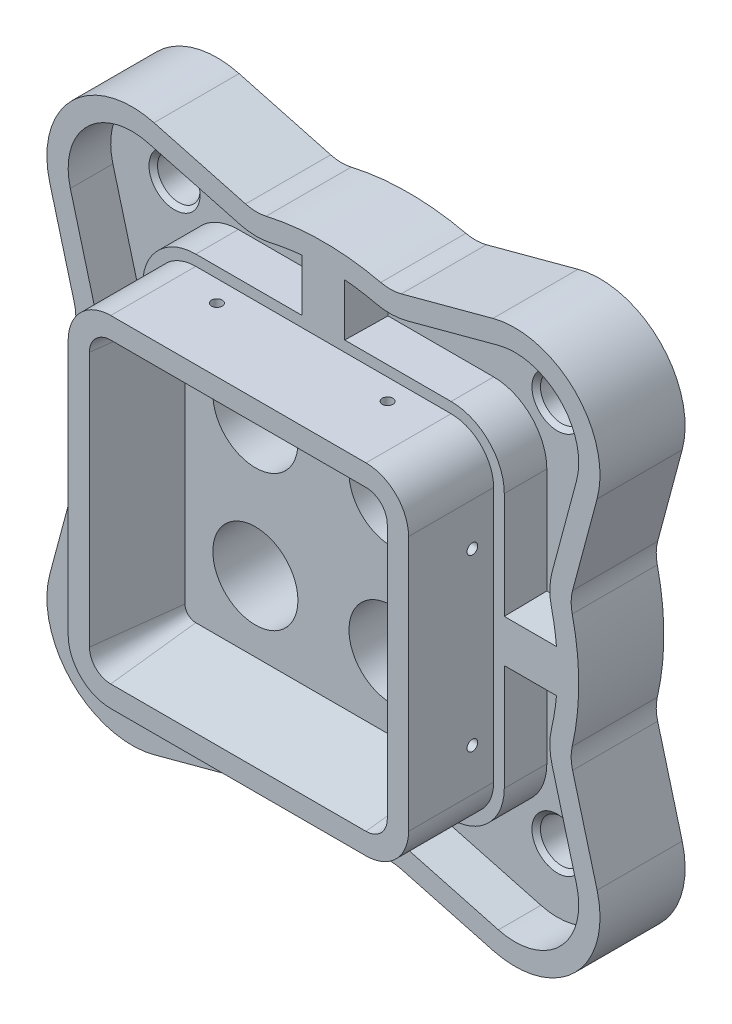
ISO-10303-21;
HEADER;
FILE_DESCRIPTION(('STEP AP214'),'2;1');
FILE_NAME('part.step','',(''),(''),'','','');
FILE_SCHEMA(('AUTOMOTIVE_DESIGN { 1 0 10303 214 1 1 1 1 }'));
ENDSEC;
DATA;
#1=APPLICATION_CONTEXT('core data for automotive mechanical design processes');
#2=APPLICATION_PROTOCOL_DEFINITION('international standard','automotive_design',2000,#1);
#3=PRODUCT_CONTEXT('',#1,'mechanical');
#4=PRODUCT('Part','Part','',(#3));
#5=PRODUCT_RELATED_PRODUCT_CATEGORY('part','',(#4));
#6=PRODUCT_DEFINITION_FORMATION('','',#4);
#7=PRODUCT_DEFINITION_CONTEXT('part definition',#1,'design');
#8=PRODUCT_DEFINITION('design','',#6,#7);
#9=PRODUCT_DEFINITION_SHAPE('','',#8);
#10=(LENGTH_UNIT() NAMED_UNIT(*) SI_UNIT(.MILLI.,.METRE.));
#11=(NAMED_UNIT(*) PLANE_ANGLE_UNIT() SI_UNIT($,.RADIAN.));
#12=(NAMED_UNIT(*) SI_UNIT($,.STERADIAN.) SOLID_ANGLE_UNIT());
#13=UNCERTAINTY_MEASURE_WITH_UNIT(LENGTH_MEASURE(1.E-05),#10,'distance_accuracy_value','');
#14=(GEOMETRIC_REPRESENTATION_CONTEXT(3) GLOBAL_UNCERTAINTY_ASSIGNED_CONTEXT((#13)) GLOBAL_UNIT_ASSIGNED_CONTEXT((#10,
#11,#12)) REPRESENTATION_CONTEXT('',''));
#15=CARTESIAN_POINT('',(0.,0.,0.));
#16=DIRECTION('',(0.,0.,1.));
#17=DIRECTION('',(1.,0.,0.));
#18=AXIS2_PLACEMENT_3D('',#15,#16,#17);
#19=CARTESIAN_POINT('',(-57.15,57.15,0.));
#20=DIRECTION('',(0.,0.,1.));
#21=DIRECTION('',(1.,0.,0.));
#22=AXIS2_PLACEMENT_3D('',#19,#20,#21);
#23=PLANE('',#22);
#24=CARTESIAN_POINT('',(-20.32,20.32,0.));
#25=DIRECTION('',(0.,0.,1.));
#26=DIRECTION('',(1.,0.,0.));
#27=AXIS2_PLACEMENT_3D('',#24,#25,#26);
#28=CIRCLE('',#27,12.7);
#29=CARTESIAN_POINT('',(-7.62000000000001,20.32,0.));
#30=VERTEX_POINT('',#29);
#31=EDGE_CURVE('E1118',#30,#30,#28,.T.);
#32=ORIENTED_EDGE('',*,*,#31,.T.);
#33=EDGE_LOOP('',(#32));
#34=FACE_BOUND('',#33,.T.);
#35=CARTESIAN_POINT('',(20.32,20.32,0.));
#36=DIRECTION('',(0.,0.,1.));
#37=DIRECTION('',(1.,0.,0.));
#38=AXIS2_PLACEMENT_3D('',#35,#36,#37);
#39=CIRCLE('',#38,12.7);
#40=CARTESIAN_POINT('',(33.02,20.32,0.));
#41=VERTEX_POINT('',#40);
#42=EDGE_CURVE('E1129',#41,#41,#39,.T.);
#43=ORIENTED_EDGE('',*,*,#42,.T.);
#44=EDGE_LOOP('',(#43));
#45=FACE_BOUND('',#44,.T.);
#46=CARTESIAN_POINT('',(20.32,-20.32,0.));
#47=DIRECTION('',(0.,0.,1.));
#48=DIRECTION('',(1.,0.,0.));
#49=AXIS2_PLACEMENT_3D('',#46,#47,#48);
#50=CIRCLE('',#49,12.7);
#51=CARTESIAN_POINT('',(33.02,-20.32,0.));
#52=VERTEX_POINT('',#51);
#53=EDGE_CURVE('E2304',#52,#52,#50,.T.);
#54=ORIENTED_EDGE('',*,*,#53,.T.);
#55=EDGE_LOOP('',(#54));
#56=FACE_BOUND('',#55,.T.);
#57=CARTESIAN_POINT('',(-20.32,-20.32,0.));
#58=DIRECTION('',(0.,0.,1.));
#59=DIRECTION('',(1.,0.,0.));
#60=AXIS2_PLACEMENT_3D('',#57,#58,#59);
#61=CIRCLE('',#60,12.7);
#62=CARTESIAN_POINT('',(-7.62,-20.32,0.));
#63=VERTEX_POINT('',#62);
#64=EDGE_CURVE('E2272',#63,#63,#61,.T.);
#65=ORIENTED_EDGE('',*,*,#64,.T.);
#66=EDGE_LOOP('',(#65));
#67=FACE_BOUND('',#66,.T.);
#68=CARTESIAN_POINT('',(0.,0.,0.));
#69=DIRECTION('',(0.,0.,-1.));
#70=DIRECTION('',(-1.,0.,0.));
#71=AXIS2_PLACEMENT_3D('',#68,#69,#70);
#72=CIRCLE('',#71,50.8);
#73=CARTESIAN_POINT('',(-50.8,0.,0.));
#74=VERTEX_POINT('',#73);
#75=EDGE_CURVE('E1835',#74,#74,#72,.T.);
#76=ORIENTED_EDGE('',*,*,#75,.T.);
#77=EDGE_LOOP('',(#76));
#78=FACE_BOUND('',#77,.T.);
#79=ADVANCED_FACE('F41',(#34,#45,#56,#67,#78),#23,.F.);
#80=CARTESIAN_POINT('',(-57.15,57.15,12.7));
#81=DIRECTION('',(0.,0.,1.));
#82=DIRECTION('',(1.,0.,0.));
#83=AXIS2_PLACEMENT_3D('',#80,#81,#82);
#84=PLANE('',#83);
#85=CARTESIAN_POINT('',(57.15,-57.15,12.7));
#86=DIRECTION('',(0.,0.,1.));
#87=DIRECTION('',(1.,0.,0.));
#88=AXIS2_PLACEMENT_3D('',#85,#86,#87);
#89=CIRCLE('',#88,7.62000000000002);
#90=CARTESIAN_POINT('',(64.77,-57.15,12.7));
#91=VERTEX_POINT('',#90);
#92=EDGE_CURVE('E3543',#91,#91,#89,.F.);
#93=ORIENTED_EDGE('',*,*,#92,.T.);
#94=EDGE_LOOP('',(#93));
#95=FACE_BOUND('',#94,.T.);
#96=DIRECTION('',(0.,-1.,0.));
#97=VECTOR('',#96,1.);
#98=CARTESIAN_POINT('',(6.5716793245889,-50.7999999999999,12.7));
#99=LINE('',#98,#97);
#100=CARTESIAN_POINT('',(6.57167932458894,-53.975,12.7));
#101=VERTEX_POINT('',#100);
#102=CARTESIAN_POINT('',(6.5716793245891,-69.5401720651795,12.7));
#103=VERTEX_POINT('',#102);
#104=EDGE_CURVE('E835',#101,#103,#99,.T.);
#105=ORIENTED_EDGE('',*,*,#104,.T.);
#106=CARTESIAN_POINT('',(0.,0.,12.7));
#107=DIRECTION('',(0.,0.,1.));
#108=DIRECTION('',(1.,0.,0.));
#109=AXIS2_PLACEMENT_3D('',#106,#107,#108);
#110=CIRCLE('',#109,69.85);
#111=CARTESIAN_POINT('',(15.6849149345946,-68.06618796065,12.7));
#112=VERTEX_POINT('',#111);
#113=EDGE_CURVE('E2086',#103,#112,#110,.T.);
#114=ORIENTED_EDGE('',*,*,#113,.T.);
#115=CARTESIAN_POINT('',(19.9626190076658,-86.6296937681,12.7));
#116=DIRECTION('',(0.,0.,-1.));
#117=DIRECTION('',(1.,0.,0.));
#118=AXIS2_PLACEMENT_3D('',#115,#116,#117);
#119=CIRCLE('',#118,19.05);
#120=CARTESIAN_POINT('',(24.8931218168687,-68.2288067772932,12.7));
#121=VERTEX_POINT('',#120);
#122=EDGE_CURVE('E2108',#112,#121,#119,.T.);
#123=ORIENTED_EDGE('',*,*,#122,.T.);
#124=DIRECTION('',(0.96592582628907,-0.258819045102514,0.));
#125=VECTOR('',#124,1.);
#126=CARTESIAN_POINT('',(24.8931218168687,-68.2288067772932,12.7));
#127=LINE('',#126,#125);
#128=CARTESIAN_POINT('',(52.2194971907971,-75.5508869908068,12.7));
#129=VERTEX_POINT('',#128);
#130=EDGE_CURVE('E2111',#121,#129,#127,.T.);
#131=ORIENTED_EDGE('',*,*,#130,.T.);
#132=CARTESIAN_POINT('',(57.15,-57.15,12.7));
#133=DIRECTION('',(0.,0.,1.));
#134=DIRECTION('',(1.,0.,0.));
#135=AXIS2_PLACEMENT_3D('',#132,#133,#134);
#136=CIRCLE('',#135,19.05);
#137=CARTESIAN_POINT('',(75.5508869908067,-52.2194971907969,12.7));
#138=VERTEX_POINT('',#137);
#139=EDGE_CURVE('E2115',#129,#138,#136,.T.);
#140=ORIENTED_EDGE('',*,*,#139,.T.);
#141=DIRECTION('',(-0.258819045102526,0.965925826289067,0.));
#142=VECTOR('',#141,1.);
#143=CARTESIAN_POINT('',(75.5508869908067,-52.2194971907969,12.7));
#144=LINE('',#143,#142);
#145=CARTESIAN_POINT('',(68.2288067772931,-24.8931218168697,12.7));
#146=VERTEX_POINT('',#145);
#147=EDGE_CURVE('E2119',#138,#146,#144,.T.);
#148=ORIENTED_EDGE('',*,*,#147,.T.);
#149=CARTESIAN_POINT('',(86.6296937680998,-19.9626190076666,12.7));
#150=DIRECTION('',(0.,0.,-1.));
#151=DIRECTION('',(1.,0.,0.));
#152=AXIS2_PLACEMENT_3D('',#149,#150,#151);
#153=CIRCLE('',#152,19.05);
#154=CARTESIAN_POINT('',(68.0661879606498,-15.6849149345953,12.7));
#155=VERTEX_POINT('',#154);
#156=EDGE_CURVE('E2138',#146,#155,#153,.T.);
#157=ORIENTED_EDGE('',*,*,#156,.T.);
#158=CARTESIAN_POINT('',(0.,0.,12.7));
#159=DIRECTION('',(0.,0.,1.));
#160=DIRECTION('',(1.,0.,0.));
#161=AXIS2_PLACEMENT_3D('',#158,#159,#160);
#162=CIRCLE('',#161,69.85);
#163=CARTESIAN_POINT('',(69.5401720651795,-6.57167932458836,12.7));
#164=VERTEX_POINT('',#163);
#165=EDGE_CURVE('E2144',#155,#164,#162,.T.);
#166=ORIENTED_EDGE('',*,*,#165,.T.);
#167=DIRECTION('',(-1.,0.,0.));
#168=VECTOR('',#167,1.);
#169=CARTESIAN_POINT('',(50.8,-6.57167932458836,12.7));
#170=LINE('',#169,#168);
#171=CARTESIAN_POINT('',(53.975,-6.57167932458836,12.7));
#172=VERTEX_POINT('',#171);
#173=EDGE_CURVE('E776',#164,#172,#170,.T.);
#174=ORIENTED_EDGE('',*,*,#173,.T.);
#175=DIRECTION('',(0.,1.,0.));
#176=VECTOR('',#175,1.);
#177=CARTESIAN_POINT('',(53.975,-38.0999999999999,12.7));
#178=LINE('',#177,#176);
#179=CARTESIAN_POINT('',(53.975,-38.0999999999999,12.7));
#180=VERTEX_POINT('',#179);
#181=EDGE_CURVE('E669',#180,#172,#178,.T.);
#182=ORIENTED_EDGE('',*,*,#181,.F.);
#183=CARTESIAN_POINT('',(38.1,-38.1,12.7));
#184=DIRECTION('',(0.,0.,1.));
#185=DIRECTION('',(1.,0.,0.));
#186=AXIS2_PLACEMENT_3D('',#183,#184,#185);
#187=CIRCLE('',#186,15.875);
#188=CARTESIAN_POINT('',(38.0999999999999,-53.975,12.7));
#189=VERTEX_POINT('',#188);
#190=EDGE_CURVE('E674',#189,#180,#187,.T.);
#191=ORIENTED_EDGE('',*,*,#190,.F.);
#192=DIRECTION('',(1.,0.,0.));
#193=VECTOR('',#192,1.);
#194=CARTESIAN_POINT('',(-38.0999999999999,-53.975,12.7));
#195=LINE('',#194,#193);
#196=EDGE_CURVE('E1972',#101,#189,#195,.T.);
#197=ORIENTED_EDGE('',*,*,#196,.F.);
#198=EDGE_LOOP('',(#105,#114,#123,#131,#140,#148,#157,#166,#174,#182,#191,#197));
#199=FACE_BOUND('',#198,.T.);
#200=ADVANCED_FACE('F1175',(#95,#199),#84,.T.);
#201=CARTESIAN_POINT('',(0.,0.,12.7));
#202=DIRECTION('',(0.,0.,1.));
#203=DIRECTION('',(1.,0.,0.));
#204=AXIS2_PLACEMENT_3D('',#201,#202,#203);
#205=CYLINDRICAL_SURFACE('',#204,69.85);
#206=ORIENTED_EDGE('',*,*,#113,.F.);
#207=CARTESIAN_POINT('',(0.,0.,389.191256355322));
#208=DIRECTION('',(0.999847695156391,0.,0.0174524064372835));
#209=DIRECTION('',(-0.0174524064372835,0.,0.999847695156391));
#210=AXIS2_PLACEMENT_3D('',#207,#208,#209);
#211=ELLIPSE('',#210,4002.31339162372,69.85);
#212=CARTESIAN_POINT('',(6.35000000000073,-69.560764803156,25.4));
#213=VERTEX_POINT('',#212);
#214=EDGE_CURVE('E790',#103,#213,#211,.F.);
#215=ORIENTED_EDGE('',*,*,#214,.T.);
#216=CARTESIAN_POINT('',(0.,0.,25.4));
#217=DIRECTION('',(0.,0.,1.));
#218=DIRECTION('',(1.,0.,0.));
#219=AXIS2_PLACEMENT_3D('',#216,#217,#218);
#220=CIRCLE('',#219,69.85);
#221=CARTESIAN_POINT('',(15.6849149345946,-68.06618796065,25.4));
#222=VERTEX_POINT('',#221);
#223=EDGE_CURVE('E1858',#213,#222,#220,.T.);
#224=ORIENTED_EDGE('',*,*,#223,.T.);
#225=DIRECTION('',(0.,0.,1.));
#226=VECTOR('',#225,1.);
#227=CARTESIAN_POINT('',(15.6849149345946,-68.06618796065,12.7));
#228=LINE('',#227,#226);
#229=EDGE_CURVE('E2094',#112,#222,#228,.T.);
#230=ORIENTED_EDGE('',*,*,#229,.F.);
#231=EDGE_LOOP('',(#206,#215,#224,#230));
#232=FACE_BOUND('',#231,.T.);
#233=ADVANCED_FACE('F1182',(#232),#205,.F.);
#234=CARTESIAN_POINT('',(-38.0999999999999,-53.975,12.7));
#235=DIRECTION('',(0.,-1.,0.));
#236=DIRECTION('',(0.,0.,-1.));
#237=AXIS2_PLACEMENT_3D('',#234,#235,#236);
#238=PLANE('',#237);
#239=DIRECTION('',(-0.0174524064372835,0.,0.999847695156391));
#240=VECTOR('',#239,1.);
#241=CARTESIAN_POINT('',(6.55807293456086,-53.975,13.4795095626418));
#242=LINE('',#241,#240);
#243=CARTESIAN_POINT('',(6.3500000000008,-53.975,25.4));
#244=VERTEX_POINT('',#243);
#245=EDGE_CURVE('E805',#101,#244,#242,.T.);
#246=ORIENTED_EDGE('',*,*,#245,.F.);
#247=ORIENTED_EDGE('',*,*,#196,.T.);
#248=DIRECTION('',(0.,0.,1.));
#249=VECTOR('',#248,1.);
#250=CARTESIAN_POINT('',(38.0999999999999,-53.975,12.7));
#251=LINE('',#250,#249);
#252=CARTESIAN_POINT('',(38.0999999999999,-53.975,25.4));
#253=VERTEX_POINT('',#252);
#254=EDGE_CURVE('E1978',#189,#253,#251,.T.);
#255=ORIENTED_EDGE('',*,*,#254,.T.);
#256=DIRECTION('',(1.,0.,0.));
#257=VECTOR('',#256,1.);
#258=CARTESIAN_POINT('',(-38.0999999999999,-53.975,25.4));
#259=LINE('',#258,#257);
#260=EDGE_CURVE('E2026',#244,#253,#259,.T.);
#261=ORIENTED_EDGE('',*,*,#260,.F.);
#262=EDGE_LOOP('',(#246,#247,#255,#261));
#263=FACE_BOUND('',#262,.T.);
#264=ADVANCED_FACE('F2429',(#263),#238,.T.);
#265=CARTESIAN_POINT('',(-57.15,-57.15,12.7));
#266=DIRECTION('',(0.,0.,1.));
#267=DIRECTION('',(1.,0.,0.));
#268=AXIS2_PLACEMENT_3D('',#265,#266,#267);
#269=CIRCLE('',#268,7.62000000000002);
#270=CARTESIAN_POINT('',(-49.53,-57.15,12.7));
#271=VERTEX_POINT('',#270);
#272=EDGE_CURVE('E1741',#271,#271,#269,.F.);
#273=ORIENTED_EDGE('',*,*,#272,.T.);
#274=EDGE_LOOP('',(#273));
#275=FACE_BOUND('',#274,.T.);
#276=DIRECTION('',(0.,1.,0.));
#277=VECTOR('',#276,1.);
#278=CARTESIAN_POINT('',(-6.57167932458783,-50.8000000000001,12.7));
#279=LINE('',#278,#277);
#280=CARTESIAN_POINT('',(-6.57167932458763,-69.5401720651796,12.7));
#281=VERTEX_POINT('',#280);
#282=CARTESIAN_POINT('',(-6.57167932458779,-53.975,12.7));
#283=VERTEX_POINT('',#282);
#284=EDGE_CURVE('E807',#281,#283,#279,.T.);
#285=ORIENTED_EDGE('',*,*,#284,.T.);
#286=CARTESIAN_POINT('',(-38.0999999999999,-53.975,12.7));
#287=VERTEX_POINT('',#286);
#288=EDGE_CURVE('E1963',#287,#283,#195,.T.);
#289=ORIENTED_EDGE('',*,*,#288,.F.);
#290=CARTESIAN_POINT('',(-38.1,-38.1,12.7));
#291=DIRECTION('',(0.,0.,1.));
#292=DIRECTION('',(1.,0.,0.));
#293=AXIS2_PLACEMENT_3D('',#290,#291,#292);
#294=CIRCLE('',#293,15.875);
#295=CARTESIAN_POINT('',(-53.975,-38.0999999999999,12.7));
#296=VERTEX_POINT('',#295);
#297=EDGE_CURVE('E1974',#296,#287,#294,.T.);
#298=ORIENTED_EDGE('',*,*,#297,.F.);
#299=DIRECTION('',(0.,-1.,0.));
#300=VECTOR('',#299,1.);
#301=CARTESIAN_POINT('',(-53.975,38.0999999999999,12.7));
#302=LINE('',#301,#300);
#303=CARTESIAN_POINT('',(-53.975,-6.57167932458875,12.7));
#304=VERTEX_POINT('',#303);
#305=EDGE_CURVE('E2023',#304,#296,#302,.T.);
#306=ORIENTED_EDGE('',*,*,#305,.F.);
#307=DIRECTION('',(-1.,0.,0.));
#308=VECTOR('',#307,1.);
#309=CARTESIAN_POINT('',(-50.8,-6.57167932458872,12.7));
#310=LINE('',#309,#308);
#311=CARTESIAN_POINT('',(-69.5401720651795,-6.57167932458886,12.7));
#312=VERTEX_POINT('',#311);
#313=EDGE_CURVE('E816',#304,#312,#310,.T.);
#314=ORIENTED_EDGE('',*,*,#313,.T.);
#315=CARTESIAN_POINT('',(0.,0.,12.7));
#316=DIRECTION('',(0.,0.,1.));
#317=DIRECTION('',(1.,0.,0.));
#318=AXIS2_PLACEMENT_3D('',#315,#316,#317);
#319=CIRCLE('',#318,69.85);
#320=CARTESIAN_POINT('',(-68.0661879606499,-15.6849149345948,12.7));
#321=VERTEX_POINT('',#320);
#322=EDGE_CURVE('E1932',#312,#321,#319,.T.);
#323=ORIENTED_EDGE('',*,*,#322,.T.);
#324=CARTESIAN_POINT('',(-86.6296937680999,-19.9626190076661,12.7));
#325=DIRECTION('',(0.,0.,-1.));
#326=DIRECTION('',(1.,0.,0.));
#327=AXIS2_PLACEMENT_3D('',#324,#325,#326);
#328=CIRCLE('',#327,19.05);
#329=CARTESIAN_POINT('',(-68.2288067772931,-24.8931218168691,12.7));
#330=VERTEX_POINT('',#329);
#331=EDGE_CURVE('E1939',#321,#330,#328,.T.);
#332=ORIENTED_EDGE('',*,*,#331,.T.);
#333=DIRECTION('',(-0.258819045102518,-0.965925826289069,0.));
#334=VECTOR('',#333,1.);
#335=CARTESIAN_POINT('',(-68.2288067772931,-24.8931218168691,12.7));
#336=LINE('',#335,#334);
#337=CARTESIAN_POINT('',(-75.5508869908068,-52.219497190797,12.7));
#338=VERTEX_POINT('',#337);
#339=EDGE_CURVE('E2053',#330,#338,#336,.T.);
#340=ORIENTED_EDGE('',*,*,#339,.T.);
#341=CARTESIAN_POINT('',(-57.15,-57.15,12.7));
#342=DIRECTION('',(0.,0.,1.));
#343=DIRECTION('',(1.,0.,0.));
#344=AXIS2_PLACEMENT_3D('',#341,#342,#343);
#345=CIRCLE('',#344,19.05);
#346=CARTESIAN_POINT('',(-52.2194971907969,-75.5508869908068,12.7));
#347=VERTEX_POINT('',#346);
#348=EDGE_CURVE('E2056',#338,#347,#345,.T.);
#349=ORIENTED_EDGE('',*,*,#348,.T.);
#350=DIRECTION('',(0.965925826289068,0.258819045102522,0.));
#351=VECTOR('',#350,1.);
#352=CARTESIAN_POINT('',(-52.2194971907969,-75.5508869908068,12.7));
#353=LINE('',#352,#351);
#354=CARTESIAN_POINT('',(-24.8931218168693,-68.2288067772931,12.7));
#355=VERTEX_POINT('',#354);
#356=EDGE_CURVE('E2059',#347,#355,#353,.T.);
#357=ORIENTED_EDGE('',*,*,#356,.T.);
#358=CARTESIAN_POINT('',(-19.9626190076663,-86.6296937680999,12.7));
#359=DIRECTION('',(0.,0.,-1.));
#360=DIRECTION('',(1.,0.,0.));
#361=AXIS2_PLACEMENT_3D('',#358,#359,#360);
#362=CIRCLE('',#361,19.05);
#363=CARTESIAN_POINT('',(-15.684914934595,-68.0661879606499,12.7));
#364=VERTEX_POINT('',#363);
#365=EDGE_CURVE('E2084',#355,#364,#362,.T.);
#366=ORIENTED_EDGE('',*,*,#365,.T.);
#367=EDGE_CURVE('E1966',#364,#281,#110,.T.);
#368=ORIENTED_EDGE('',*,*,#367,.T.);
#369=EDGE_LOOP('',(#285,#289,#298,#306,#314,#323,#332,#340,#349,#357,#366,#368));
#370=FACE_BOUND('',#369,.T.);
#371=ADVANCED_FACE('F1185',(#275,#370),#84,.T.);
#372=CARTESIAN_POINT('',(0.,0.,12.7));
#373=DIRECTION('',(0.,0.,1.));
#374=DIRECTION('',(1.,0.,0.));
#375=AXIS2_PLACEMENT_3D('',#372,#373,#374);
#376=CYLINDRICAL_SURFACE('',#375,69.85);
#377=ORIENTED_EDGE('',*,*,#322,.F.);
#378=CARTESIAN_POINT('',(0.,0.,389.191256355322));
#379=DIRECTION('',(0.,-0.999847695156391,0.0174524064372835));
#380=DIRECTION('',(0.,0.0174524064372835,0.999847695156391));
#381=AXIS2_PLACEMENT_3D('',#378,#379,#380);
#382=ELLIPSE('',#381,4002.31339162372,69.85);
#383=CARTESIAN_POINT('',(-69.560764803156,-6.35000000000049,25.4));
#384=VERTEX_POINT('',#383);
#385=EDGE_CURVE('E810',#312,#384,#382,.F.);
#386=ORIENTED_EDGE('',*,*,#385,.T.);
#387=CARTESIAN_POINT('',(0.,0.,25.4));
#388=DIRECTION('',(0.,0.,1.));
#389=DIRECTION('',(1.,0.,0.));
#390=AXIS2_PLACEMENT_3D('',#387,#388,#389);
#391=CIRCLE('',#390,69.85);
#392=CARTESIAN_POINT('',(-68.0661879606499,-15.6849149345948,25.4));
#393=VERTEX_POINT('',#392);
#394=EDGE_CURVE('E1895',#384,#393,#391,.T.);
#395=ORIENTED_EDGE('',*,*,#394,.T.);
#396=DIRECTION('',(0.,0.,1.));
#397=VECTOR('',#396,1.);
#398=CARTESIAN_POINT('',(-68.0661879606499,-15.6849149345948,12.7));
#399=LINE('',#398,#397);
#400=EDGE_CURVE('E1907',#321,#393,#399,.T.);
#401=ORIENTED_EDGE('',*,*,#400,.F.);
#402=EDGE_LOOP('',(#377,#386,#395,#401));
#403=FACE_BOUND('',#402,.T.);
#404=ADVANCED_FACE('F2231',(#403),#376,.F.);
#405=CARTESIAN_POINT('',(-53.975,38.0999999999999,12.7));
#406=DIRECTION('',(-1.,0.,0.));
#407=DIRECTION('',(0.,-1.,0.));
#408=AXIS2_PLACEMENT_3D('',#405,#406,#407);
#409=PLANE('',#408);
#410=DIRECTION('',(0.,0.0174524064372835,0.999847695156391));
#411=VECTOR('',#410,1.);
#412=CARTESIAN_POINT('',(-53.975,-6.55807293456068,13.4795095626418));
#413=LINE('',#412,#411);
#414=CARTESIAN_POINT('',(-53.975,-6.35000000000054,25.4));
#415=VERTEX_POINT('',#414);
#416=EDGE_CURVE('E806',#304,#415,#413,.T.);
#417=ORIENTED_EDGE('',*,*,#416,.F.);
#418=ORIENTED_EDGE('',*,*,#305,.T.);
#419=DIRECTION('',(0.,0.,1.));
#420=VECTOR('',#419,1.);
#421=CARTESIAN_POINT('',(-53.975,-38.0999999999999,12.7));
#422=LINE('',#421,#420);
#423=CARTESIAN_POINT('',(-53.975,-38.0999999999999,25.4));
#424=VERTEX_POINT('',#423);
#425=EDGE_CURVE('E1994',#296,#424,#422,.T.);
#426=ORIENTED_EDGE('',*,*,#425,.T.);
#427=DIRECTION('',(0.,-1.,0.));
#428=VECTOR('',#427,1.);
#429=CARTESIAN_POINT('',(-53.975,38.0999999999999,25.4));
#430=LINE('',#429,#428);
#431=EDGE_CURVE('E1993',#415,#424,#430,.T.);
#432=ORIENTED_EDGE('',*,*,#431,.F.);
#433=EDGE_LOOP('',(#417,#418,#426,#432));
#434=FACE_BOUND('',#433,.T.);
#435=ADVANCED_FACE('F2021',(#434),#409,.T.);
#436=CARTESIAN_POINT('',(0.,0.,12.7));
#437=DIRECTION('',(0.,0.,1.));
#438=DIRECTION('',(1.,0.,0.));
#439=AXIS2_PLACEMENT_3D('',#436,#437,#438);
#440=CYLINDRICAL_SURFACE('',#439,69.85);
#441=CARTESIAN_POINT('',(0.,0.,12.7));
#442=DIRECTION('',(0.,0.,1.));
#443=DIRECTION('',(1.,0.,0.));
#444=AXIS2_PLACEMENT_3D('',#441,#442,#443);
#445=CIRCLE('',#444,69.85);
#446=CARTESIAN_POINT('',(-6.57167932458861,69.5401720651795,12.7));
#447=VERTEX_POINT('',#446);
#448=CARTESIAN_POINT('',(-15.6849149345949,68.0661879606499,12.7));
#449=VERTEX_POINT('',#448);
#450=EDGE_CURVE('E720',#447,#449,#445,.T.);
#451=ORIENTED_EDGE('',*,*,#450,.F.);
#452=CARTESIAN_POINT('',(0.,0.,389.191256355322));
#453=DIRECTION('',(-0.999847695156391,0.,0.0174524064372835));
#454=DIRECTION('',(0.0174524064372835,0.,0.999847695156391));
#455=AXIS2_PLACEMENT_3D('',#452,#453,#454);
#456=ELLIPSE('',#455,4002.31339162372,69.85);
#457=CARTESIAN_POINT('',(-6.35000000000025,69.560764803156,25.4));
#458=VERTEX_POINT('',#457);
#459=EDGE_CURVE('E742',#447,#458,#456,.F.);
#460=ORIENTED_EDGE('',*,*,#459,.T.);
#461=CARTESIAN_POINT('',(0.,0.,25.4));
#462=DIRECTION('',(0.,0.,1.));
#463=DIRECTION('',(1.,0.,0.));
#464=AXIS2_PLACEMENT_3D('',#461,#462,#463);
#465=CIRCLE('',#464,69.85);
#466=CARTESIAN_POINT('',(-15.6849149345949,68.0661879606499,25.4));
#467=VERTEX_POINT('',#466);
#468=EDGE_CURVE('E589',#458,#467,#465,.T.);
#469=ORIENTED_EDGE('',*,*,#468,.T.);
#470=DIRECTION('',(0.,0.,1.));
#471=VECTOR('',#470,1.);
#472=CARTESIAN_POINT('',(-15.6849149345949,68.0661879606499,12.7));
#473=LINE('',#472,#471);
#474=EDGE_CURVE('E694',#449,#467,#473,.T.);
#475=ORIENTED_EDGE('',*,*,#474,.F.);
#476=EDGE_LOOP('',(#451,#460,#469,#475));
#477=FACE_BOUND('',#476,.T.);
#478=ADVANCED_FACE('F2417',(#477),#440,.F.);
#479=CARTESIAN_POINT('',(-57.15,57.15,12.7));
#480=DIRECTION('',(0.,0.,1.));
#481=DIRECTION('',(1.,0.,0.));
#482=AXIS2_PLACEMENT_3D('',#479,#480,#481);
#483=CIRCLE('',#482,7.62000000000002);
#484=CARTESIAN_POINT('',(-49.53,57.15,12.7));
#485=VERTEX_POINT('',#484);
#486=EDGE_CURVE('E3524',#485,#485,#483,.F.);
#487=ORIENTED_EDGE('',*,*,#486,.T.);
#488=EDGE_LOOP('',(#487));
#489=FACE_BOUND('',#488,.T.);
#490=DIRECTION('',(1.,0.,0.));
#491=VECTOR('',#490,1.);
#492=CARTESIAN_POINT('',(-50.8,6.571679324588,12.7));
#493=LINE('',#492,#491);
#494=CARTESIAN_POINT('',(-69.5401720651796,6.57167932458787,12.7));
#495=VERTEX_POINT('',#494);
#496=CARTESIAN_POINT('',(-53.975,6.57167932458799,12.7));
#497=VERTEX_POINT('',#496);
#498=EDGE_CURVE('E820',#495,#497,#493,.T.);
#499=ORIENTED_EDGE('',*,*,#498,.T.);
#500=CARTESIAN_POINT('',(-53.975,38.0999999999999,12.7));
#501=VERTEX_POINT('',#500);
#502=EDGE_CURVE('E1983',#501,#497,#302,.T.);
#503=ORIENTED_EDGE('',*,*,#502,.F.);
#504=CARTESIAN_POINT('',(-38.1,38.1,12.7));
#505=DIRECTION('',(0.,0.,1.));
#506=DIRECTION('',(1.,0.,0.));
#507=AXIS2_PLACEMENT_3D('',#504,#505,#506);
#508=CIRCLE('',#507,15.875);
#509=CARTESIAN_POINT('',(-38.0999999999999,53.975,12.7));
#510=VERTEX_POINT('',#509);
#511=EDGE_CURVE('E684',#510,#501,#508,.T.);
#512=ORIENTED_EDGE('',*,*,#511,.F.);
#513=DIRECTION('',(-1.,0.,0.));
#514=VECTOR('',#513,1.);
#515=CARTESIAN_POINT('',(38.0999999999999,53.975,12.7));
#516=LINE('',#515,#514);
#517=CARTESIAN_POINT('',(-6.57167932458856,53.975,12.7));
#518=VERTEX_POINT('',#517);
#519=EDGE_CURVE('E680',#518,#510,#516,.T.);
#520=ORIENTED_EDGE('',*,*,#519,.F.);
#521=DIRECTION('',(0.,1.,0.));
#522=VECTOR('',#521,1.);
#523=CARTESIAN_POINT('',(-6.57167932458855,50.8,12.7));
#524=LINE('',#523,#522);
#525=EDGE_CURVE('E592',#518,#447,#524,.T.);
#526=ORIENTED_EDGE('',*,*,#525,.T.);
#527=ORIENTED_EDGE('',*,*,#450,.T.);
#528=CARTESIAN_POINT('',(-19.9626190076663,86.6296937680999,12.7));
#529=DIRECTION('',(0.,0.,-1.));
#530=DIRECTION('',(1.,0.,0.));
#531=AXIS2_PLACEMENT_3D('',#528,#529,#530);
#532=CIRCLE('',#531,19.05);
#533=CARTESIAN_POINT('',(-24.8931218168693,68.2288067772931,12.7));
#534=VERTEX_POINT('',#533);
#535=EDGE_CURVE('E727',#449,#534,#532,.T.);
#536=ORIENTED_EDGE('',*,*,#535,.T.);
#537=DIRECTION('',(-0.965925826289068,0.258819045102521,0.));
#538=VECTOR('',#537,1.);
#539=CARTESIAN_POINT('',(-24.8931218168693,68.2288067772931,12.7));
#540=LINE('',#539,#538);
#541=CARTESIAN_POINT('',(-52.219497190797,75.5508869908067,12.7));
#542=VERTEX_POINT('',#541);
#543=EDGE_CURVE('E2247',#534,#542,#540,.T.);
#544=ORIENTED_EDGE('',*,*,#543,.T.);
#545=CARTESIAN_POINT('',(-57.15,57.15,12.7));
#546=DIRECTION('',(0.,0.,1.));
#547=DIRECTION('',(1.,0.,0.));
#548=AXIS2_PLACEMENT_3D('',#545,#546,#547);
#549=CIRCLE('',#548,19.05);
#550=CARTESIAN_POINT('',(-75.5508869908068,52.219497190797,12.7));
#551=VERTEX_POINT('',#550);
#552=EDGE_CURVE('E1984',#542,#551,#549,.T.);
#553=ORIENTED_EDGE('',*,*,#552,.T.);
#554=DIRECTION('',(0.258819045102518,-0.965925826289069,0.));
#555=VECTOR('',#554,1.);
#556=CARTESIAN_POINT('',(-75.5508869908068,52.219497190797,12.7));
#557=LINE('',#556,#555);
#558=CARTESIAN_POINT('',(-68.2288067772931,24.8931218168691,12.7));
#559=VERTEX_POINT('',#558);
#560=EDGE_CURVE('E1933',#551,#559,#557,.T.);
#561=ORIENTED_EDGE('',*,*,#560,.T.);
#562=CARTESIAN_POINT('',(-86.6296937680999,19.9626190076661,12.7));
#563=DIRECTION('',(0.,0.,-1.));
#564=DIRECTION('',(1.,0.,0.));
#565=AXIS2_PLACEMENT_3D('',#562,#563,#564);
#566=CIRCLE('',#565,19.05);
#567=CARTESIAN_POINT('',(-68.0661879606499,15.6849149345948,12.7));
#568=VERTEX_POINT('',#567);
#569=EDGE_CURVE('E1928',#559,#568,#566,.T.);
#570=ORIENTED_EDGE('',*,*,#569,.T.);
#571=EDGE_CURVE('E1938',#568,#495,#319,.T.);
#572=ORIENTED_EDGE('',*,*,#571,.T.);
#573=EDGE_LOOP('',(#499,#503,#512,#520,#526,#527,#536,#544,#553,#561,#570,#572));
#574=FACE_BOUND('',#573,.T.);
#575=ADVANCED_FACE('F2049',(#489,#574),#84,.T.);
#576=CARTESIAN_POINT('',(38.0999999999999,53.975,12.7));
#577=DIRECTION('',(0.,1.,0.));
#578=DIRECTION('',(0.,0.,1.));
#579=AXIS2_PLACEMENT_3D('',#576,#577,#578);
#580=PLANE('',#579);
#581=DIRECTION('',(0.0174524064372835,0.,0.999847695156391));
#582=VECTOR('',#581,1.);
#583=CARTESIAN_POINT('',(-6.55807293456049,53.975,13.4795095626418));
#584=LINE('',#583,#582);
#585=CARTESIAN_POINT('',(-6.35000000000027,53.975,25.4));
#586=VERTEX_POINT('',#585);
#587=EDGE_CURVE('E595',#518,#586,#584,.T.);
#588=ORIENTED_EDGE('',*,*,#587,.F.);
#589=ORIENTED_EDGE('',*,*,#519,.T.);
#590=DIRECTION('',(0.,0.,1.));
#591=VECTOR('',#590,1.);
#592=CARTESIAN_POINT('',(-38.0999999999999,53.975,12.7));
#593=LINE('',#592,#591);
#594=CARTESIAN_POINT('',(-38.0999999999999,53.975,25.4));
#595=VERTEX_POINT('',#594);
#596=EDGE_CURVE('E604',#510,#595,#593,.T.);
#597=ORIENTED_EDGE('',*,*,#596,.T.);
#598=DIRECTION('',(-1.,0.,0.));
#599=VECTOR('',#598,1.);
#600=CARTESIAN_POINT('',(38.0999999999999,53.975,25.4));
#601=LINE('',#600,#599);
#602=EDGE_CURVE('E586',#586,#595,#601,.T.);
#603=ORIENTED_EDGE('',*,*,#602,.F.);
#604=EDGE_LOOP('',(#588,#589,#597,#603));
#605=FACE_BOUND('',#604,.T.);
#606=ADVANCED_FACE('F602',(#605),#580,.T.);
#607=CARTESIAN_POINT('',(0.,0.,12.7));
#608=DIRECTION('',(0.,0.,1.));
#609=DIRECTION('',(1.,0.,0.));
#610=AXIS2_PLACEMENT_3D('',#607,#608,#609);
#611=CYLINDRICAL_SURFACE('',#610,69.85);
#612=CARTESIAN_POINT('',(69.5401720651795,6.57167932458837,12.7));
#613=VERTEX_POINT('',#612);
#614=CARTESIAN_POINT('',(68.0661879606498,15.6849149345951,12.7));
#615=VERTEX_POINT('',#614);
#616=EDGE_CURVE('E2141',#613,#615,#162,.T.);
#617=ORIENTED_EDGE('',*,*,#616,.F.);
#618=CARTESIAN_POINT('',(0.,0.,389.191256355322));
#619=DIRECTION('',(0.,0.999847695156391,0.0174524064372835));
#620=DIRECTION('',(0.,-0.0174524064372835,0.999847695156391));
#621=AXIS2_PLACEMENT_3D('',#618,#619,#620);
#622=ELLIPSE('',#621,4002.31339162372,69.85);
#623=CARTESIAN_POINT('',(69.5607648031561,6.35000000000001,25.4));
#624=VERTEX_POINT('',#623);
#625=EDGE_CURVE('E782',#613,#624,#622,.F.);
#626=ORIENTED_EDGE('',*,*,#625,.T.);
#627=CARTESIAN_POINT('',(0.,0.,25.4));
#628=DIRECTION('',(0.,0.,1.));
#629=DIRECTION('',(1.,0.,0.));
#630=AXIS2_PLACEMENT_3D('',#627,#628,#629);
#631=CIRCLE('',#630,69.85);
#632=CARTESIAN_POINT('',(68.0661879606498,15.6849149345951,25.4));
#633=VERTEX_POINT('',#632);
#634=EDGE_CURVE('E2169',#624,#633,#631,.T.);
#635=ORIENTED_EDGE('',*,*,#634,.T.);
#636=DIRECTION('',(0.,0.,1.));
#637=VECTOR('',#636,1.);
#638=CARTESIAN_POINT('',(68.0661879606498,15.6849149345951,12.7));
#639=LINE('',#638,#637);
#640=EDGE_CURVE('E2158',#615,#633,#639,.T.);
#641=ORIENTED_EDGE('',*,*,#640,.F.);
#642=EDGE_LOOP('',(#617,#626,#635,#641));
#643=FACE_BOUND('',#642,.T.);
#644=ADVANCED_FACE('F2393',(#643),#611,.F.);
#645=CARTESIAN_POINT('',(53.975,-38.0999999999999,12.7));
#646=DIRECTION('',(1.,0.,0.));
#647=DIRECTION('',(0.,1.,0.));
#648=AXIS2_PLACEMENT_3D('',#645,#646,#647);
#649=PLANE('',#648);
#650=DIRECTION('',(0.,-0.0174524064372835,0.999847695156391));
#651=VECTOR('',#650,1.);
#652=CARTESIAN_POINT('',(53.975,6.5580729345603,13.4795095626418));
#653=LINE('',#652,#651);
#654=CARTESIAN_POINT('',(53.975,6.57167932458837,12.7));
#655=VERTEX_POINT('',#654);
#656=CARTESIAN_POINT('',(53.975,6.35000000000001,25.4));
#657=VERTEX_POINT('',#656);
#658=EDGE_CURVE('E777',#655,#657,#653,.T.);
#659=ORIENTED_EDGE('',*,*,#658,.F.);
#660=CARTESIAN_POINT('',(53.975,38.0999999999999,12.7));
#661=VERTEX_POINT('',#660);
#662=EDGE_CURVE('E673',#655,#661,#178,.T.);
#663=ORIENTED_EDGE('',*,*,#662,.T.);
#664=DIRECTION('',(0.,0.,1.));
#665=VECTOR('',#664,1.);
#666=CARTESIAN_POINT('',(53.975,38.0999999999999,12.7));
#667=LINE('',#666,#665);
#668=CARTESIAN_POINT('',(53.975,38.0999999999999,25.4));
#669=VERTEX_POINT('',#668);
#670=EDGE_CURVE('E637',#661,#669,#667,.T.);
#671=ORIENTED_EDGE('',*,*,#670,.T.);
#672=DIRECTION('',(0.,1.,0.));
#673=VECTOR('',#672,1.);
#674=CARTESIAN_POINT('',(53.975,-38.0999999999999,25.4));
#675=LINE('',#674,#673);
#676=EDGE_CURVE('E657',#657,#669,#675,.T.);
#677=ORIENTED_EDGE('',*,*,#676,.F.);
#678=EDGE_LOOP('',(#659,#663,#671,#677));
#679=FACE_BOUND('',#678,.T.);
#680=ADVANCED_FACE('F2438',(#679),#649,.T.);
#681=CARTESIAN_POINT('',(-57.15,57.15,25.4));
#682=DIRECTION('',(0.,0.,1.));
#683=DIRECTION('',(1.,0.,0.));
#684=AXIS2_PLACEMENT_3D('',#681,#682,#683);
#685=PLANE('',#684);
#686=ORIENTED_EDGE('',*,*,#223,.F.);
#687=DIRECTION('',(0.,1.,0.));
#688=VECTOR('',#687,1.);
#689=CARTESIAN_POINT('',(6.35000000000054,-50.7999999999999,25.4));
#690=LINE('',#689,#688);
#691=EDGE_CURVE('E59',#213,#244,#690,.T.);
#692=ORIENTED_EDGE('',*,*,#691,.T.);
#693=ORIENTED_EDGE('',*,*,#260,.T.);
#694=CARTESIAN_POINT('',(38.1,-38.1,25.4));
#695=DIRECTION('',(0.,0.,1.));
#696=DIRECTION('',(1.,0.,0.));
#697=AXIS2_PLACEMENT_3D('',#694,#695,#696);
#698=CIRCLE('',#697,15.875);
#699=CARTESIAN_POINT('',(53.975,-38.0999999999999,25.4));
#700=VERTEX_POINT('',#699);
#701=EDGE_CURVE('E658',#253,#700,#698,.T.);
#702=ORIENTED_EDGE('',*,*,#701,.T.);
#703=CARTESIAN_POINT('',(53.975,-6.34999999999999,25.4));
#704=VERTEX_POINT('',#703);
#705=EDGE_CURVE('E612',#700,#704,#675,.T.);
#706=ORIENTED_EDGE('',*,*,#705,.T.);
#707=DIRECTION('',(1.,0.,0.));
#708=VECTOR('',#707,1.);
#709=CARTESIAN_POINT('',(50.8,-6.34999999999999,25.4));
#710=LINE('',#709,#708);
#711=CARTESIAN_POINT('',(69.5607648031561,-6.34999999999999,25.4));
#712=VERTEX_POINT('',#711);
#713=EDGE_CURVE('E760',#704,#712,#710,.T.);
#714=ORIENTED_EDGE('',*,*,#713,.T.);
#715=CARTESIAN_POINT('',(68.0661879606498,-15.6849149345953,25.4));
#716=VERTEX_POINT('',#715);
#717=EDGE_CURVE('E2163',#716,#712,#631,.T.);
#718=ORIENTED_EDGE('',*,*,#717,.F.);
#719=CARTESIAN_POINT('',(86.6296937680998,-19.9626190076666,25.4));
#720=DIRECTION('',(0.,0.,-1.));
#721=DIRECTION('',(1.,0.,0.));
#722=AXIS2_PLACEMENT_3D('',#719,#720,#721);
#723=CIRCLE('',#722,19.05);
#724=CARTESIAN_POINT('',(68.2288067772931,-24.8931218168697,25.4));
#725=VERTEX_POINT('',#724);
#726=EDGE_CURVE('E2170',#725,#716,#723,.T.);
#727=ORIENTED_EDGE('',*,*,#726,.F.);
#728=DIRECTION('',(-0.258819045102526,0.965925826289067,0.));
#729=VECTOR('',#728,1.);
#730=CARTESIAN_POINT('',(75.5508869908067,-52.2194971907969,25.4));
#731=LINE('',#730,#729);
#732=CARTESIAN_POINT('',(75.5508869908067,-52.2194971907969,25.4));
#733=VERTEX_POINT('',#732);
#734=EDGE_CURVE('E2183',#733,#725,#731,.T.);
#735=ORIENTED_EDGE('',*,*,#734,.F.);
#736=CARTESIAN_POINT('',(57.15,-57.15,25.4));
#737=DIRECTION('',(0.,0.,1.));
#738=DIRECTION('',(1.,0.,0.));
#739=AXIS2_PLACEMENT_3D('',#736,#737,#738);
#740=CIRCLE('',#739,19.05);
#741=CARTESIAN_POINT('',(52.2194971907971,-75.5508869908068,25.4));
#742=VERTEX_POINT('',#741);
#743=EDGE_CURVE('E2186',#742,#733,#740,.T.);
#744=ORIENTED_EDGE('',*,*,#743,.F.);
#745=DIRECTION('',(0.96592582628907,-0.258819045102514,0.));
#746=VECTOR('',#745,1.);
#747=CARTESIAN_POINT('',(24.8931218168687,-68.2288067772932,25.4));
#748=LINE('',#747,#746);
#749=CARTESIAN_POINT('',(24.8931218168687,-68.2288067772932,25.4));
#750=VERTEX_POINT('',#749);
#751=EDGE_CURVE('E2189',#750,#742,#748,.T.);
#752=ORIENTED_EDGE('',*,*,#751,.F.);
#753=CARTESIAN_POINT('',(19.9626190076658,-86.6296937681,25.4));
#754=DIRECTION('',(0.,0.,-1.));
#755=DIRECTION('',(1.,0.,0.));
#756=AXIS2_PLACEMENT_3D('',#753,#754,#755);
#757=CIRCLE('',#756,19.05);
#758=EDGE_CURVE('E1857',#222,#750,#757,.T.);
#759=ORIENTED_EDGE('',*,*,#758,.F.);
#760=EDGE_LOOP('',(#686,#692,#693,#702,#706,#714,#718,#727,#735,#744,#752,#759));
#761=FACE_BOUND('',#760,.T.);
#762=CARTESIAN_POINT('',(38.1,-38.1,25.4));
#763=DIRECTION('',(0.,0.,1.));
#764=DIRECTION('',(-1.,0.,0.));
#765=AXIS2_PLACEMENT_3D('',#762,#763,#764);
#766=CIRCLE('',#765,12.7);
#767=CARTESIAN_POINT('',(38.0999999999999,-50.8,25.4));
#768=VERTEX_POINT('',#767);
#769=CARTESIAN_POINT('',(50.8,-38.0999999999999,25.4));
#770=VERTEX_POINT('',#769);
#771=EDGE_CURVE('E929',#768,#770,#766,.T.);
#772=ORIENTED_EDGE('',*,*,#771,.F.);
#773=DIRECTION('',(1.,0.,0.));
#774=VECTOR('',#773,1.);
#775=CARTESIAN_POINT('',(-38.0999999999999,-50.8,25.4));
#776=LINE('',#775,#774);
#777=CARTESIAN_POINT('',(-38.0999999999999,-50.8,25.4));
#778=VERTEX_POINT('',#777);
#779=EDGE_CURVE('E925',#778,#768,#776,.T.);
#780=ORIENTED_EDGE('',*,*,#779,.F.);
#781=CARTESIAN_POINT('',(-38.1,-38.1,25.4));
#782=DIRECTION('',(0.,0.,1.));
#783=DIRECTION('',(-1.,0.,0.));
#784=AXIS2_PLACEMENT_3D('',#781,#782,#783);
#785=CIRCLE('',#784,12.7);
#786=CARTESIAN_POINT('',(-50.8,-38.0999999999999,25.4));
#787=VERTEX_POINT('',#786);
#788=EDGE_CURVE('E930',#787,#778,#785,.T.);
#789=ORIENTED_EDGE('',*,*,#788,.F.);
#790=DIRECTION('',(0.,-1.,0.));
#791=VECTOR('',#790,1.);
#792=CARTESIAN_POINT('',(-50.8,38.0999999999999,25.4));
#793=LINE('',#792,#791);
#794=CARTESIAN_POINT('',(-50.8,38.0999999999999,25.4));
#795=VERTEX_POINT('',#794);
#796=EDGE_CURVE('E996',#795,#787,#793,.T.);
#797=ORIENTED_EDGE('',*,*,#796,.F.);
#798=CARTESIAN_POINT('',(-38.1,38.1,25.4));
#799=DIRECTION('',(0.,0.,1.));
#800=DIRECTION('',(-1.,0.,0.));
#801=AXIS2_PLACEMENT_3D('',#798,#799,#800);
#802=CIRCLE('',#801,12.7);
#803=CARTESIAN_POINT('',(-38.0999999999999,50.8,25.4));
#804=VERTEX_POINT('',#803);
#805=EDGE_CURVE('E918',#804,#795,#802,.T.);
#806=ORIENTED_EDGE('',*,*,#805,.F.);
#807=DIRECTION('',(-1.,0.,0.));
#808=VECTOR('',#807,1.);
#809=CARTESIAN_POINT('',(-38.0999999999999,50.8,25.4));
#810=LINE('',#809,#808);
#811=CARTESIAN_POINT('',(38.0999999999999,50.8,25.4));
#812=VERTEX_POINT('',#811);
#813=EDGE_CURVE('E897',#812,#804,#810,.T.);
#814=ORIENTED_EDGE('',*,*,#813,.F.);
#815=CARTESIAN_POINT('',(38.1,38.1,25.4));
#816=DIRECTION('',(0.,0.,1.));
#817=DIRECTION('',(1.,0.,0.));
#818=AXIS2_PLACEMENT_3D('',#815,#816,#817);
#819=CIRCLE('',#818,12.7);
#820=CARTESIAN_POINT('',(50.8,38.0999999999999,25.4));
#821=VERTEX_POINT('',#820);
#822=EDGE_CURVE('E942',#821,#812,#819,.T.);
#823=ORIENTED_EDGE('',*,*,#822,.F.);
#824=DIRECTION('',(0.,1.,0.));
#825=VECTOR('',#824,1.);
#826=CARTESIAN_POINT('',(50.8,38.0999999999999,25.4));
#827=LINE('',#826,#825);
#828=EDGE_CURVE('E933',#770,#821,#827,.T.);
#829=ORIENTED_EDGE('',*,*,#828,.F.);
#830=EDGE_LOOP('',(#772,#780,#789,#797,#806,#814,#823,#829));
#831=FACE_BOUND('',#830,.T.);
#832=CARTESIAN_POINT('',(0.,0.,25.4));
#833=DIRECTION('',(0.,0.,1.));
#834=DIRECTION('',(1.,0.,0.));
#835=AXIS2_PLACEMENT_3D('',#832,#833,#834);
#836=CIRCLE('',#835,76.2);
#837=CARTESIAN_POINT('',(-17.1108162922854,-74.2540232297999,25.4));
#838=VERTEX_POINT('',#837);
#839=CARTESIAN_POINT('',(17.110816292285,-74.2540232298,25.4));
#840=VERTEX_POINT('',#839);
#841=EDGE_CURVE('E1321',#838,#840,#836,.T.);
#842=ORIENTED_EDGE('',*,*,#841,.T.);
#843=CARTESIAN_POINT('',(19.9626190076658,-86.6296937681,25.4));
#844=DIRECTION('',(0.,0.,-1.));
#845=DIRECTION('',(-1.,0.,0.));
#846=AXIS2_PLACEMENT_3D('',#843,#844,#845);
#847=CIRCLE('',#846,12.7);
#848=CARTESIAN_POINT('',(23.2496208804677,-74.3624357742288,25.4));
#849=VERTEX_POINT('',#848);
#850=EDGE_CURVE('E1543',#840,#849,#847,.T.);
#851=ORIENTED_EDGE('',*,*,#850,.T.);
#852=DIRECTION('',(0.96592582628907,-0.258819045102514,0.));
#853=VECTOR('',#852,1.);
#854=CARTESIAN_POINT('',(50.5759962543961,-81.6845159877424,25.4));
#855=LINE('',#854,#853);
#856=CARTESIAN_POINT('',(50.5759962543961,-81.6845159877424,25.4));
#857=VERTEX_POINT('',#856);
#858=EDGE_CURVE('E1544',#849,#857,#855,.T.);
#859=ORIENTED_EDGE('',*,*,#858,.T.);
#860=CARTESIAN_POINT('',(57.15,-57.15,25.4));
#861=DIRECTION('',(0.,0.,1.));
#862=DIRECTION('',(1.,0.,0.));
#863=AXIS2_PLACEMENT_3D('',#860,#861,#862);
#864=CIRCLE('',#863,25.4);
#865=CARTESIAN_POINT('',(81.6845159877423,-50.5759962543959,25.4));
#866=VERTEX_POINT('',#865);
#867=EDGE_CURVE('E1546',#857,#866,#864,.T.);
#868=ORIENTED_EDGE('',*,*,#867,.T.);
#869=DIRECTION('',(-0.258819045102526,0.965925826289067,0.));
#870=VECTOR('',#869,1.);
#871=CARTESIAN_POINT('',(81.6845159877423,-50.5759962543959,25.4));
#872=LINE('',#871,#870);
#873=CARTESIAN_POINT('',(74.3624357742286,-23.2496208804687,25.4));
#874=VERTEX_POINT('',#873);
#875=EDGE_CURVE('E1393',#866,#874,#872,.T.);
#876=ORIENTED_EDGE('',*,*,#875,.T.);
#877=CARTESIAN_POINT('',(86.6296937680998,-19.9626190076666,25.4));
#878=DIRECTION('',(0.,0.,-1.));
#879=DIRECTION('',(1.,0.,0.));
#880=AXIS2_PLACEMENT_3D('',#877,#878,#879);
#881=CIRCLE('',#880,12.7);
#882=CARTESIAN_POINT('',(74.2540232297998,-17.1108162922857,25.4));
#883=VERTEX_POINT('',#882);
#884=EDGE_CURVE('E1390',#874,#883,#881,.T.);
#885=ORIENTED_EDGE('',*,*,#884,.T.);
#886=CARTESIAN_POINT('',(0.,0.,25.4));
#887=DIRECTION('',(0.,0.,1.));
#888=DIRECTION('',(1.,0.,0.));
#889=AXIS2_PLACEMENT_3D('',#886,#887,#888);
#890=CIRCLE('',#889,76.2);
#891=CARTESIAN_POINT('',(74.2540232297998,17.1108162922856,25.4));
#892=VERTEX_POINT('',#891);
#893=EDGE_CURVE('E1392',#883,#892,#890,.T.);
#894=ORIENTED_EDGE('',*,*,#893,.T.);
#895=CARTESIAN_POINT('',(86.6296937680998,19.9626190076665,25.4));
#896=DIRECTION('',(0.,0.,-1.));
#897=DIRECTION('',(-1.,0.,0.));
#898=AXIS2_PLACEMENT_3D('',#895,#896,#897);
#899=CIRCLE('',#898,12.7);
#900=CARTESIAN_POINT('',(74.3624357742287,23.2496208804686,25.4));
#901=VERTEX_POINT('',#900);
#902=EDGE_CURVE('E1398',#892,#901,#899,.T.);
#903=ORIENTED_EDGE('',*,*,#902,.T.);
#904=DIRECTION('',(0.258819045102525,0.965925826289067,0.));
#905=VECTOR('',#904,1.);
#906=CARTESIAN_POINT('',(81.6845159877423,50.5759962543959,25.4));
#907=LINE('',#906,#905);
#908=CARTESIAN_POINT('',(81.6845159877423,50.5759962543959,25.4));
#909=VERTEX_POINT('',#908);
#910=EDGE_CURVE('E1401',#901,#909,#907,.T.);
#911=ORIENTED_EDGE('',*,*,#910,.T.);
#912=CARTESIAN_POINT('',(57.15,57.15,25.4));
#913=DIRECTION('',(0.,0.,1.));
#914=DIRECTION('',(1.,0.,0.));
#915=AXIS2_PLACEMENT_3D('',#912,#913,#914);
#916=CIRCLE('',#915,25.4);
#917=CARTESIAN_POINT('',(50.5759962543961,81.6845159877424,25.4));
#918=VERTEX_POINT('',#917);
#919=EDGE_CURVE('E1423',#909,#918,#916,.T.);
#920=ORIENTED_EDGE('',*,*,#919,.T.);
#921=DIRECTION('',(-0.96592582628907,-0.258819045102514,0.));
#922=VECTOR('',#921,1.);
#923=CARTESIAN_POINT('',(50.5759962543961,81.6845159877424,25.4));
#924=LINE('',#923,#922);
#925=CARTESIAN_POINT('',(23.2496208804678,74.3624357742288,25.4));
#926=VERTEX_POINT('',#925);
#927=EDGE_CURVE('E1426',#918,#926,#924,.T.);
#928=ORIENTED_EDGE('',*,*,#927,.T.);
#929=CARTESIAN_POINT('',(19.9626190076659,86.6296937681,25.4));
#930=DIRECTION('',(0.,0.,-1.));
#931=DIRECTION('',(1.,0.,0.));
#932=AXIS2_PLACEMENT_3D('',#929,#930,#931);
#933=CIRCLE('',#932,12.7);
#934=CARTESIAN_POINT('',(17.110816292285,74.2540232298,25.4));
#935=VERTEX_POINT('',#934);
#936=EDGE_CURVE('E1429',#926,#935,#933,.T.);
#937=ORIENTED_EDGE('',*,*,#936,.T.);
#938=CARTESIAN_POINT('',(0.,0.,25.4));
#939=DIRECTION('',(0.,0.,1.));
#940=DIRECTION('',(1.,0.,0.));
#941=AXIS2_PLACEMENT_3D('',#938,#939,#940);
#942=CIRCLE('',#941,76.2);
#943=CARTESIAN_POINT('',(-17.1108162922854,74.2540232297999,25.4));
#944=VERTEX_POINT('',#943);
#945=EDGE_CURVE('E1469',#935,#944,#942,.T.);
#946=ORIENTED_EDGE('',*,*,#945,.T.);
#947=CARTESIAN_POINT('',(-19.9626190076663,86.6296937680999,25.4));
#948=DIRECTION('',(0.,0.,-1.));
#949=DIRECTION('',(-1.,0.,0.));
#950=AXIS2_PLACEMENT_3D('',#947,#948,#949);
#951=CIRCLE('',#950,12.7);
#952=CARTESIAN_POINT('',(-23.2496208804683,74.3624357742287,25.4));
#953=VERTEX_POINT('',#952);
#954=EDGE_CURVE('E1466',#944,#953,#951,.T.);
#955=ORIENTED_EDGE('',*,*,#954,.T.);
#956=DIRECTION('',(-0.965925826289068,0.258819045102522,0.));
#957=VECTOR('',#956,1.);
#958=CARTESIAN_POINT('',(-50.5759962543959,81.6845159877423,25.4));
#959=LINE('',#958,#957);
#960=CARTESIAN_POINT('',(-50.5759962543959,81.6845159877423,25.4));
#961=VERTEX_POINT('',#960);
#962=EDGE_CURVE('E1233',#953,#961,#959,.T.);
#963=ORIENTED_EDGE('',*,*,#962,.T.);
#964=CARTESIAN_POINT('',(-57.15,57.15,25.4));
#965=DIRECTION('',(0.,0.,1.));
#966=DIRECTION('',(1.,0.,0.));
#967=AXIS2_PLACEMENT_3D('',#964,#965,#966);
#968=CIRCLE('',#967,25.4);
#969=CARTESIAN_POINT('',(-81.6845159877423,50.575996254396,25.4));
#970=VERTEX_POINT('',#969);
#971=EDGE_CURVE('E881',#961,#970,#968,.T.);
#972=ORIENTED_EDGE('',*,*,#971,.T.);
#973=DIRECTION('',(0.258819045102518,-0.965925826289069,0.));
#974=VECTOR('',#973,1.);
#975=CARTESIAN_POINT('',(-81.6845159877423,50.575996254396,25.4));
#976=LINE('',#975,#974);
#977=CARTESIAN_POINT('',(-74.3624357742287,23.2496208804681,25.4));
#978=VERTEX_POINT('',#977);
#979=EDGE_CURVE('E1285',#970,#978,#976,.T.);
#980=ORIENTED_EDGE('',*,*,#979,.T.);
#981=CARTESIAN_POINT('',(-86.6296937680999,19.9626190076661,25.4));
#982=DIRECTION('',(0.,0.,-1.));
#983=DIRECTION('',(1.,0.,0.));
#984=AXIS2_PLACEMENT_3D('',#981,#982,#983);
#985=CIRCLE('',#984,12.7);
#986=CARTESIAN_POINT('',(-74.2540232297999,17.1108162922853,25.4));
#987=VERTEX_POINT('',#986);
#988=EDGE_CURVE('E1282',#978,#987,#985,.T.);
#989=ORIENTED_EDGE('',*,*,#988,.T.);
#990=CARTESIAN_POINT('',(0.,0.,25.4));
#991=DIRECTION('',(0.,0.,1.));
#992=DIRECTION('',(1.,0.,0.));
#993=AXIS2_PLACEMENT_3D('',#990,#991,#992);
#994=CIRCLE('',#993,76.2);
#995=CARTESIAN_POINT('',(-74.2540232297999,-17.1108162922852,25.4));
#996=VERTEX_POINT('',#995);
#997=EDGE_CURVE('E1284',#987,#996,#994,.T.);
#998=ORIENTED_EDGE('',*,*,#997,.T.);
#999=CARTESIAN_POINT('',(-86.6296937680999,-19.9626190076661,25.4));
#1000=DIRECTION('',(0.,0.,-1.));
#1001=DIRECTION('',(-1.,0.,0.));
#1002=AXIS2_PLACEMENT_3D('',#999,#1000,#1001);
#1003=CIRCLE('',#1002,12.7);
#1004=CARTESIAN_POINT('',(-74.3624357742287,-23.2496208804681,25.4));
#1005=VERTEX_POINT('',#1004);
#1006=EDGE_CURVE('E1288',#996,#1005,#1003,.T.);
#1007=ORIENTED_EDGE('',*,*,#1006,.T.);
#1008=DIRECTION('',(-0.258819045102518,-0.965925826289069,0.));
#1009=VECTOR('',#1008,1.);
#1010=CARTESIAN_POINT('',(-81.6845159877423,-50.575996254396,25.4));
#1011=LINE('',#1010,#1009);
#1012=CARTESIAN_POINT('',(-81.6845159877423,-50.575996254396,25.4));
#1013=VERTEX_POINT('',#1012);
#1014=EDGE_CURVE('E1291',#1005,#1013,#1011,.T.);
#1015=ORIENTED_EDGE('',*,*,#1014,.T.);
#1016=CARTESIAN_POINT('',(-57.15,-57.15,25.4));
#1017=DIRECTION('',(0.,0.,1.));
#1018=DIRECTION('',(1.,0.,0.));
#1019=AXIS2_PLACEMENT_3D('',#1016,#1017,#1018);
#1020=CIRCLE('',#1019,25.4);
#1021=CARTESIAN_POINT('',(-50.5759962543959,-81.6845159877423,25.4));
#1022=VERTEX_POINT('',#1021);
#1023=EDGE_CURVE('E1294',#1013,#1022,#1020,.T.);
#1024=ORIENTED_EDGE('',*,*,#1023,.T.);
#1025=DIRECTION('',(0.965925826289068,0.258819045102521,0.));
#1026=VECTOR('',#1025,1.);
#1027=CARTESIAN_POINT('',(-50.5759962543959,-81.6845159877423,25.4));
#1028=LINE('',#1027,#1026);
#1029=CARTESIAN_POINT('',(-23.2496208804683,-74.3624357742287,25.4));
#1030=VERTEX_POINT('',#1029);
#1031=EDGE_CURVE('E1315',#1022,#1030,#1028,.T.);
#1032=ORIENTED_EDGE('',*,*,#1031,.T.);
#1033=CARTESIAN_POINT('',(-19.9626190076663,-86.6296937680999,25.4));
#1034=DIRECTION('',(0.,0.,-1.));
#1035=DIRECTION('',(1.,0.,0.));
#1036=AXIS2_PLACEMENT_3D('',#1033,#1034,#1035);
#1037=CIRCLE('',#1036,12.7);
#1038=EDGE_CURVE('E1318',#1030,#838,#1037,.T.);
#1039=ORIENTED_EDGE('',*,*,#1038,.T.);
#1040=EDGE_LOOP('',(#842,#851,#859,#868,#876,#885,#894,#903,#911,#920,#928,#937,#946,#955,#963,
#972,#980,#989,#998,#1007,#1015,#1024,#1032,#1039));
#1041=FACE_BOUND('',#1040,.T.);
#1042=CARTESIAN_POINT('',(-38.0999999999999,-53.975,25.4));
#1043=VERTEX_POINT('',#1042);
#1044=CARTESIAN_POINT('',(-6.34999999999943,-53.975,25.4));
#1045=VERTEX_POINT('',#1044);
#1046=EDGE_CURVE('E2028',#1043,#1045,#259,.T.);
#1047=ORIENTED_EDGE('',*,*,#1046,.T.);
#1048=DIRECTION('',(0.,-1.,0.));
#1049=VECTOR('',#1048,1.);
#1050=CARTESIAN_POINT('',(-6.34999999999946,-50.8000000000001,25.4));
#1051=LINE('',#1050,#1049);
#1052=CARTESIAN_POINT('',(-6.34999999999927,-69.5607648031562,25.4));
#1053=VERTEX_POINT('',#1052);
#1054=EDGE_CURVE('E836',#1045,#1053,#1051,.T.);
#1055=ORIENTED_EDGE('',*,*,#1054,.T.);
#1056=CARTESIAN_POINT('',(-15.684914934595,-68.0661879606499,25.4));
#1057=VERTEX_POINT('',#1056);
#1058=EDGE_CURVE('E1852',#1057,#1053,#220,.T.);
#1059=ORIENTED_EDGE('',*,*,#1058,.F.);
#1060=CARTESIAN_POINT('',(-19.9626190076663,-86.6296937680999,25.4));
#1061=DIRECTION('',(0.,0.,-1.));
#1062=DIRECTION('',(1.,0.,0.));
#1063=AXIS2_PLACEMENT_3D('',#1060,#1061,#1062);
#1064=CIRCLE('',#1063,19.05);
#1065=CARTESIAN_POINT('',(-24.8931218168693,-68.2288067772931,25.4));
#1066=VERTEX_POINT('',#1065);
#1067=EDGE_CURVE('E1859',#1066,#1057,#1064,.T.);
#1068=ORIENTED_EDGE('',*,*,#1067,.F.);
#1069=DIRECTION('',(0.965925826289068,0.258819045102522,0.));
#1070=VECTOR('',#1069,1.);
#1071=CARTESIAN_POINT('',(-52.2194971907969,-75.5508869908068,25.4));
#1072=LINE('',#1071,#1070);
#1073=CARTESIAN_POINT('',(-52.2194971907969,-75.5508869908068,25.4));
#1074=VERTEX_POINT('',#1073);
#1075=EDGE_CURVE('E1873',#1074,#1066,#1072,.T.);
#1076=ORIENTED_EDGE('',*,*,#1075,.F.);
#1077=CARTESIAN_POINT('',(-57.15,-57.15,25.4));
#1078=DIRECTION('',(0.,0.,1.));
#1079=DIRECTION('',(1.,0.,0.));
#1080=AXIS2_PLACEMENT_3D('',#1077,#1078,#1079);
#1081=CIRCLE('',#1080,19.05);
#1082=CARTESIAN_POINT('',(-75.5508869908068,-52.219497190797,25.4));
#1083=VERTEX_POINT('',#1082);
#1084=EDGE_CURVE('E1876',#1083,#1074,#1081,.T.);
#1085=ORIENTED_EDGE('',*,*,#1084,.F.);
#1086=DIRECTION('',(-0.258819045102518,-0.965925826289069,0.));
#1087=VECTOR('',#1086,1.);
#1088=CARTESIAN_POINT('',(-68.2288067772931,-24.8931218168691,25.4));
#1089=LINE('',#1088,#1087);
#1090=CARTESIAN_POINT('',(-68.2288067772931,-24.8931218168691,25.4));
#1091=VERTEX_POINT('',#1090);
#1092=EDGE_CURVE('E1880',#1091,#1083,#1089,.T.);
#1093=ORIENTED_EDGE('',*,*,#1092,.F.);
#1094=CARTESIAN_POINT('',(-86.6296937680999,-19.9626190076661,25.4));
#1095=DIRECTION('',(0.,0.,-1.));
#1096=DIRECTION('',(1.,0.,0.));
#1097=AXIS2_PLACEMENT_3D('',#1094,#1095,#1096);
#1098=CIRCLE('',#1097,19.05);
#1099=EDGE_CURVE('E1884',#393,#1091,#1098,.T.);
#1100=ORIENTED_EDGE('',*,*,#1099,.F.);
#1101=ORIENTED_EDGE('',*,*,#394,.F.);
#1102=DIRECTION('',(1.,0.,0.));
#1103=VECTOR('',#1102,1.);
#1104=CARTESIAN_POINT('',(-50.8,-6.35000000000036,25.4));
#1105=LINE('',#1104,#1103);
#1106=EDGE_CURVE('E821',#384,#415,#1105,.T.);
#1107=ORIENTED_EDGE('',*,*,#1106,.T.);
#1108=ORIENTED_EDGE('',*,*,#431,.T.);
#1109=CARTESIAN_POINT('',(-38.1,-38.1,25.4));
#1110=DIRECTION('',(0.,0.,1.));
#1111=DIRECTION('',(1.,0.,0.));
#1112=AXIS2_PLACEMENT_3D('',#1109,#1110,#1111);
#1113=CIRCLE('',#1112,15.875);
#1114=EDGE_CURVE('E2015',#424,#1043,#1113,.T.);
#1115=ORIENTED_EDGE('',*,*,#1114,.T.);
#1116=EDGE_LOOP('',(#1047,#1055,#1059,#1068,#1076,#1085,#1093,#1100,#1101,#1107,#1108,#1115));
#1117=FACE_BOUND('',#1116,.T.);
#1118=CARTESIAN_POINT('',(38.0999999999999,53.975,25.4));
#1119=VERTEX_POINT('',#1118);
#1120=CARTESIAN_POINT('',(6.34999999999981,53.975,25.4));
#1121=VERTEX_POINT('',#1120);
#1122=EDGE_CURVE('E606',#1119,#1121,#601,.T.);
#1123=ORIENTED_EDGE('',*,*,#1122,.T.);
#1124=DIRECTION('',(0.,1.,0.));
#1125=VECTOR('',#1124,1.);
#1126=CARTESIAN_POINT('',(6.34999999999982,50.8,25.4));
#1127=LINE('',#1126,#1125);
#1128=CARTESIAN_POINT('',(6.34999999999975,69.5607648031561,25.4));
#1129=VERTEX_POINT('',#1128);
#1130=EDGE_CURVE('E129',#1121,#1129,#1127,.T.);
#1131=ORIENTED_EDGE('',*,*,#1130,.T.);
#1132=CARTESIAN_POINT('',(15.6849149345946,68.06618796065,25.4));
#1133=VERTEX_POINT('',#1132);
#1134=EDGE_CURVE('E2285',#1133,#1129,#465,.T.);
#1135=ORIENTED_EDGE('',*,*,#1134,.F.);
#1136=CARTESIAN_POINT('',(19.9626190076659,86.6296937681,25.4));
#1137=DIRECTION('',(0.,0.,-1.));
#1138=DIRECTION('',(1.,0.,0.));
#1139=AXIS2_PLACEMENT_3D('',#1136,#1137,#1138);
#1140=CIRCLE('',#1139,19.05);
#1141=CARTESIAN_POINT('',(24.8931218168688,68.2288067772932,25.4));
#1142=VERTEX_POINT('',#1141);
#1143=EDGE_CURVE('E3465',#1142,#1133,#1140,.T.);
#1144=ORIENTED_EDGE('',*,*,#1143,.F.);
#1145=DIRECTION('',(-0.96592582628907,-0.258819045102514,0.));
#1146=VECTOR('',#1145,1.);
#1147=CARTESIAN_POINT('',(52.2194971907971,75.5508869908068,25.4));
#1148=LINE('',#1147,#1146);
#1149=CARTESIAN_POINT('',(52.2194971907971,75.5508869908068,25.4));
#1150=VERTEX_POINT('',#1149);
#1151=EDGE_CURVE('E3475',#1150,#1142,#1148,.T.);
#1152=ORIENTED_EDGE('',*,*,#1151,.F.);
#1153=CARTESIAN_POINT('',(57.15,57.15,25.4));
#1154=DIRECTION('',(0.,0.,1.));
#1155=DIRECTION('',(1.,0.,0.));
#1156=AXIS2_PLACEMENT_3D('',#1153,#1154,#1155);
#1157=CIRCLE('',#1156,19.05);
#1158=CARTESIAN_POINT('',(75.5508869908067,52.2194971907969,25.4));
#1159=VERTEX_POINT('',#1158);
#1160=EDGE_CURVE('E3478',#1159,#1150,#1157,.T.);
#1161=ORIENTED_EDGE('',*,*,#1160,.F.);
#1162=DIRECTION('',(0.258819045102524,0.965925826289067,0.));
#1163=VECTOR('',#1162,1.);
#1164=CARTESIAN_POINT('',(68.2288067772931,24.8931218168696,25.4));
#1165=LINE('',#1164,#1163);
#1166=CARTESIAN_POINT('',(68.2288067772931,24.8931218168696,25.4));
#1167=VERTEX_POINT('',#1166);
#1168=EDGE_CURVE('E3481',#1167,#1159,#1165,.T.);
#1169=ORIENTED_EDGE('',*,*,#1168,.F.);
#1170=CARTESIAN_POINT('',(86.6296937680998,19.9626190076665,25.4));
#1171=DIRECTION('',(0.,0.,-1.));
#1172=DIRECTION('',(1.,0.,0.));
#1173=AXIS2_PLACEMENT_3D('',#1170,#1171,#1172);
#1174=CIRCLE('',#1173,19.05);
#1175=EDGE_CURVE('E2168',#633,#1167,#1174,.T.);
#1176=ORIENTED_EDGE('',*,*,#1175,.F.);
#1177=ORIENTED_EDGE('',*,*,#634,.F.);
#1178=DIRECTION('',(-1.,0.,0.));
#1179=VECTOR('',#1178,1.);
#1180=CARTESIAN_POINT('',(50.8,6.35000000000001,25.4));
#1181=LINE('',#1180,#1179);
#1182=EDGE_CURVE('E764',#624,#657,#1181,.T.);
#1183=ORIENTED_EDGE('',*,*,#1182,.T.);
#1184=ORIENTED_EDGE('',*,*,#676,.T.);
#1185=CARTESIAN_POINT('',(38.1,38.1,25.4));
#1186=DIRECTION('',(0.,0.,1.));
#1187=DIRECTION('',(1.,0.,0.));
#1188=AXIS2_PLACEMENT_3D('',#1185,#1186,#1187);
#1189=CIRCLE('',#1188,15.875);
#1190=EDGE_CURVE('E607',#669,#1119,#1189,.T.);
#1191=ORIENTED_EDGE('',*,*,#1190,.T.);
#1192=EDGE_LOOP('',(#1123,#1131,#1135,#1144,#1152,#1161,#1169,#1176,#1177,#1183,#1184,#1191));
#1193=FACE_BOUND('',#1192,.T.);
#1194=CARTESIAN_POINT('',(-53.975,38.0999999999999,25.4));
#1195=VERTEX_POINT('',#1194);
#1196=CARTESIAN_POINT('',(-53.975,6.34999999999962,25.4));
#1197=VERTEX_POINT('',#1196);
#1198=EDGE_CURVE('E1990',#1195,#1197,#430,.T.);
#1199=ORIENTED_EDGE('',*,*,#1198,.T.);
#1200=DIRECTION('',(-1.,0.,0.));
#1201=VECTOR('',#1200,1.);
#1202=CARTESIAN_POINT('',(-50.8,6.34999999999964,25.4));
#1203=LINE('',#1202,#1201);
#1204=CARTESIAN_POINT('',(-69.5607648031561,6.34999999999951,25.4));
#1205=VERTEX_POINT('',#1204);
#1206=EDGE_CURVE('E829',#1197,#1205,#1203,.T.);
#1207=ORIENTED_EDGE('',*,*,#1206,.T.);
#1208=CARTESIAN_POINT('',(-68.0661879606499,15.6849149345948,25.4));
#1209=VERTEX_POINT('',#1208);
#1210=EDGE_CURVE('E1892',#1209,#1205,#391,.T.);
#1211=ORIENTED_EDGE('',*,*,#1210,.F.);
#1212=CARTESIAN_POINT('',(-86.6296937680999,19.9626190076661,25.4));
#1213=DIRECTION('',(0.,0.,-1.));
#1214=DIRECTION('',(1.,0.,0.));
#1215=AXIS2_PLACEMENT_3D('',#1212,#1213,#1214);
#1216=CIRCLE('',#1215,19.05);
#1217=CARTESIAN_POINT('',(-68.2288067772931,24.8931218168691,25.4));
#1218=VERTEX_POINT('',#1217);
#1219=EDGE_CURVE('E1896',#1218,#1209,#1216,.T.);
#1220=ORIENTED_EDGE('',*,*,#1219,.F.);
#1221=DIRECTION('',(0.258819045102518,-0.965925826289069,0.));
#1222=VECTOR('',#1221,1.);
#1223=CARTESIAN_POINT('',(-75.5508869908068,52.219497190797,25.4));
#1224=LINE('',#1223,#1222);
#1225=CARTESIAN_POINT('',(-75.5508869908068,52.219497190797,25.4));
#1226=VERTEX_POINT('',#1225);
#1227=EDGE_CURVE('E2237',#1226,#1218,#1224,.T.);
#1228=ORIENTED_EDGE('',*,*,#1227,.F.);
#1229=CARTESIAN_POINT('',(-57.15,57.15,25.4));
#1230=DIRECTION('',(0.,0.,1.));
#1231=DIRECTION('',(1.,0.,0.));
#1232=AXIS2_PLACEMENT_3D('',#1229,#1230,#1231);
#1233=CIRCLE('',#1232,19.05);
#1234=CARTESIAN_POINT('',(-52.219497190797,75.5508869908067,25.4));
#1235=VERTEX_POINT('',#1234);
#1236=EDGE_CURVE('E1998',#1235,#1226,#1233,.T.);
#1237=ORIENTED_EDGE('',*,*,#1236,.F.);
#1238=DIRECTION('',(-0.965925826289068,0.258819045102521,0.));
#1239=VECTOR('',#1238,1.);
#1240=CARTESIAN_POINT('',(-24.8931218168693,68.2288067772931,25.4));
#1241=LINE('',#1240,#1239);
#1242=CARTESIAN_POINT('',(-24.8931218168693,68.2288067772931,25.4));
#1243=VERTEX_POINT('',#1242);
#1244=EDGE_CURVE('E2258',#1243,#1235,#1241,.T.);
#1245=ORIENTED_EDGE('',*,*,#1244,.F.);
#1246=CARTESIAN_POINT('',(-19.9626190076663,86.6296937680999,25.4));
#1247=DIRECTION('',(0.,0.,-1.));
#1248=DIRECTION('',(1.,0.,0.));
#1249=AXIS2_PLACEMENT_3D('',#1246,#1247,#1248);
#1250=CIRCLE('',#1249,19.05);
#1251=EDGE_CURVE('E2261',#467,#1243,#1250,.T.);
#1252=ORIENTED_EDGE('',*,*,#1251,.F.);
#1253=ORIENTED_EDGE('',*,*,#468,.F.);
#1254=DIRECTION('',(0.,-1.,0.));
#1255=VECTOR('',#1254,1.);
#1256=CARTESIAN_POINT('',(-6.35000000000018,50.8,25.4));
#1257=LINE('',#1256,#1255);
#1258=EDGE_CURVE('E580',#458,#586,#1257,.T.);
#1259=ORIENTED_EDGE('',*,*,#1258,.T.);
#1260=ORIENTED_EDGE('',*,*,#602,.T.);
#1261=CARTESIAN_POINT('',(-38.1,38.1,25.4));
#1262=DIRECTION('',(0.,0.,1.));
#1263=DIRECTION('',(1.,0.,0.));
#1264=AXIS2_PLACEMENT_3D('',#1261,#1262,#1263);
#1265=CIRCLE('',#1264,15.875);
#1266=EDGE_CURVE('E610',#595,#1195,#1265,.T.);
#1267=ORIENTED_EDGE('',*,*,#1266,.T.);
#1268=EDGE_LOOP('',(#1199,#1207,#1211,#1220,#1228,#1237,#1245,#1252,#1253,#1259,#1260,#1267));
#1269=FACE_BOUND('',#1268,.T.);
#1270=ADVANCED_FACE('F583',(#761,#831,#1041,#1117,#1193,#1269),#685,.T.);
#1271=CARTESIAN_POINT('',(-57.15,57.15,25.4));
#1272=DIRECTION('',(0.,0.,-1.));
#1273=DIRECTION('',(-1.,0.,0.));
#1274=AXIS2_PLACEMENT_3D('',#1271,#1272,#1273);
#1275=CYLINDRICAL_SURFACE('',#1274,25.4);
#1276=CARTESIAN_POINT('',(-57.15,57.15,0.));
#1277=DIRECTION('',(0.,0.,1.));
#1278=DIRECTION('',(1.,0.,0.));
#1279=AXIS2_PLACEMENT_3D('',#1276,#1277,#1278);
#1280=CIRCLE('',#1279,25.4);
#1281=CARTESIAN_POINT('',(-50.5759962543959,81.6845159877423,0.));
#1282=VERTEX_POINT('',#1281);
#1283=CARTESIAN_POINT('',(-81.6845159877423,50.575996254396,0.));
#1284=VERTEX_POINT('',#1283);
#1285=EDGE_CURVE('E880',#1282,#1284,#1280,.T.);
#1286=ORIENTED_EDGE('',*,*,#1285,.T.);
#1287=DIRECTION('',(0.,0.,-1.));
#1288=VECTOR('',#1287,1.);
#1289=CARTESIAN_POINT('',(-81.6845159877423,50.575996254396,25.4));
#1290=LINE('',#1289,#1288);
#1291=EDGE_CURVE('E789',#970,#1284,#1290,.T.);
#1292=ORIENTED_EDGE('',*,*,#1291,.F.);
#1293=ORIENTED_EDGE('',*,*,#971,.F.);
#1294=DIRECTION('',(0.,0.,-1.));
#1295=VECTOR('',#1294,1.);
#1296=CARTESIAN_POINT('',(-50.5759962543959,81.6845159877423,25.4));
#1297=LINE('',#1296,#1295);
#1298=EDGE_CURVE('E1460',#961,#1282,#1297,.T.);
#1299=ORIENTED_EDGE('',*,*,#1298,.T.);
#1300=EDGE_LOOP('',(#1286,#1292,#1293,#1299));
#1301=FACE_BOUND('',#1300,.T.);
#1302=ADVANCED_FACE('F1492',(#1301),#1275,.T.);
#1303=CARTESIAN_POINT('',(-81.6845159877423,50.575996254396,25.4));
#1304=DIRECTION('',(0.965925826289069,0.258819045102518,0.));
#1305=DIRECTION('',(-0.258819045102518,0.965925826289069,0.));
#1306=AXIS2_PLACEMENT_3D('',#1303,#1304,#1305);
#1307=PLANE('',#1306);
#1308=DIRECTION('',(0.258819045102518,-0.965925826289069,0.));
#1309=VECTOR('',#1308,1.);
#1310=CARTESIAN_POINT('',(-81.6845159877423,50.575996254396,0.));
#1311=LINE('',#1310,#1309);
#1312=CARTESIAN_POINT('',(-74.3624357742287,23.2496208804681,0.));
#1313=VERTEX_POINT('',#1312);
#1314=EDGE_CURVE('E1224',#1284,#1313,#1311,.T.);
#1315=ORIENTED_EDGE('',*,*,#1314,.T.);
#1316=DIRECTION('',(0.,0.,-1.));
#1317=VECTOR('',#1316,1.);
#1318=CARTESIAN_POINT('',(-74.3624357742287,23.2496208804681,25.4));
#1319=LINE('',#1318,#1317);
#1320=EDGE_CURVE('E1276',#978,#1313,#1319,.T.);
#1321=ORIENTED_EDGE('',*,*,#1320,.F.);
#1322=ORIENTED_EDGE('',*,*,#979,.F.);
#1323=ORIENTED_EDGE('',*,*,#1291,.T.);
#1324=EDGE_LOOP('',(#1315,#1321,#1322,#1323));
#1325=FACE_BOUND('',#1324,.T.);
#1326=ADVANCED_FACE('F1498',(#1325),#1307,.F.);
#1327=CARTESIAN_POINT('',(-86.6296937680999,19.9626190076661,25.4));
#1328=DIRECTION('',(0.,0.,-1.));
#1329=DIRECTION('',(-1.,0.,0.));
#1330=AXIS2_PLACEMENT_3D('',#1327,#1328,#1329);
#1331=CYLINDRICAL_SURFACE('',#1330,12.7);
#1332=CARTESIAN_POINT('',(-86.6296937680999,19.9626190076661,0.));
#1333=DIRECTION('',(0.,0.,-1.));
#1334=DIRECTION('',(1.,0.,0.));
#1335=AXIS2_PLACEMENT_3D('',#1332,#1333,#1334);
#1336=CIRCLE('',#1335,12.7);
#1337=CARTESIAN_POINT('',(-74.2540232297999,17.1108162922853,0.));
#1338=VERTEX_POINT('',#1337);
#1339=EDGE_CURVE('E1230',#1313,#1338,#1336,.T.);
#1340=ORIENTED_EDGE('',*,*,#1339,.T.);
#1341=DIRECTION('',(0.,0.,-1.));
#1342=VECTOR('',#1341,1.);
#1343=CARTESIAN_POINT('',(-74.2540232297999,17.1108162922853,25.4));
#1344=LINE('',#1343,#1342);
#1345=EDGE_CURVE('E1272',#987,#1338,#1344,.T.);
#1346=ORIENTED_EDGE('',*,*,#1345,.F.);
#1347=ORIENTED_EDGE('',*,*,#988,.F.);
#1348=ORIENTED_EDGE('',*,*,#1320,.T.);
#1349=EDGE_LOOP('',(#1340,#1346,#1347,#1348));
#1350=FACE_BOUND('',#1349,.T.);
#1351=ADVANCED_FACE('F1500',(#1350),#1331,.F.);
#1352=CARTESIAN_POINT('',(0.,0.,25.4));
#1353=DIRECTION('',(0.,0.,-1.));
#1354=DIRECTION('',(-1.,0.,0.));
#1355=AXIS2_PLACEMENT_3D('',#1352,#1353,#1354);
#1356=CYLINDRICAL_SURFACE('',#1355,76.2);
#1357=DIRECTION('',(0.,0.,-1.));
#1358=VECTOR('',#1357,1.);
#1359=CARTESIAN_POINT('',(-74.2540232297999,-17.1108162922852,25.4));
#1360=LINE('',#1359,#1358);
#1361=CARTESIAN_POINT('',(-74.2540232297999,-17.1108162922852,0.));
#1362=VERTEX_POINT('',#1361);
#1363=EDGE_CURVE('E1265',#996,#1362,#1360,.T.);
#1364=ORIENTED_EDGE('',*,*,#1363,.F.);
#1365=ORIENTED_EDGE('',*,*,#997,.F.);
#1366=ORIENTED_EDGE('',*,*,#1345,.T.);
#1367=CARTESIAN_POINT('',(0.,0.,0.));
#1368=DIRECTION('',(0.,0.,1.));
#1369=DIRECTION('',(1.,0.,0.));
#1370=AXIS2_PLACEMENT_3D('',#1367,#1368,#1369);
#1371=CIRCLE('',#1370,76.2);
#1372=EDGE_CURVE('E1246',#1338,#1362,#1371,.T.);
#1373=ORIENTED_EDGE('',*,*,#1372,.T.);
#1374=EDGE_LOOP('',(#1364,#1365,#1366,#1373));
#1375=FACE_BOUND('',#1374,.T.);
#1376=ADVANCED_FACE('F1505',(#1375),#1356,.T.);
#1377=CARTESIAN_POINT('',(-86.6296937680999,-19.9626190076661,25.4));
#1378=DIRECTION('',(0.,0.,-1.));
#1379=DIRECTION('',(-1.,0.,0.));
#1380=AXIS2_PLACEMENT_3D('',#1377,#1378,#1379);
#1381=CYLINDRICAL_SURFACE('',#1380,12.7);
#1382=CARTESIAN_POINT('',(-86.6296937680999,-19.9626190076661,0.));
#1383=DIRECTION('',(0.,0.,-1.));
#1384=DIRECTION('',(-1.,0.,0.));
#1385=AXIS2_PLACEMENT_3D('',#1382,#1383,#1384);
#1386=CIRCLE('',#1385,12.7);
#1387=CARTESIAN_POINT('',(-74.3624357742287,-23.2496208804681,0.));
#1388=VERTEX_POINT('',#1387);
#1389=EDGE_CURVE('E1249',#1362,#1388,#1386,.T.);
#1390=ORIENTED_EDGE('',*,*,#1389,.T.);
#1391=DIRECTION('',(0.,0.,-1.));
#1392=VECTOR('',#1391,1.);
#1393=CARTESIAN_POINT('',(-74.3624357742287,-23.2496208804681,25.4));
#1394=LINE('',#1393,#1392);
#1395=EDGE_CURVE('E1261',#1005,#1388,#1394,.T.);
#1396=ORIENTED_EDGE('',*,*,#1395,.F.);
#1397=ORIENTED_EDGE('',*,*,#1006,.F.);
#1398=ORIENTED_EDGE('',*,*,#1363,.T.);
#1399=EDGE_LOOP('',(#1390,#1396,#1397,#1398));
#1400=FACE_BOUND('',#1399,.T.);
#1401=ADVANCED_FACE('F1511',(#1400),#1381,.F.);
#1402=CARTESIAN_POINT('',(-81.6845159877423,-50.575996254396,25.4));
#1403=DIRECTION('',(0.965925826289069,-0.258819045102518,0.));
#1404=DIRECTION('',(0.258819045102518,0.965925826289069,0.));
#1405=AXIS2_PLACEMENT_3D('',#1402,#1403,#1404);
#1406=PLANE('',#1405);
#1407=DIRECTION('',(-0.258819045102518,-0.965925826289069,0.));
#1408=VECTOR('',#1407,1.);
#1409=CARTESIAN_POINT('',(-81.6845159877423,-50.575996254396,0.));
#1410=LINE('',#1409,#1408);
#1411=CARTESIAN_POINT('',(-81.6845159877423,-50.575996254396,0.));
#1412=VERTEX_POINT('',#1411);
#1413=EDGE_CURVE('E1518',#1388,#1412,#1410,.T.);
#1414=ORIENTED_EDGE('',*,*,#1413,.T.);
#1415=DIRECTION('',(0.,0.,-1.));
#1416=VECTOR('',#1415,1.);
#1417=CARTESIAN_POINT('',(-81.6845159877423,-50.575996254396,25.4));
#1418=LINE('',#1417,#1416);
#1419=EDGE_CURVE('E1266',#1013,#1412,#1418,.T.);
#1420=ORIENTED_EDGE('',*,*,#1419,.F.);
#1421=ORIENTED_EDGE('',*,*,#1014,.F.);
#1422=ORIENTED_EDGE('',*,*,#1395,.T.);
#1423=EDGE_LOOP('',(#1414,#1420,#1421,#1422));
#1424=FACE_BOUND('',#1423,.T.);
#1425=ADVANCED_FACE('F1515',(#1424),#1406,.F.);
#1426=CARTESIAN_POINT('',(-57.15,-57.15,25.4));
#1427=DIRECTION('',(0.,0.,-1.));
#1428=DIRECTION('',(-1.,0.,0.));
#1429=AXIS2_PLACEMENT_3D('',#1426,#1427,#1428);
#1430=CYLINDRICAL_SURFACE('',#1429,25.4);
#1431=CARTESIAN_POINT('',(-57.15,-57.15,0.));
#1432=DIRECTION('',(0.,0.,1.));
#1433=DIRECTION('',(1.,0.,0.));
#1434=AXIS2_PLACEMENT_3D('',#1431,#1432,#1433);
#1435=CIRCLE('',#1434,25.4);
#1436=CARTESIAN_POINT('',(-50.5759962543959,-81.6845159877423,0.));
#1437=VERTEX_POINT('',#1436);
#1438=EDGE_CURVE('E3629',#1412,#1437,#1435,.T.);
#1439=ORIENTED_EDGE('',*,*,#1438,.T.);
#1440=DIRECTION('',(0.,0.,-1.));
#1441=VECTOR('',#1440,1.);
#1442=CARTESIAN_POINT('',(-50.5759962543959,-81.6845159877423,25.4));
#1443=LINE('',#1442,#1441);
#1444=EDGE_CURVE('E1301',#1022,#1437,#1443,.T.);
#1445=ORIENTED_EDGE('',*,*,#1444,.F.);
#1446=ORIENTED_EDGE('',*,*,#1023,.F.);
#1447=ORIENTED_EDGE('',*,*,#1419,.T.);
#1448=EDGE_LOOP('',(#1439,#1445,#1446,#1447));
#1449=FACE_BOUND('',#1448,.T.);
#1450=ADVANCED_FACE('F1522',(#1449),#1430,.T.);
#1451=CARTESIAN_POINT('',(-50.5759962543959,-81.6845159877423,25.4));
#1452=DIRECTION('',(-0.258819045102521,0.965925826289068,0.));
#1453=DIRECTION('',(-0.965925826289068,-0.258819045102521,0.));
#1454=AXIS2_PLACEMENT_3D('',#1451,#1452,#1453);
#1455=PLANE('',#1454);
#1456=DIRECTION('',(0.965925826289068,0.258819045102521,0.));
#1457=VECTOR('',#1456,1.);
#1458=CARTESIAN_POINT('',(-50.5759962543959,-81.6845159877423,0.));
#1459=LINE('',#1458,#1457);
#1460=CARTESIAN_POINT('',(-23.2496208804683,-74.3624357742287,0.));
#1461=VERTEX_POINT('',#1460);
#1462=EDGE_CURVE('E1530',#1437,#1461,#1459,.T.);
#1463=ORIENTED_EDGE('',*,*,#1462,.T.);
#1464=DIRECTION('',(0.,0.,-1.));
#1465=VECTOR('',#1464,1.);
#1466=CARTESIAN_POINT('',(-23.2496208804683,-74.3624357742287,25.4));
#1467=LINE('',#1466,#1465);
#1468=EDGE_CURVE('E1305',#1030,#1461,#1467,.T.);
#1469=ORIENTED_EDGE('',*,*,#1468,.F.);
#1470=ORIENTED_EDGE('',*,*,#1031,.F.);
#1471=ORIENTED_EDGE('',*,*,#1444,.T.);
#1472=EDGE_LOOP('',(#1463,#1469,#1470,#1471));
#1473=FACE_BOUND('',#1472,.T.);
#1474=ADVANCED_FACE('F1528',(#1473),#1455,.F.);
#1475=CARTESIAN_POINT('',(-19.9626190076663,-86.6296937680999,25.4));
#1476=DIRECTION('',(0.,0.,-1.));
#1477=DIRECTION('',(-1.,0.,0.));
#1478=AXIS2_PLACEMENT_3D('',#1475,#1476,#1477);
#1479=CYLINDRICAL_SURFACE('',#1478,12.7);
#1480=CARTESIAN_POINT('',(-19.9626190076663,-86.6296937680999,0.));
#1481=DIRECTION('',(0.,0.,-1.));
#1482=DIRECTION('',(1.,0.,0.));
#1483=AXIS2_PLACEMENT_3D('',#1480,#1481,#1482);
#1484=CIRCLE('',#1483,12.7);
#1485=CARTESIAN_POINT('',(-17.1108162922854,-74.2540232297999,0.));
#1486=VERTEX_POINT('',#1485);
#1487=EDGE_CURVE('E1335',#1461,#1486,#1484,.T.);
#1488=ORIENTED_EDGE('',*,*,#1487,.T.);
#1489=DIRECTION('',(0.,0.,-1.));
#1490=VECTOR('',#1489,1.);
#1491=CARTESIAN_POINT('',(-17.1108162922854,-74.2540232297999,25.4));
#1492=LINE('',#1491,#1490);
#1493=EDGE_CURVE('E1309',#838,#1486,#1492,.T.);
#1494=ORIENTED_EDGE('',*,*,#1493,.F.);
#1495=ORIENTED_EDGE('',*,*,#1038,.F.);
#1496=ORIENTED_EDGE('',*,*,#1468,.T.);
#1497=EDGE_LOOP('',(#1488,#1494,#1495,#1496));
#1498=FACE_BOUND('',#1497,.T.);
#1499=ADVANCED_FACE('F1533',(#1498),#1479,.F.);
#1500=CARTESIAN_POINT('',(0.,0.,25.4));
#1501=DIRECTION('',(0.,0.,-1.));
#1502=DIRECTION('',(-1.,0.,0.));
#1503=AXIS2_PLACEMENT_3D('',#1500,#1501,#1502);
#1504=CYLINDRICAL_SURFACE('',#1503,76.2);
#1505=DIRECTION('',(0.,0.,-1.));
#1506=VECTOR('',#1505,1.);
#1507=CARTESIAN_POINT('',(17.110816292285,-74.2540232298,25.4));
#1508=LINE('',#1507,#1506);
#1509=CARTESIAN_POINT('',(17.110816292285,-74.2540232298,0.));
#1510=VERTEX_POINT('',#1509);
#1511=EDGE_CURVE('E1538',#840,#1510,#1508,.T.);
#1512=ORIENTED_EDGE('',*,*,#1511,.F.);
#1513=ORIENTED_EDGE('',*,*,#841,.F.);
#1514=ORIENTED_EDGE('',*,*,#1493,.T.);
#1515=CARTESIAN_POINT('',(0.,0.,0.));
#1516=DIRECTION('',(0.,0.,1.));
#1517=DIRECTION('',(1.,0.,0.));
#1518=AXIS2_PLACEMENT_3D('',#1515,#1516,#1517);
#1519=CIRCLE('',#1518,76.2);
#1520=EDGE_CURVE('E1330',#1486,#1510,#1519,.T.);
#1521=ORIENTED_EDGE('',*,*,#1520,.T.);
#1522=EDGE_LOOP('',(#1512,#1513,#1514,#1521));
#1523=FACE_BOUND('',#1522,.T.);
#1524=ADVANCED_FACE('F1540',(#1523),#1504,.T.);
#1525=CARTESIAN_POINT('',(19.9626190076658,-86.6296937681,25.4));
#1526=DIRECTION('',(0.,0.,-1.));
#1527=DIRECTION('',(-1.,0.,0.));
#1528=AXIS2_PLACEMENT_3D('',#1525,#1526,#1527);
#1529=CYLINDRICAL_SURFACE('',#1528,12.7);
#1530=CARTESIAN_POINT('',(19.9626190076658,-86.6296937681,0.));
#1531=DIRECTION('',(0.,0.,-1.));
#1532=DIRECTION('',(-1.,0.,0.));
#1533=AXIS2_PLACEMENT_3D('',#1530,#1531,#1532);
#1534=CIRCLE('',#1533,12.7);
#1535=CARTESIAN_POINT('',(23.2496208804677,-74.3624357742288,0.));
#1536=VERTEX_POINT('',#1535);
#1537=EDGE_CURVE('E1334',#1510,#1536,#1534,.T.);
#1538=ORIENTED_EDGE('',*,*,#1537,.T.);
#1539=DIRECTION('',(0.,0.,-1.));
#1540=VECTOR('',#1539,1.);
#1541=CARTESIAN_POINT('',(23.2496208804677,-74.3624357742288,25.4));
#1542=LINE('',#1541,#1540);
#1543=EDGE_CURVE('E1557',#849,#1536,#1542,.T.);
#1544=ORIENTED_EDGE('',*,*,#1543,.F.);
#1545=ORIENTED_EDGE('',*,*,#850,.F.);
#1546=ORIENTED_EDGE('',*,*,#1511,.T.);
#1547=EDGE_LOOP('',(#1538,#1544,#1545,#1546));
#1548=FACE_BOUND('',#1547,.T.);
#1549=ADVANCED_FACE('F1565',(#1548),#1529,.F.);
#1550=CARTESIAN_POINT('',(50.5759962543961,-81.6845159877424,25.4));
#1551=DIRECTION('',(0.258819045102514,0.96592582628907,0.));
#1552=DIRECTION('',(-0.96592582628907,0.258819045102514,0.));
#1553=AXIS2_PLACEMENT_3D('',#1550,#1551,#1552);
#1554=PLANE('',#1553);
#1555=DIRECTION('',(0.96592582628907,-0.258819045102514,0.));
#1556=VECTOR('',#1555,1.);
#1557=CARTESIAN_POINT('',(50.5759962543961,-81.6845159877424,0.));
#1558=LINE('',#1557,#1556);
#1559=CARTESIAN_POINT('',(50.5759962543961,-81.6845159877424,0.));
#1560=VERTEX_POINT('',#1559);
#1561=EDGE_CURVE('E1340',#1536,#1560,#1558,.T.);
#1562=ORIENTED_EDGE('',*,*,#1561,.T.);
#1563=DIRECTION('',(0.,0.,-1.));
#1564=VECTOR('',#1563,1.);
#1565=CARTESIAN_POINT('',(50.5759962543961,-81.6845159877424,25.4));
#1566=LINE('',#1565,#1564);
#1567=EDGE_CURVE('E1554',#857,#1560,#1566,.T.);
#1568=ORIENTED_EDGE('',*,*,#1567,.F.);
#1569=ORIENTED_EDGE('',*,*,#858,.F.);
#1570=ORIENTED_EDGE('',*,*,#1543,.T.);
#1571=EDGE_LOOP('',(#1562,#1568,#1569,#1570));
#1572=FACE_BOUND('',#1571,.T.);
#1573=ADVANCED_FACE('F1571',(#1572),#1554,.F.);
#1574=CARTESIAN_POINT('',(57.15,-57.15,25.4));
#1575=DIRECTION('',(0.,0.,-1.));
#1576=DIRECTION('',(-1.,0.,0.));
#1577=AXIS2_PLACEMENT_3D('',#1574,#1575,#1576);
#1578=CYLINDRICAL_SURFACE('',#1577,25.4);
#1579=CARTESIAN_POINT('',(57.15,-57.15,0.));
#1580=DIRECTION('',(0.,0.,1.));
#1581=DIRECTION('',(1.,0.,0.));
#1582=AXIS2_PLACEMENT_3D('',#1579,#1580,#1581);
#1583=CIRCLE('',#1582,25.4);
#1584=CARTESIAN_POINT('',(81.6845159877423,-50.5759962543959,0.));
#1585=VERTEX_POINT('',#1584);
#1586=EDGE_CURVE('E1351',#1560,#1585,#1583,.T.);
#1587=ORIENTED_EDGE('',*,*,#1586,.T.);
#1588=DIRECTION('',(0.,0.,-1.));
#1589=VECTOR('',#1588,1.);
#1590=CARTESIAN_POINT('',(81.6845159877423,-50.5759962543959,25.4));
#1591=LINE('',#1590,#1589);
#1592=EDGE_CURVE('E1558',#866,#1585,#1591,.T.);
#1593=ORIENTED_EDGE('',*,*,#1592,.F.);
#1594=ORIENTED_EDGE('',*,*,#867,.F.);
#1595=ORIENTED_EDGE('',*,*,#1567,.T.);
#1596=EDGE_LOOP('',(#1587,#1593,#1594,#1595));
#1597=FACE_BOUND('',#1596,.T.);
#1598=ADVANCED_FACE('F1575',(#1597),#1578,.T.);
#1599=CARTESIAN_POINT('',(81.6845159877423,-50.5759962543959,25.4));
#1600=DIRECTION('',(-0.965925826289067,-0.258819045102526,0.));
#1601=DIRECTION('',(0.258819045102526,-0.965925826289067,0.));
#1602=AXIS2_PLACEMENT_3D('',#1599,#1600,#1601);
#1603=PLANE('',#1602);
#1604=DIRECTION('',(-0.258819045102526,0.965925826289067,0.));
#1605=VECTOR('',#1604,1.);
#1606=CARTESIAN_POINT('',(81.6845159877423,-50.5759962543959,0.));
#1607=LINE('',#1606,#1605);
#1608=CARTESIAN_POINT('',(74.3624357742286,-23.2496208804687,0.));
#1609=VERTEX_POINT('',#1608);
#1610=EDGE_CURVE('E1353',#1585,#1609,#1607,.T.);
#1611=ORIENTED_EDGE('',*,*,#1610,.T.);
#1612=DIRECTION('',(0.,0.,-1.));
#1613=VECTOR('',#1612,1.);
#1614=CARTESIAN_POINT('',(74.3624357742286,-23.2496208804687,25.4));
#1615=LINE('',#1614,#1613);
#1616=EDGE_CURVE('E1378',#874,#1609,#1615,.T.);
#1617=ORIENTED_EDGE('',*,*,#1616,.F.);
#1618=ORIENTED_EDGE('',*,*,#875,.F.);
#1619=ORIENTED_EDGE('',*,*,#1592,.T.);
#1620=EDGE_LOOP('',(#1611,#1617,#1618,#1619));
#1621=FACE_BOUND('',#1620,.T.);
#1622=ADVANCED_FACE('F1586',(#1621),#1603,.F.);
#1623=CARTESIAN_POINT('',(86.6296937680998,-19.9626190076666,25.4));
#1624=DIRECTION('',(0.,0.,-1.));
#1625=DIRECTION('',(-1.,0.,0.));
#1626=AXIS2_PLACEMENT_3D('',#1623,#1624,#1625);
#1627=CYLINDRICAL_SURFACE('',#1626,12.7);
#1628=CARTESIAN_POINT('',(86.6296937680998,-19.9626190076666,0.));
#1629=DIRECTION('',(0.,0.,-1.));
#1630=DIRECTION('',(1.,0.,0.));
#1631=AXIS2_PLACEMENT_3D('',#1628,#1629,#1630);
#1632=CIRCLE('',#1631,12.7);
#1633=CARTESIAN_POINT('',(74.2540232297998,-17.1108162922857,0.));
#1634=VERTEX_POINT('',#1633);
#1635=EDGE_CURVE('E1356',#1609,#1634,#1632,.T.);
#1636=ORIENTED_EDGE('',*,*,#1635,.T.);
#1637=DIRECTION('',(0.,0.,-1.));
#1638=VECTOR('',#1637,1.);
#1639=CARTESIAN_POINT('',(74.2540232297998,-17.1108162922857,25.4));
#1640=LINE('',#1639,#1638);
#1641=EDGE_CURVE('E1371',#883,#1634,#1640,.T.);
#1642=ORIENTED_EDGE('',*,*,#1641,.F.);
#1643=ORIENTED_EDGE('',*,*,#884,.F.);
#1644=ORIENTED_EDGE('',*,*,#1616,.T.);
#1645=EDGE_LOOP('',(#1636,#1642,#1643,#1644));
#1646=FACE_BOUND('',#1645,.T.);
#1647=ADVANCED_FACE('F1589',(#1646),#1627,.F.);
#1648=CARTESIAN_POINT('',(0.,0.,25.4));
#1649=DIRECTION('',(0.,0.,-1.));
#1650=DIRECTION('',(-1.,0.,0.));
#1651=AXIS2_PLACEMENT_3D('',#1648,#1649,#1650);
#1652=CYLINDRICAL_SURFACE('',#1651,76.2);
#1653=DIRECTION('',(0.,0.,-1.));
#1654=VECTOR('',#1653,1.);
#1655=CARTESIAN_POINT('',(74.2540232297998,17.1108162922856,25.4));
#1656=LINE('',#1655,#1654);
#1657=CARTESIAN_POINT('',(74.2540232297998,17.1108162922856,0.));
#1658=VERTEX_POINT('',#1657);
#1659=EDGE_CURVE('E1366',#892,#1658,#1656,.T.);
#1660=ORIENTED_EDGE('',*,*,#1659,.F.);
#1661=ORIENTED_EDGE('',*,*,#893,.F.);
#1662=ORIENTED_EDGE('',*,*,#1641,.T.);
#1663=CARTESIAN_POINT('',(0.,0.,0.));
#1664=DIRECTION('',(0.,0.,1.));
#1665=DIRECTION('',(1.,0.,0.));
#1666=AXIS2_PLACEMENT_3D('',#1663,#1664,#1665);
#1667=CIRCLE('',#1666,76.2);
#1668=EDGE_CURVE('E1359',#1634,#1658,#1667,.T.);
#1669=ORIENTED_EDGE('',*,*,#1668,.T.);
#1670=EDGE_LOOP('',(#1660,#1661,#1662,#1669));
#1671=FACE_BOUND('',#1670,.T.);
#1672=ADVANCED_FACE('F1594',(#1671),#1652,.T.);
#1673=CARTESIAN_POINT('',(86.6296937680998,19.9626190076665,25.4));
#1674=DIRECTION('',(0.,0.,-1.));
#1675=DIRECTION('',(-1.,0.,0.));
#1676=AXIS2_PLACEMENT_3D('',#1673,#1674,#1675);
#1677=CYLINDRICAL_SURFACE('',#1676,12.7);
#1678=CARTESIAN_POINT('',(86.6296937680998,19.9626190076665,0.));
#1679=DIRECTION('',(0.,0.,-1.));
#1680=DIRECTION('',(-1.,0.,0.));
#1681=AXIS2_PLACEMENT_3D('',#1678,#1679,#1680);
#1682=CIRCLE('',#1681,12.7);
#1683=CARTESIAN_POINT('',(74.3624357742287,23.2496208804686,0.));
#1684=VERTEX_POINT('',#1683);
#1685=EDGE_CURVE('E1603',#1658,#1684,#1682,.T.);
#1686=ORIENTED_EDGE('',*,*,#1685,.T.);
#1687=DIRECTION('',(0.,0.,-1.));
#1688=VECTOR('',#1687,1.);
#1689=CARTESIAN_POINT('',(74.3624357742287,23.2496208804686,25.4));
#1690=LINE('',#1689,#1688);
#1691=EDGE_CURVE('E1372',#901,#1684,#1690,.T.);
#1692=ORIENTED_EDGE('',*,*,#1691,.F.);
#1693=ORIENTED_EDGE('',*,*,#902,.F.);
#1694=ORIENTED_EDGE('',*,*,#1659,.T.);
#1695=EDGE_LOOP('',(#1686,#1692,#1693,#1694));
#1696=FACE_BOUND('',#1695,.T.);
#1697=ADVANCED_FACE('F1601',(#1696),#1677,.F.);
#1698=CARTESIAN_POINT('',(81.6845159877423,50.5759962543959,25.4));
#1699=DIRECTION('',(-0.965925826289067,0.258819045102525,0.));
#1700=DIRECTION('',(-0.258819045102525,-0.965925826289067,0.));
#1701=AXIS2_PLACEMENT_3D('',#1698,#1699,#1700);
#1702=PLANE('',#1701);
#1703=DIRECTION('',(0.258819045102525,0.965925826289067,0.));
#1704=VECTOR('',#1703,1.);
#1705=CARTESIAN_POINT('',(81.6845159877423,50.5759962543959,0.));
#1706=LINE('',#1705,#1704);
#1707=CARTESIAN_POINT('',(81.6845159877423,50.5759962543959,0.));
#1708=VERTEX_POINT('',#1707);
#1709=EDGE_CURVE('E1608',#1684,#1708,#1706,.T.);
#1710=ORIENTED_EDGE('',*,*,#1709,.T.);
#1711=DIRECTION('',(0.,0.,-1.));
#1712=VECTOR('',#1711,1.);
#1713=CARTESIAN_POINT('',(81.6845159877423,50.5759962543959,25.4));
#1714=LINE('',#1713,#1712);
#1715=EDGE_CURVE('E1409',#909,#1708,#1714,.T.);
#1716=ORIENTED_EDGE('',*,*,#1715,.F.);
#1717=ORIENTED_EDGE('',*,*,#910,.F.);
#1718=ORIENTED_EDGE('',*,*,#1691,.T.);
#1719=EDGE_LOOP('',(#1710,#1716,#1717,#1718));
#1720=FACE_BOUND('',#1719,.T.);
#1721=ADVANCED_FACE('F1606',(#1720),#1702,.F.);
#1722=CARTESIAN_POINT('',(57.15,57.15,25.4));
#1723=DIRECTION('',(0.,0.,-1.));
#1724=DIRECTION('',(-1.,0.,0.));
#1725=AXIS2_PLACEMENT_3D('',#1722,#1723,#1724);
#1726=CYLINDRICAL_SURFACE('',#1725,25.4);
#1727=CARTESIAN_POINT('',(57.15,57.15,0.));
#1728=DIRECTION('',(0.,0.,1.));
#1729=DIRECTION('',(1.,0.,0.));
#1730=AXIS2_PLACEMENT_3D('',#1727,#1728,#1729);
#1731=CIRCLE('',#1730,25.4);
#1732=CARTESIAN_POINT('',(50.5759962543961,81.6845159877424,0.));
#1733=VERTEX_POINT('',#1732);
#1734=EDGE_CURVE('E1613',#1708,#1733,#1731,.T.);
#1735=ORIENTED_EDGE('',*,*,#1734,.T.);
#1736=DIRECTION('',(0.,0.,-1.));
#1737=VECTOR('',#1736,1.);
#1738=CARTESIAN_POINT('',(50.5759962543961,81.6845159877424,25.4));
#1739=LINE('',#1738,#1737);
#1740=EDGE_CURVE('E1413',#918,#1733,#1739,.T.);
#1741=ORIENTED_EDGE('',*,*,#1740,.F.);
#1742=ORIENTED_EDGE('',*,*,#919,.F.);
#1743=ORIENTED_EDGE('',*,*,#1715,.T.);
#1744=EDGE_LOOP('',(#1735,#1741,#1742,#1743));
#1745=FACE_BOUND('',#1744,.T.);
#1746=ADVANCED_FACE('F1612',(#1745),#1726,.T.);
#1747=CARTESIAN_POINT('',(50.5759962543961,81.6845159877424,25.4));
#1748=DIRECTION('',(0.258819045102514,-0.96592582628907,0.));
#1749=DIRECTION('',(0.96592582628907,0.258819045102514,0.));
#1750=AXIS2_PLACEMENT_3D('',#1747,#1748,#1749);
#1751=PLANE('',#1750);
#1752=DIRECTION('',(-0.96592582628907,-0.258819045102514,0.));
#1753=VECTOR('',#1752,1.);
#1754=CARTESIAN_POINT('',(50.5759962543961,81.6845159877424,0.));
#1755=LINE('',#1754,#1753);
#1756=CARTESIAN_POINT('',(23.2496208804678,74.3624357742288,0.));
#1757=VERTEX_POINT('',#1756);
#1758=EDGE_CURVE('E1617',#1733,#1757,#1755,.T.);
#1759=ORIENTED_EDGE('',*,*,#1758,.T.);
#1760=DIRECTION('',(0.,0.,-1.));
#1761=VECTOR('',#1760,1.);
#1762=CARTESIAN_POINT('',(23.2496208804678,74.3624357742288,25.4));
#1763=LINE('',#1762,#1761);
#1764=EDGE_CURVE('E1417',#926,#1757,#1763,.T.);
#1765=ORIENTED_EDGE('',*,*,#1764,.F.);
#1766=ORIENTED_EDGE('',*,*,#927,.F.);
#1767=ORIENTED_EDGE('',*,*,#1740,.T.);
#1768=EDGE_LOOP('',(#1759,#1765,#1766,#1767));
#1769=FACE_BOUND('',#1768,.T.);
#1770=ADVANCED_FACE('F1616',(#1769),#1751,.F.);
#1771=CARTESIAN_POINT('',(19.9626190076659,86.6296937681,25.4));
#1772=DIRECTION('',(0.,0.,-1.));
#1773=DIRECTION('',(-1.,0.,0.));
#1774=AXIS2_PLACEMENT_3D('',#1771,#1772,#1773);
#1775=CYLINDRICAL_SURFACE('',#1774,12.7);
#1776=CARTESIAN_POINT('',(19.9626190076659,86.6296937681,0.));
#1777=DIRECTION('',(0.,0.,-1.));
#1778=DIRECTION('',(1.,0.,0.));
#1779=AXIS2_PLACEMENT_3D('',#1776,#1777,#1778);
#1780=CIRCLE('',#1779,12.7);
#1781=CARTESIAN_POINT('',(17.110816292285,74.2540232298,0.));
#1782=VERTEX_POINT('',#1781);
#1783=EDGE_CURVE('E1487',#1757,#1782,#1780,.T.);
#1784=ORIENTED_EDGE('',*,*,#1783,.T.);
#1785=DIRECTION('',(0.,0.,-1.));
#1786=VECTOR('',#1785,1.);
#1787=CARTESIAN_POINT('',(17.110816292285,74.2540232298,25.4));
#1788=LINE('',#1787,#1786);
#1789=EDGE_CURVE('E1435',#935,#1782,#1788,.T.);
#1790=ORIENTED_EDGE('',*,*,#1789,.F.);
#1791=ORIENTED_EDGE('',*,*,#936,.F.);
#1792=ORIENTED_EDGE('',*,*,#1764,.T.);
#1793=EDGE_LOOP('',(#1784,#1790,#1791,#1792));
#1794=FACE_BOUND('',#1793,.T.);
#1795=ADVANCED_FACE('F1485',(#1794),#1775,.F.);
#1796=CARTESIAN_POINT('',(0.,0.,25.4));
#1797=DIRECTION('',(0.,0.,-1.));
#1798=DIRECTION('',(-1.,0.,0.));
#1799=AXIS2_PLACEMENT_3D('',#1796,#1797,#1798);
#1800=CYLINDRICAL_SURFACE('',#1799,76.2);
#1801=DIRECTION('',(0.,0.,-1.));
#1802=VECTOR('',#1801,1.);
#1803=CARTESIAN_POINT('',(-17.1108162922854,74.2540232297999,25.4));
#1804=LINE('',#1803,#1802);
#1805=CARTESIAN_POINT('',(-17.1108162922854,74.2540232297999,0.));
#1806=VERTEX_POINT('',#1805);
#1807=EDGE_CURVE('E1439',#944,#1806,#1804,.T.);
#1808=ORIENTED_EDGE('',*,*,#1807,.F.);
#1809=ORIENTED_EDGE('',*,*,#945,.F.);
#1810=ORIENTED_EDGE('',*,*,#1789,.T.);
#1811=CARTESIAN_POINT('',(0.,0.,0.));
#1812=DIRECTION('',(0.,0.,1.));
#1813=DIRECTION('',(1.,0.,0.));
#1814=AXIS2_PLACEMENT_3D('',#1811,#1812,#1813);
#1815=CIRCLE('',#1814,76.2);
#1816=EDGE_CURVE('E1457',#1782,#1806,#1815,.T.);
#1817=ORIENTED_EDGE('',*,*,#1816,.T.);
#1818=EDGE_LOOP('',(#1808,#1809,#1810,#1817));
#1819=FACE_BOUND('',#1818,.T.);
#1820=ADVANCED_FACE('F1490',(#1819),#1800,.T.);
#1821=CARTESIAN_POINT('',(-19.9626190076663,86.6296937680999,25.4));
#1822=DIRECTION('',(0.,0.,-1.));
#1823=DIRECTION('',(-1.,0.,0.));
#1824=AXIS2_PLACEMENT_3D('',#1821,#1822,#1823);
#1825=CYLINDRICAL_SURFACE('',#1824,12.7);
#1826=CARTESIAN_POINT('',(-19.9626190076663,86.6296937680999,0.));
#1827=DIRECTION('',(0.,0.,-1.));
#1828=DIRECTION('',(-1.,0.,0.));
#1829=AXIS2_PLACEMENT_3D('',#1826,#1827,#1828);
#1830=CIRCLE('',#1829,12.7);
#1831=CARTESIAN_POINT('',(-23.2496208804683,74.3624357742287,0.));
#1832=VERTEX_POINT('',#1831);
#1833=EDGE_CURVE('E1454',#1806,#1832,#1830,.T.);
#1834=ORIENTED_EDGE('',*,*,#1833,.T.);
#1835=DIRECTION('',(0.,0.,-1.));
#1836=VECTOR('',#1835,1.);
#1837=CARTESIAN_POINT('',(-23.2496208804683,74.3624357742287,25.4));
#1838=LINE('',#1837,#1836);
#1839=EDGE_CURVE('E1443',#953,#1832,#1838,.T.);
#1840=ORIENTED_EDGE('',*,*,#1839,.F.);
#1841=ORIENTED_EDGE('',*,*,#954,.F.);
#1842=ORIENTED_EDGE('',*,*,#1807,.T.);
#1843=EDGE_LOOP('',(#1834,#1840,#1841,#1842));
#1844=FACE_BOUND('',#1843,.T.);
#1845=ADVANCED_FACE('F1199',(#1844),#1825,.F.);
#1846=CARTESIAN_POINT('',(-50.5759962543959,81.6845159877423,25.4));
#1847=DIRECTION('',(-0.258819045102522,-0.965925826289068,0.));
#1848=DIRECTION('',(0.965925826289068,-0.258819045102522,0.));
#1849=AXIS2_PLACEMENT_3D('',#1846,#1847,#1848);
#1850=PLANE('',#1849);
#1851=DIRECTION('',(-0.965925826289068,0.258819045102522,0.));
#1852=VECTOR('',#1851,1.);
#1853=CARTESIAN_POINT('',(-50.5759962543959,81.6845159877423,0.));
#1854=LINE('',#1853,#1852);
#1855=EDGE_CURVE('E1222',#1832,#1282,#1854,.T.);
#1856=ORIENTED_EDGE('',*,*,#1855,.T.);
#1857=ORIENTED_EDGE('',*,*,#1298,.F.);
#1858=ORIENTED_EDGE('',*,*,#962,.F.);
#1859=ORIENTED_EDGE('',*,*,#1839,.T.);
#1860=EDGE_LOOP('',(#1856,#1857,#1858,#1859));
#1861=FACE_BOUND('',#1860,.T.);
#1862=ADVANCED_FACE('F1191',(#1861),#1850,.F.);
#1863=CARTESIAN_POINT('',(0.,0.,0.));
#1864=DIRECTION('',(0.,0.,-1.));
#1865=DIRECTION('',(-1.,0.,0.));
#1866=AXIS2_PLACEMENT_3D('',#1863,#1864,#1865);
#1867=CIRCLE('',#1866,69.85);
#1868=CARTESIAN_POINT('',(-69.85,0.,0.));
#1869=VERTEX_POINT('',#1868);
#1870=EDGE_CURVE('E1204',#1869,#1869,#1867,.T.);
#1871=ORIENTED_EDGE('',*,*,#1870,.F.);
#1872=EDGE_LOOP('',(#1871));
#1873=FACE_BOUND('',#1872,.T.);
#1874=CARTESIAN_POINT('',(-57.15,-57.15,0.));
#1875=DIRECTION('',(0.,0.,1.));
#1876=DIRECTION('',(1.,0.,0.));
#1877=AXIS2_PLACEMENT_3D('',#1874,#1875,#1876);
#1878=CIRCLE('',#1877,7.62000000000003);
#1879=CARTESIAN_POINT('',(-49.53,-57.15,0.));
#1880=VERTEX_POINT('',#1879);
#1881=EDGE_CURVE('E12',#1880,#1880,#1878,.T.);
#1882=ORIENTED_EDGE('',*,*,#1881,.T.);
#1883=EDGE_LOOP('',(#1882));
#1884=FACE_BOUND('',#1883,.T.);
#1885=CARTESIAN_POINT('',(57.15,-57.15,0.));
#1886=DIRECTION('',(0.,0.,1.));
#1887=DIRECTION('',(1.,0.,0.));
#1888=AXIS2_PLACEMENT_3D('',#1885,#1886,#1887);
#1889=CIRCLE('',#1888,7.62000000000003);
#1890=CARTESIAN_POINT('',(64.77,-57.15,0.));
#1891=VERTEX_POINT('',#1890);
#1892=EDGE_CURVE('E51',#1891,#1891,#1889,.T.);
#1893=ORIENTED_EDGE('',*,*,#1892,.T.);
#1894=EDGE_LOOP('',(#1893));
#1895=FACE_BOUND('',#1894,.T.);
#1896=CARTESIAN_POINT('',(57.15,57.15,0.));
#1897=DIRECTION('',(0.,0.,1.));
#1898=DIRECTION('',(1.,0.,0.));
#1899=AXIS2_PLACEMENT_3D('',#1896,#1897,#1898);
#1900=CIRCLE('',#1899,7.62000000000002);
#1901=CARTESIAN_POINT('',(64.77,57.15,0.));
#1902=VERTEX_POINT('',#1901);
#1903=EDGE_CURVE('E1213',#1902,#1902,#1900,.T.);
#1904=ORIENTED_EDGE('',*,*,#1903,.T.);
#1905=EDGE_LOOP('',(#1904));
#1906=FACE_BOUND('',#1905,.T.);
#1907=CARTESIAN_POINT('',(-57.15,57.15,0.));
#1908=DIRECTION('',(0.,0.,1.));
#1909=DIRECTION('',(1.,0.,0.));
#1910=AXIS2_PLACEMENT_3D('',#1907,#1908,#1909);
#1911=CIRCLE('',#1910,7.62000000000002);
#1912=CARTESIAN_POINT('',(-49.53,57.15,0.));
#1913=VERTEX_POINT('',#1912);
#1914=EDGE_CURVE('E1217',#1913,#1913,#1911,.T.);
#1915=ORIENTED_EDGE('',*,*,#1914,.T.);
#1916=EDGE_LOOP('',(#1915));
#1917=FACE_BOUND('',#1916,.T.);
#1918=ORIENTED_EDGE('',*,*,#1285,.F.);
#1919=ORIENTED_EDGE('',*,*,#1855,.F.);
#1920=ORIENTED_EDGE('',*,*,#1833,.F.);
#1921=ORIENTED_EDGE('',*,*,#1816,.F.);
#1922=ORIENTED_EDGE('',*,*,#1783,.F.);
#1923=ORIENTED_EDGE('',*,*,#1758,.F.);
#1924=ORIENTED_EDGE('',*,*,#1734,.F.);
#1925=ORIENTED_EDGE('',*,*,#1709,.F.);
#1926=ORIENTED_EDGE('',*,*,#1685,.F.);
#1927=ORIENTED_EDGE('',*,*,#1668,.F.);
#1928=ORIENTED_EDGE('',*,*,#1635,.F.);
#1929=ORIENTED_EDGE('',*,*,#1610,.F.);
#1930=ORIENTED_EDGE('',*,*,#1586,.F.);
#1931=ORIENTED_EDGE('',*,*,#1561,.F.);
#1932=ORIENTED_EDGE('',*,*,#1537,.F.);
#1933=ORIENTED_EDGE('',*,*,#1520,.F.);
#1934=ORIENTED_EDGE('',*,*,#1487,.F.);
#1935=ORIENTED_EDGE('',*,*,#1462,.F.);
#1936=ORIENTED_EDGE('',*,*,#1438,.F.);
#1937=ORIENTED_EDGE('',*,*,#1413,.F.);
#1938=ORIENTED_EDGE('',*,*,#1389,.F.);
#1939=ORIENTED_EDGE('',*,*,#1372,.F.);
#1940=ORIENTED_EDGE('',*,*,#1339,.F.);
#1941=ORIENTED_EDGE('',*,*,#1314,.F.);
#1942=EDGE_LOOP('',(#1918,#1919,#1920,#1921,#1922,#1923,#1924,#1925,#1926,#1927,#1928,#1929,
#1930,#1931,#1932,#1933,#1934,#1935,#1936,#1937,#1938,#1939,#1940,#1941));
#1943=FACE_BOUND('',#1942,.T.);
#1944=ADVANCED_FACE('F1178',(#1873,#1884,#1895,#1906,#1917,#1943),#23,.F.);
#1945=CARTESIAN_POINT('',(-38.1,38.1,50.8));
#1946=DIRECTION('',(0.,0.,-1.));
#1947=DIRECTION('',(-1.,0.,0.));
#1948=AXIS2_PLACEMENT_3D('',#1945,#1946,#1947);
#1949=CYLINDRICAL_SURFACE('',#1948,12.7);
#1950=ORIENTED_EDGE('',*,*,#805,.T.);
#1951=DIRECTION('',(0.,0.,-1.));
#1952=VECTOR('',#1951,1.);
#1953=CARTESIAN_POINT('',(-50.8,38.0999999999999,50.8));
#1954=LINE('',#1953,#1952);
#1955=CARTESIAN_POINT('',(-50.8,38.0999999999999,50.8));
#1956=VERTEX_POINT('',#1955);
#1957=EDGE_CURVE('E874',#1956,#795,#1954,.T.);
#1958=ORIENTED_EDGE('',*,*,#1957,.F.);
#1959=CARTESIAN_POINT('',(-38.1,38.1,50.8));
#1960=DIRECTION('',(0.,0.,1.));
#1961=DIRECTION('',(-1.,0.,0.));
#1962=AXIS2_PLACEMENT_3D('',#1959,#1960,#1961);
#1963=CIRCLE('',#1962,12.7);
#1964=CARTESIAN_POINT('',(-38.0999999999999,50.8,50.8));
#1965=VERTEX_POINT('',#1964);
#1966=EDGE_CURVE('E854',#1965,#1956,#1963,.T.);
#1967=ORIENTED_EDGE('',*,*,#1966,.F.);
#1968=DIRECTION('',(0.,0.,-1.));
#1969=VECTOR('',#1968,1.);
#1970=CARTESIAN_POINT('',(-38.0999999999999,50.8,50.8));
#1971=LINE('',#1970,#1969);
#1972=EDGE_CURVE('E890',#1965,#804,#1971,.T.);
#1973=ORIENTED_EDGE('',*,*,#1972,.T.);
#1974=EDGE_LOOP('',(#1950,#1958,#1967,#1973));
#1975=FACE_BOUND('',#1974,.T.);
#1976=ADVANCED_FACE('F972',(#1975),#1949,.T.);
#1977=CARTESIAN_POINT('',(-50.8,38.0999999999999,50.8));
#1978=DIRECTION('',(1.,0.,0.));
#1979=DIRECTION('',(0.,1.,0.));
#1980=AXIS2_PLACEMENT_3D('',#1977,#1978,#1979);
#1981=PLANE('',#1980);
#1982=CARTESIAN_POINT('',(-50.8,-25.3999999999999,31.75));
#1983=DIRECTION('',(-1.,0.,0.));
#1984=DIRECTION('',(0.,0.,1.));
#1985=AXIS2_PLACEMENT_3D('',#1982,#1983,#1984);
#1986=CIRCLE('',#1985,1.5875);
#1987=CARTESIAN_POINT('',(-50.8,-25.3999999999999,33.3375));
#1988=VERTEX_POINT('',#1987);
#1989=EDGE_CURVE('E1785',#1988,#1988,#1986,.T.);
#1990=ORIENTED_EDGE('',*,*,#1989,.F.);
#1991=EDGE_LOOP('',(#1990));
#1992=FACE_BOUND('',#1991,.T.);
#1993=CARTESIAN_POINT('',(-50.8,25.3999999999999,31.75));
#1994=DIRECTION('',(-1.,0.,0.));
#1995=DIRECTION('',(0.,0.,1.));
#1996=AXIS2_PLACEMENT_3D('',#1993,#1994,#1995);
#1997=CIRCLE('',#1996,1.5875);
#1998=CARTESIAN_POINT('',(-50.8,25.3999999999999,33.3375));
#1999=VERTEX_POINT('',#1998);
#2000=EDGE_CURVE('E1777',#1999,#1999,#1997,.T.);
#2001=ORIENTED_EDGE('',*,*,#2000,.F.);
#2002=EDGE_LOOP('',(#2001));
#2003=FACE_BOUND('',#2002,.T.);
#2004=ORIENTED_EDGE('',*,*,#796,.T.);
#2005=DIRECTION('',(0.,0.,-1.));
#2006=VECTOR('',#2005,1.);
#2007=CARTESIAN_POINT('',(-50.8,-38.0999999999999,50.8));
#2008=LINE('',#2007,#2006);
#2009=CARTESIAN_POINT('',(-50.8,-38.0999999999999,50.8));
#2010=VERTEX_POINT('',#2009);
#2011=EDGE_CURVE('E870',#2010,#787,#2008,.T.);
#2012=ORIENTED_EDGE('',*,*,#2011,.F.);
#2013=DIRECTION('',(0.,-1.,0.));
#2014=VECTOR('',#2013,1.);
#2015=CARTESIAN_POINT('',(-50.8,38.0999999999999,50.8));
#2016=LINE('',#2015,#2014);
#2017=EDGE_CURVE('E849',#1956,#2010,#2016,.T.);
#2018=ORIENTED_EDGE('',*,*,#2017,.F.);
#2019=ORIENTED_EDGE('',*,*,#1957,.T.);
#2020=EDGE_LOOP('',(#2004,#2012,#2018,#2019));
#2021=FACE_BOUND('',#2020,.T.);
#2022=ADVANCED_FACE('F1197',(#1992,#2003,#2021),#1981,.F.);
#2023=CARTESIAN_POINT('',(-38.1,-38.1,50.8));
#2024=DIRECTION('',(0.,0.,-1.));
#2025=DIRECTION('',(-1.,0.,0.));
#2026=AXIS2_PLACEMENT_3D('',#2023,#2024,#2025);
#2027=CYLINDRICAL_SURFACE('',#2026,12.7);
#2028=ORIENTED_EDGE('',*,*,#788,.T.);
#2029=DIRECTION('',(0.,0.,-1.));
#2030=VECTOR('',#2029,1.);
#2031=CARTESIAN_POINT('',(-38.0999999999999,-50.8,50.8));
#2032=LINE('',#2031,#2030);
#2033=CARTESIAN_POINT('',(-38.0999999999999,-50.8,50.8));
#2034=VERTEX_POINT('',#2033);
#2035=EDGE_CURVE('E875',#2034,#778,#2032,.T.);
#2036=ORIENTED_EDGE('',*,*,#2035,.F.);
#2037=CARTESIAN_POINT('',(-38.1,-38.1,50.8));
#2038=DIRECTION('',(0.,0.,1.));
#2039=DIRECTION('',(-1.,0.,0.));
#2040=AXIS2_PLACEMENT_3D('',#2037,#2038,#2039);
#2041=CIRCLE('',#2040,12.7);
#2042=EDGE_CURVE('E853',#2010,#2034,#2041,.T.);
#2043=ORIENTED_EDGE('',*,*,#2042,.F.);
#2044=ORIENTED_EDGE('',*,*,#2011,.T.);
#2045=EDGE_LOOP('',(#2028,#2036,#2043,#2044));
#2046=FACE_BOUND('',#2045,.T.);
#2047=ADVANCED_FACE('F3187',(#2046),#2027,.T.);
#2048=CARTESIAN_POINT('',(-38.0999999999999,-50.8,50.8));
#2049=DIRECTION('',(0.,1.,0.));
#2050=DIRECTION('',(0.,0.,1.));
#2051=AXIS2_PLACEMENT_3D('',#2048,#2049,#2050);
#2052=PLANE('',#2051);
#2053=CARTESIAN_POINT('',(25.3999999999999,-50.8,31.75));
#2054=DIRECTION('',(0.,-1.,0.));
#2055=DIRECTION('',(0.,0.,-1.));
#2056=AXIS2_PLACEMENT_3D('',#2053,#2054,#2055);
#2057=CIRCLE('',#2056,1.5875);
#2058=CARTESIAN_POINT('',(25.3999999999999,-50.8,30.1625));
#2059=VERTEX_POINT('',#2058);
#2060=EDGE_CURVE('E1766',#2059,#2059,#2057,.T.);
#2061=ORIENTED_EDGE('',*,*,#2060,.F.);
#2062=EDGE_LOOP('',(#2061));
#2063=FACE_BOUND('',#2062,.T.);
#2064=CARTESIAN_POINT('',(-25.3999999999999,-50.8,31.75));
#2065=DIRECTION('',(0.,-1.,0.));
#2066=DIRECTION('',(0.,0.,-1.));
#2067=AXIS2_PLACEMENT_3D('',#2064,#2065,#2066);
#2068=CIRCLE('',#2067,1.5875);
#2069=CARTESIAN_POINT('',(-25.3999999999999,-50.8,30.1625));
#2070=VERTEX_POINT('',#2069);
#2071=EDGE_CURVE('E1758',#2070,#2070,#2068,.T.);
#2072=ORIENTED_EDGE('',*,*,#2071,.F.);
#2073=EDGE_LOOP('',(#2072));
#2074=FACE_BOUND('',#2073,.T.);
#2075=ORIENTED_EDGE('',*,*,#779,.T.);
#2076=DIRECTION('',(0.,0.,-1.));
#2077=VECTOR('',#2076,1.);
#2078=CARTESIAN_POINT('',(38.0999999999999,-50.8,50.8));
#2079=LINE('',#2078,#2077);
#2080=CARTESIAN_POINT('',(38.0999999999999,-50.8,50.8));
#2081=VERTEX_POINT('',#2080);
#2082=EDGE_CURVE('E988',#2081,#768,#2079,.T.);
#2083=ORIENTED_EDGE('',*,*,#2082,.F.);
#2084=DIRECTION('',(1.,0.,0.));
#2085=VECTOR('',#2084,1.);
#2086=CARTESIAN_POINT('',(-38.0999999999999,-50.8,50.8));
#2087=LINE('',#2086,#2085);
#2088=EDGE_CURVE('E858',#2034,#2081,#2087,.T.);
#2089=ORIENTED_EDGE('',*,*,#2088,.F.);
#2090=ORIENTED_EDGE('',*,*,#2035,.T.);
#2091=EDGE_LOOP('',(#2075,#2083,#2089,#2090));
#2092=FACE_BOUND('',#2091,.T.);
#2093=ADVANCED_FACE('F989',(#2063,#2074,#2092),#2052,.F.);
#2094=CARTESIAN_POINT('',(38.1,-38.1,50.8));
#2095=DIRECTION('',(0.,0.,-1.));
#2096=DIRECTION('',(-1.,0.,0.));
#2097=AXIS2_PLACEMENT_3D('',#2094,#2095,#2096);
#2098=CYLINDRICAL_SURFACE('',#2097,12.7);
#2099=ORIENTED_EDGE('',*,*,#771,.T.);
#2100=DIRECTION('',(0.,0.,-1.));
#2101=VECTOR('',#2100,1.);
#2102=CARTESIAN_POINT('',(50.8,-38.0999999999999,50.8));
#2103=LINE('',#2102,#2101);
#2104=CARTESIAN_POINT('',(50.8,-38.0999999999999,50.8));
#2105=VERTEX_POINT('',#2104);
#2106=EDGE_CURVE('E958',#2105,#770,#2103,.T.);
#2107=ORIENTED_EDGE('',*,*,#2106,.F.);
#2108=CARTESIAN_POINT('',(38.1,-38.1,50.8));
#2109=DIRECTION('',(0.,0.,1.));
#2110=DIRECTION('',(-1.,0.,0.));
#2111=AXIS2_PLACEMENT_3D('',#2108,#2109,#2110);
#2112=CIRCLE('',#2111,12.7);
#2113=EDGE_CURVE('E979',#2081,#2105,#2112,.T.);
#2114=ORIENTED_EDGE('',*,*,#2113,.F.);
#2115=ORIENTED_EDGE('',*,*,#2082,.T.);
#2116=EDGE_LOOP('',(#2099,#2107,#2114,#2115));
#2117=FACE_BOUND('',#2116,.T.);
#2118=ADVANCED_FACE('F992',(#2117),#2098,.T.);
#2119=CARTESIAN_POINT('',(50.8,38.0999999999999,50.8));
#2120=DIRECTION('',(-1.,0.,0.));
#2121=DIRECTION('',(0.,-1.,0.));
#2122=AXIS2_PLACEMENT_3D('',#2119,#2120,#2121);
#2123=PLANE('',#2122);
#2124=CARTESIAN_POINT('',(50.8,25.3999999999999,31.75));
#2125=DIRECTION('',(1.,0.,0.));
#2126=DIRECTION('',(0.,0.,-1.));
#2127=AXIS2_PLACEMENT_3D('',#2124,#2125,#2126);
#2128=CIRCLE('',#2127,1.5875);
#2129=CARTESIAN_POINT('',(50.8,25.3999999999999,30.1625));
#2130=VERTEX_POINT('',#2129);
#2131=EDGE_CURVE('E1804',#2130,#2130,#2128,.T.);
#2132=ORIENTED_EDGE('',*,*,#2131,.F.);
#2133=EDGE_LOOP('',(#2132));
#2134=FACE_BOUND('',#2133,.T.);
#2135=CARTESIAN_POINT('',(50.8,-25.3999999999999,31.75));
#2136=DIRECTION('',(1.,0.,0.));
#2137=DIRECTION('',(0.,0.,-1.));
#2138=AXIS2_PLACEMENT_3D('',#2135,#2136,#2137);
#2139=CIRCLE('',#2138,1.5875);
#2140=CARTESIAN_POINT('',(50.8,-25.3999999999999,30.1625));
#2141=VERTEX_POINT('',#2140);
#2142=EDGE_CURVE('E1796',#2141,#2141,#2139,.T.);
#2143=ORIENTED_EDGE('',*,*,#2142,.F.);
#2144=EDGE_LOOP('',(#2143));
#2145=FACE_BOUND('',#2144,.T.);
#2146=ORIENTED_EDGE('',*,*,#828,.T.);
#2147=DIRECTION('',(0.,0.,-1.));
#2148=VECTOR('',#2147,1.);
#2149=CARTESIAN_POINT('',(50.8,38.0999999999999,50.8));
#2150=LINE('',#2149,#2148);
#2151=CARTESIAN_POINT('',(50.8,38.0999999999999,50.8));
#2152=VERTEX_POINT('',#2151);
#2153=EDGE_CURVE('E902',#2152,#821,#2150,.T.);
#2154=ORIENTED_EDGE('',*,*,#2153,.F.);
#2155=DIRECTION('',(0.,1.,0.));
#2156=VECTOR('',#2155,1.);
#2157=CARTESIAN_POINT('',(50.8,38.0999999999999,50.8));
#2158=LINE('',#2157,#2156);
#2159=EDGE_CURVE('E914',#2105,#2152,#2158,.T.);
#2160=ORIENTED_EDGE('',*,*,#2159,.F.);
#2161=ORIENTED_EDGE('',*,*,#2106,.T.);
#2162=EDGE_LOOP('',(#2146,#2154,#2160,#2161));
#2163=FACE_BOUND('',#2162,.T.);
#2164=ADVANCED_FACE('F954',(#2134,#2145,#2163),#2123,.F.);
#2165=CARTESIAN_POINT('',(38.1,38.1,50.8));
#2166=DIRECTION('',(0.,0.,-1.));
#2167=DIRECTION('',(-1.,0.,0.));
#2168=AXIS2_PLACEMENT_3D('',#2165,#2166,#2167);
#2169=CYLINDRICAL_SURFACE('',#2168,12.7);
#2170=ORIENTED_EDGE('',*,*,#822,.T.);
#2171=DIRECTION('',(0.,0.,-1.));
#2172=VECTOR('',#2171,1.);
#2173=CARTESIAN_POINT('',(38.0999999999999,50.8,50.8));
#2174=LINE('',#2173,#2172);
#2175=CARTESIAN_POINT('',(38.0999999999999,50.8,50.8));
#2176=VERTEX_POINT('',#2175);
#2177=EDGE_CURVE('E895',#2176,#812,#2174,.T.);
#2178=ORIENTED_EDGE('',*,*,#2177,.F.);
#2179=CARTESIAN_POINT('',(38.1,38.1,50.8));
#2180=DIRECTION('',(0.,0.,1.));
#2181=DIRECTION('',(1.,0.,0.));
#2182=AXIS2_PLACEMENT_3D('',#2179,#2180,#2181);
#2183=CIRCLE('',#2182,12.7);
#2184=EDGE_CURVE('E910',#2152,#2176,#2183,.T.);
#2185=ORIENTED_EDGE('',*,*,#2184,.F.);
#2186=ORIENTED_EDGE('',*,*,#2153,.T.);
#2187=EDGE_LOOP('',(#2170,#2178,#2185,#2186));
#2188=FACE_BOUND('',#2187,.T.);
#2189=ADVANCED_FACE('F961',(#2188),#2169,.T.);
#2190=CARTESIAN_POINT('',(-38.0999999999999,50.8,50.8));
#2191=DIRECTION('',(0.,-1.,0.));
#2192=DIRECTION('',(0.,0.,-1.));
#2193=AXIS2_PLACEMENT_3D('',#2190,#2191,#2192);
#2194=PLANE('',#2193);
#2195=CARTESIAN_POINT('',(-25.4525747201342,50.8,31.75));
#2196=DIRECTION('',(0.,1.,0.));
#2197=DIRECTION('',(0.,0.,1.));
#2198=AXIS2_PLACEMENT_3D('',#2195,#2196,#2197);
#2199=CIRCLE('',#2198,1.5875);
#2200=CARTESIAN_POINT('',(-25.4525747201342,50.8,33.3375));
#2201=VERTEX_POINT('',#2200);
#2202=EDGE_CURVE('E1823',#2201,#2201,#2199,.T.);
#2203=ORIENTED_EDGE('',*,*,#2202,.F.);
#2204=EDGE_LOOP('',(#2203));
#2205=FACE_BOUND('',#2204,.T.);
#2206=CARTESIAN_POINT('',(25.3999999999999,50.8,31.6565902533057));
#2207=DIRECTION('',(0.,1.,0.));
#2208=DIRECTION('',(0.,0.,1.));
#2209=AXIS2_PLACEMENT_3D('',#2206,#2207,#2208);
#2210=CIRCLE('',#2209,1.5875);
#2211=CARTESIAN_POINT('',(25.3999999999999,50.8,33.2440902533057));
#2212=VERTEX_POINT('',#2211);
#2213=EDGE_CURVE('E1815',#2212,#2212,#2210,.T.);
#2214=ORIENTED_EDGE('',*,*,#2213,.F.);
#2215=EDGE_LOOP('',(#2214));
#2216=FACE_BOUND('',#2215,.T.);
#2217=ORIENTED_EDGE('',*,*,#813,.T.);
#2218=ORIENTED_EDGE('',*,*,#1972,.F.);
#2219=DIRECTION('',(-1.,0.,0.));
#2220=VECTOR('',#2219,1.);
#2221=CARTESIAN_POINT('',(-38.0999999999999,50.8,50.8));
#2222=LINE('',#2221,#2220);
#2223=EDGE_CURVE('E896',#2176,#1965,#2222,.T.);
#2224=ORIENTED_EDGE('',*,*,#2223,.F.);
#2225=ORIENTED_EDGE('',*,*,#2177,.T.);
#2226=EDGE_LOOP('',(#2217,#2218,#2224,#2225));
#2227=FACE_BOUND('',#2226,.T.);
#2228=ADVANCED_FACE('F968',(#2205,#2216,#2227),#2194,.F.);
#2229=CARTESIAN_POINT('',(-38.1,38.1,50.8));
#2230=DIRECTION('',(0.,0.,-1.));
#2231=DIRECTION('',(-1.,0.,0.));
#2232=AXIS2_PLACEMENT_3D('',#2229,#2230,#2231);
#2233=PLANE('',#2232);
#2234=DIRECTION('',(0.,-1.,0.));
#2235=VECTOR('',#2234,1.);
#2236=CARTESIAN_POINT('',(-44.45,38.1,50.8));
#2237=LINE('',#2236,#2235);
#2238=CARTESIAN_POINT('',(-44.45,38.1,50.8));
#2239=VERTEX_POINT('',#2238);
#2240=CARTESIAN_POINT('',(-44.45,-38.0999999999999,50.8));
#2241=VERTEX_POINT('',#2240);
#2242=EDGE_CURVE('E1111',#2239,#2241,#2237,.T.);
#2243=ORIENTED_EDGE('',*,*,#2242,.F.);
#2244=CARTESIAN_POINT('',(-38.1,38.1,50.8));
#2245=DIRECTION('',(0.,0.,1.));
#2246=DIRECTION('',(1.,0.,0.));
#2247=AXIS2_PLACEMENT_3D('',#2244,#2245,#2246);
#2248=CIRCLE('',#2247,6.35);
#2249=CARTESIAN_POINT('',(-38.1,44.45,50.8));
#2250=VERTEX_POINT('',#2249);
#2251=EDGE_CURVE('E1122',#2250,#2239,#2248,.T.);
#2252=ORIENTED_EDGE('',*,*,#2251,.F.);
#2253=DIRECTION('',(-1.,0.,0.));
#2254=VECTOR('',#2253,1.);
#2255=CARTESIAN_POINT('',(38.0999999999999,44.45,50.8));
#2256=LINE('',#2255,#2254);
#2257=CARTESIAN_POINT('',(38.0999999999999,44.45,50.8));
#2258=VERTEX_POINT('',#2257);
#2259=EDGE_CURVE('E1011',#2258,#2250,#2256,.T.);
#2260=ORIENTED_EDGE('',*,*,#2259,.F.);
#2261=CARTESIAN_POINT('',(38.1,38.1,50.8));
#2262=DIRECTION('',(0.,0.,1.));
#2263=DIRECTION('',(1.,0.,0.));
#2264=AXIS2_PLACEMENT_3D('',#2261,#2262,#2263);
#2265=CIRCLE('',#2264,6.35);
#2266=CARTESIAN_POINT('',(44.45,38.0999999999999,50.8));
#2267=VERTEX_POINT('',#2266);
#2268=EDGE_CURVE('E1081',#2267,#2258,#2265,.T.);
#2269=ORIENTED_EDGE('',*,*,#2268,.F.);
#2270=DIRECTION('',(0.,1.,0.));
#2271=VECTOR('',#2270,1.);
#2272=CARTESIAN_POINT('',(44.45,-38.1,50.8));
#2273=LINE('',#2272,#2271);
#2274=CARTESIAN_POINT('',(44.45,-38.1,50.8));
#2275=VERTEX_POINT('',#2274);
#2276=EDGE_CURVE('E1086',#2275,#2267,#2273,.T.);
#2277=ORIENTED_EDGE('',*,*,#2276,.F.);
#2278=CARTESIAN_POINT('',(38.1,-38.1,50.8));
#2279=DIRECTION('',(0.,0.,1.));
#2280=DIRECTION('',(1.,0.,0.));
#2281=AXIS2_PLACEMENT_3D('',#2278,#2279,#2280);
#2282=CIRCLE('',#2281,6.35);
#2283=CARTESIAN_POINT('',(38.0999999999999,-44.45,50.8));
#2284=VERTEX_POINT('',#2283);
#2285=EDGE_CURVE('E1090',#2284,#2275,#2282,.T.);
#2286=ORIENTED_EDGE('',*,*,#2285,.F.);
#2287=DIRECTION('',(1.,0.,0.));
#2288=VECTOR('',#2287,1.);
#2289=CARTESIAN_POINT('',(-38.0999999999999,-44.45,50.8));
#2290=LINE('',#2289,#2288);
#2291=CARTESIAN_POINT('',(-38.0999999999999,-44.45,50.8));
#2292=VERTEX_POINT('',#2291);
#2293=EDGE_CURVE('E1103',#2292,#2284,#2290,.T.);
#2294=ORIENTED_EDGE('',*,*,#2293,.F.);
#2295=CARTESIAN_POINT('',(-38.1,-38.1,50.8));
#2296=DIRECTION('',(0.,0.,1.));
#2297=DIRECTION('',(1.,0.,0.));
#2298=AXIS2_PLACEMENT_3D('',#2295,#2296,#2297);
#2299=CIRCLE('',#2298,6.34999999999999);
#2300=EDGE_CURVE('E1107',#2241,#2292,#2299,.T.);
#2301=ORIENTED_EDGE('',*,*,#2300,.F.);
#2302=EDGE_LOOP('',(#2243,#2252,#2260,#2269,#2277,#2286,#2294,#2301));
#2303=FACE_BOUND('',#2302,.T.);
#2304=ORIENTED_EDGE('',*,*,#1966,.T.);
#2305=ORIENTED_EDGE('',*,*,#2017,.T.);
#2306=ORIENTED_EDGE('',*,*,#2042,.T.);
#2307=ORIENTED_EDGE('',*,*,#2088,.T.);
#2308=ORIENTED_EDGE('',*,*,#2113,.T.);
#2309=ORIENTED_EDGE('',*,*,#2159,.T.);
#2310=ORIENTED_EDGE('',*,*,#2184,.T.);
#2311=ORIENTED_EDGE('',*,*,#2223,.T.);
#2312=EDGE_LOOP('',(#2304,#2305,#2306,#2307,#2308,#2309,#2310,#2311));
#2313=FACE_BOUND('',#2312,.T.);
#2314=ADVANCED_FACE('F976',(#2303,#2313),#2233,.F.);
#2315=CARTESIAN_POINT('',(-38.1,38.1,50.8));
#2316=DIRECTION('',(0.,0.,1.));
#2317=DIRECTION('',(1.,0.,0.));
#2318=AXIS2_PLACEMENT_3D('',#2315,#2316,#2317);
#2319=CONICAL_SURFACE('',#2318,6.35,0.122173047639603);
#2320=ORIENTED_EDGE('',*,*,#2251,.T.);
#2321=DIRECTION('',(-0.121869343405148,0.,0.992546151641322));
#2322=VECTOR('',#2321,1.);
#2323=CARTESIAN_POINT('',(-44.45,38.1,50.8));
#2324=LINE('',#2323,#2322);
#2325=CARTESIAN_POINT('',(-41.3312721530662,38.1,25.4));
#2326=VERTEX_POINT('',#2325);
#2327=EDGE_CURVE('E1014',#2326,#2239,#2324,.T.);
#2328=ORIENTED_EDGE('',*,*,#2327,.F.);
#2329=CARTESIAN_POINT('',(-38.1,38.1,25.4));
#2330=DIRECTION('',(0.,0.,1.));
#2331=DIRECTION('',(1.,0.,0.));
#2332=AXIS2_PLACEMENT_3D('',#2329,#2330,#2331);
#2333=CIRCLE('',#2332,3.23127215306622);
#2334=CARTESIAN_POINT('',(-38.1,41.3312721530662,25.4));
#2335=VERTEX_POINT('',#2334);
#2336=EDGE_CURVE('E1029',#2335,#2326,#2333,.T.);
#2337=ORIENTED_EDGE('',*,*,#2336,.F.);
#2338=DIRECTION('',(0.,0.121869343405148,0.992546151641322));
#2339=VECTOR('',#2338,1.);
#2340=CARTESIAN_POINT('',(-38.1,44.45,50.8));
#2341=LINE('',#2340,#2339);
#2342=EDGE_CURVE('E999',#2335,#2250,#2341,.T.);
#2343=ORIENTED_EDGE('',*,*,#2342,.T.);
#2344=EDGE_LOOP('',(#2320,#2328,#2337,#2343));
#2345=FACE_BOUND('',#2344,.T.);
#2346=ADVANCED_FACE('F1162',(#2345),#2319,.F.);
#2347=CARTESIAN_POINT('',(38.0999999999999,44.45,50.8));
#2348=DIRECTION('',(0.,0.992546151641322,-0.121869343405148));
#2349=DIRECTION('',(0.,0.121869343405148,0.992546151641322));
#2350=AXIS2_PLACEMENT_3D('',#2347,#2348,#2349);
#2351=PLANE('',#2350);
#2352=ORIENTED_EDGE('',*,*,#2259,.T.);
#2353=ORIENTED_EDGE('',*,*,#2342,.F.);
#2354=DIRECTION('',(-1.,0.,0.));
#2355=VECTOR('',#2354,1.);
#2356=CARTESIAN_POINT('',(-38.1,41.3312721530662,25.4));
#2357=LINE('',#2356,#2355);
#2358=CARTESIAN_POINT('',(38.1,41.3312721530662,25.4));
#2359=VERTEX_POINT('',#2358);
#2360=EDGE_CURVE('E1024',#2359,#2335,#2357,.T.);
#2361=ORIENTED_EDGE('',*,*,#2360,.F.);
#2362=DIRECTION('',(0.,0.121869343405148,0.992546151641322));
#2363=VECTOR('',#2362,1.);
#2364=CARTESIAN_POINT('',(38.0999999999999,44.45,50.8));
#2365=LINE('',#2364,#2363);
#2366=EDGE_CURVE('E1001',#2359,#2258,#2365,.T.);
#2367=ORIENTED_EDGE('',*,*,#2366,.T.);
#2368=EDGE_LOOP('',(#2352,#2353,#2361,#2367));
#2369=FACE_BOUND('',#2368,.T.);
#2370=ADVANCED_FACE('F1161',(#2369),#2351,.F.);
#2371=CARTESIAN_POINT('',(38.1,38.1,50.8));
#2372=DIRECTION('',(0.,0.,1.));
#2373=DIRECTION('',(1.,0.,0.));
#2374=AXIS2_PLACEMENT_3D('',#2371,#2372,#2373);
#2375=CONICAL_SURFACE('',#2374,6.35,0.122173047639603);
#2376=ORIENTED_EDGE('',*,*,#2268,.T.);
#2377=ORIENTED_EDGE('',*,*,#2366,.F.);
#2378=CARTESIAN_POINT('',(38.1,38.1,25.4));
#2379=DIRECTION('',(0.,0.,1.));
#2380=DIRECTION('',(1.,0.,0.));
#2381=AXIS2_PLACEMENT_3D('',#2378,#2379,#2380);
#2382=CIRCLE('',#2381,3.23127215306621);
#2383=CARTESIAN_POINT('',(41.3312721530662,38.0999999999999,25.4));
#2384=VERTEX_POINT('',#2383);
#2385=EDGE_CURVE('E1028',#2384,#2359,#2382,.T.);
#2386=ORIENTED_EDGE('',*,*,#2385,.F.);
#2387=DIRECTION('',(0.121869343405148,0.,0.992546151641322));
#2388=VECTOR('',#2387,1.);
#2389=CARTESIAN_POINT('',(44.45,38.0999999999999,50.8));
#2390=LINE('',#2389,#2388);
#2391=EDGE_CURVE('E1006',#2384,#2267,#2390,.T.);
#2392=ORIENTED_EDGE('',*,*,#2391,.T.);
#2393=EDGE_LOOP('',(#2376,#2377,#2386,#2392));
#2394=FACE_BOUND('',#2393,.T.);
#2395=ADVANCED_FACE('F1169',(#2394),#2375,.F.);
#2396=CARTESIAN_POINT('',(44.45,-38.1,50.8));
#2397=DIRECTION('',(0.992546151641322,0.,-0.121869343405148));
#2398=DIRECTION('',(-0.121869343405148,0.,-0.992546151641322));
#2399=AXIS2_PLACEMENT_3D('',#2396,#2397,#2398);
#2400=PLANE('',#2399);
#2401=ORIENTED_EDGE('',*,*,#2276,.T.);
#2402=ORIENTED_EDGE('',*,*,#2391,.F.);
#2403=DIRECTION('',(0.,1.,0.));
#2404=VECTOR('',#2403,1.);
#2405=CARTESIAN_POINT('',(41.3312721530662,38.1,25.4));
#2406=LINE('',#2405,#2404);
#2407=CARTESIAN_POINT('',(41.3312721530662,-38.1,25.4));
#2408=VERTEX_POINT('',#2407);
#2409=EDGE_CURVE('E1034',#2408,#2384,#2406,.T.);
#2410=ORIENTED_EDGE('',*,*,#2409,.F.);
#2411=DIRECTION('',(0.121869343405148,0.,0.992546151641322));
#2412=VECTOR('',#2411,1.);
#2413=CARTESIAN_POINT('',(44.45,-38.1,50.8));
#2414=LINE('',#2413,#2412);
#2415=EDGE_CURVE('E1043',#2408,#2275,#2414,.T.);
#2416=ORIENTED_EDGE('',*,*,#2415,.T.);
#2417=EDGE_LOOP('',(#2401,#2402,#2410,#2416));
#2418=FACE_BOUND('',#2417,.T.);
#2419=ADVANCED_FACE('F1158',(#2418),#2400,.F.);
#2420=CARTESIAN_POINT('',(38.1,-38.1,50.8));
#2421=DIRECTION('',(0.,0.,1.));
#2422=DIRECTION('',(1.,0.,0.));
#2423=AXIS2_PLACEMENT_3D('',#2420,#2421,#2422);
#2424=CONICAL_SURFACE('',#2423,6.35,0.122173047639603);
#2425=ORIENTED_EDGE('',*,*,#2285,.T.);
#2426=ORIENTED_EDGE('',*,*,#2415,.F.);
#2427=CARTESIAN_POINT('',(38.1,-38.1,25.4));
#2428=DIRECTION('',(0.,0.,1.));
#2429=DIRECTION('',(1.,0.,0.));
#2430=AXIS2_PLACEMENT_3D('',#2427,#2428,#2429);
#2431=CIRCLE('',#2430,3.23127215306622);
#2432=CARTESIAN_POINT('',(38.0999999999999,-41.3312721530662,25.4));
#2433=VERTEX_POINT('',#2432);
#2434=EDGE_CURVE('E1053',#2433,#2408,#2431,.T.);
#2435=ORIENTED_EDGE('',*,*,#2434,.F.);
#2436=DIRECTION('',(0.,-0.121869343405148,0.992546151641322));
#2437=VECTOR('',#2436,1.);
#2438=CARTESIAN_POINT('',(38.0999999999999,-44.45,50.8));
#2439=LINE('',#2438,#2437);
#2440=EDGE_CURVE('E1047',#2433,#2284,#2439,.T.);
#2441=ORIENTED_EDGE('',*,*,#2440,.T.);
#2442=EDGE_LOOP('',(#2425,#2426,#2435,#2441));
#2443=FACE_BOUND('',#2442,.T.);
#2444=ADVANCED_FACE('F1154',(#2443),#2424,.F.);
#2445=CARTESIAN_POINT('',(-38.0999999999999,-44.45,50.8));
#2446=DIRECTION('',(0.,-0.992546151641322,-0.121869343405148));
#2447=DIRECTION('',(0.,0.121869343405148,-0.992546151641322));
#2448=AXIS2_PLACEMENT_3D('',#2445,#2446,#2447);
#2449=PLANE('',#2448);
#2450=ORIENTED_EDGE('',*,*,#2293,.T.);
#2451=ORIENTED_EDGE('',*,*,#2440,.F.);
#2452=DIRECTION('',(1.,0.,0.));
#2453=VECTOR('',#2452,1.);
#2454=CARTESIAN_POINT('',(-38.1,-41.3312721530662,25.4));
#2455=LINE('',#2454,#2453);
#2456=CARTESIAN_POINT('',(-38.1,-41.3312721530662,25.4));
#2457=VERTEX_POINT('',#2456);
#2458=EDGE_CURVE('E1057',#2457,#2433,#2455,.T.);
#2459=ORIENTED_EDGE('',*,*,#2458,.F.);
#2460=DIRECTION('',(0.,-0.121869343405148,0.992546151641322));
#2461=VECTOR('',#2460,1.);
#2462=CARTESIAN_POINT('',(-38.0999999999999,-44.45,50.8));
#2463=LINE('',#2462,#2461);
#2464=EDGE_CURVE('E1066',#2457,#2292,#2463,.T.);
#2465=ORIENTED_EDGE('',*,*,#2464,.T.);
#2466=EDGE_LOOP('',(#2450,#2451,#2459,#2465));
#2467=FACE_BOUND('',#2466,.T.);
#2468=ADVANCED_FACE('F1152',(#2467),#2449,.F.);
#2469=CARTESIAN_POINT('',(-38.1,-38.1,50.8));
#2470=DIRECTION('',(0.,0.,1.));
#2471=DIRECTION('',(1.,0.,0.));
#2472=AXIS2_PLACEMENT_3D('',#2469,#2470,#2471);
#2473=CONICAL_SURFACE('',#2472,6.34999999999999,0.122173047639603);
#2474=ORIENTED_EDGE('',*,*,#2300,.T.);
#2475=ORIENTED_EDGE('',*,*,#2464,.F.);
#2476=CARTESIAN_POINT('',(-38.1,-38.1,25.4));
#2477=DIRECTION('',(0.,0.,1.));
#2478=DIRECTION('',(1.,0.,0.));
#2479=AXIS2_PLACEMENT_3D('',#2476,#2477,#2478);
#2480=CIRCLE('',#2479,3.23127215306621);
#2481=CARTESIAN_POINT('',(-41.3312721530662,-38.0999999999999,25.4));
#2482=VERTEX_POINT('',#2481);
#2483=EDGE_CURVE('E1061',#2482,#2457,#2480,.T.);
#2484=ORIENTED_EDGE('',*,*,#2483,.F.);
#2485=DIRECTION('',(-0.121869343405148,0.,0.992546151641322));
#2486=VECTOR('',#2485,1.);
#2487=CARTESIAN_POINT('',(-44.45,-38.0999999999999,50.8));
#2488=LINE('',#2487,#2486);
#2489=EDGE_CURVE('E1068',#2482,#2241,#2488,.T.);
#2490=ORIENTED_EDGE('',*,*,#2489,.T.);
#2491=EDGE_LOOP('',(#2474,#2475,#2484,#2490));
#2492=FACE_BOUND('',#2491,.T.);
#2493=ADVANCED_FACE('F1146',(#2492),#2473,.F.);
#2494=CARTESIAN_POINT('',(-44.45,38.1,50.8));
#2495=DIRECTION('',(-0.992546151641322,0.,-0.121869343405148));
#2496=DIRECTION('',(-0.121869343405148,0.,0.992546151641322));
#2497=AXIS2_PLACEMENT_3D('',#2494,#2495,#2496);
#2498=PLANE('',#2497);
#2499=ORIENTED_EDGE('',*,*,#2242,.T.);
#2500=ORIENTED_EDGE('',*,*,#2489,.F.);
#2501=DIRECTION('',(0.,-1.,0.));
#2502=VECTOR('',#2501,1.);
#2503=CARTESIAN_POINT('',(-41.3312721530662,38.1,25.4));
#2504=LINE('',#2503,#2502);
#2505=EDGE_CURVE('E1074',#2326,#2482,#2504,.T.);
#2506=ORIENTED_EDGE('',*,*,#2505,.F.);
#2507=ORIENTED_EDGE('',*,*,#2327,.T.);
#2508=EDGE_LOOP('',(#2499,#2500,#2506,#2507));
#2509=FACE_BOUND('',#2508,.T.);
#2510=ADVANCED_FACE('F1140',(#2509),#2498,.F.);
#2511=CARTESIAN_POINT('',(-38.1,38.1,25.4));
#2512=DIRECTION('',(0.,0.,1.));
#2513=DIRECTION('',(1.,0.,0.));
#2514=AXIS2_PLACEMENT_3D('',#2511,#2512,#2513);
#2515=PLANE('',#2514);
#2516=CARTESIAN_POINT('',(-20.32,-20.32,25.4));
#2517=DIRECTION('',(0.,0.,1.));
#2518=DIRECTION('',(1.,0.,0.));
#2519=AXIS2_PLACEMENT_3D('',#2516,#2517,#2518);
#2520=CIRCLE('',#2519,12.7);
#2521=CARTESIAN_POINT('',(-7.62,-20.32,25.4));
#2522=VERTEX_POINT('',#2521);
#2523=EDGE_CURVE('E2265',#2522,#2522,#2520,.T.);
#2524=ORIENTED_EDGE('',*,*,#2523,.F.);
#2525=EDGE_LOOP('',(#2524));
#2526=FACE_BOUND('',#2525,.T.);
#2527=CARTESIAN_POINT('',(20.32,-20.32,25.4));
#2528=DIRECTION('',(0.,0.,1.));
#2529=DIRECTION('',(1.,0.,0.));
#2530=AXIS2_PLACEMENT_3D('',#2527,#2528,#2529);
#2531=CIRCLE('',#2530,12.7);
#2532=CARTESIAN_POINT('',(33.02,-20.32,25.4));
#2533=VERTEX_POINT('',#2532);
#2534=EDGE_CURVE('E2295',#2533,#2533,#2531,.T.);
#2535=ORIENTED_EDGE('',*,*,#2534,.F.);
#2536=EDGE_LOOP('',(#2535));
#2537=FACE_BOUND('',#2536,.T.);
#2538=CARTESIAN_POINT('',(20.32,20.32,25.4));
#2539=DIRECTION('',(0.,0.,1.));
#2540=DIRECTION('',(1.,0.,0.));
#2541=AXIS2_PLACEMENT_3D('',#2538,#2539,#2540);
#2542=CIRCLE('',#2541,12.7);
#2543=CARTESIAN_POINT('',(33.02,20.32,25.4));
#2544=VERTEX_POINT('',#2543);
#2545=EDGE_CURVE('E1124',#2544,#2544,#2542,.T.);
#2546=ORIENTED_EDGE('',*,*,#2545,.F.);
#2547=EDGE_LOOP('',(#2546));
#2548=FACE_BOUND('',#2547,.T.);
#2549=CARTESIAN_POINT('',(-20.32,20.32,25.4));
#2550=DIRECTION('',(0.,0.,1.));
#2551=DIRECTION('',(1.,0.,0.));
#2552=AXIS2_PLACEMENT_3D('',#2549,#2550,#2551);
#2553=CIRCLE('',#2552,12.7);
#2554=CARTESIAN_POINT('',(-7.62000000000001,20.32,25.4));
#2555=VERTEX_POINT('',#2554);
#2556=EDGE_CURVE('E1123',#2555,#2555,#2553,.T.);
#2557=ORIENTED_EDGE('',*,*,#2556,.F.);
#2558=EDGE_LOOP('',(#2557));
#2559=FACE_BOUND('',#2558,.T.);
#2560=ORIENTED_EDGE('',*,*,#2336,.T.);
#2561=ORIENTED_EDGE('',*,*,#2505,.T.);
#2562=ORIENTED_EDGE('',*,*,#2483,.T.);
#2563=ORIENTED_EDGE('',*,*,#2458,.T.);
#2564=ORIENTED_EDGE('',*,*,#2434,.T.);
#2565=ORIENTED_EDGE('',*,*,#2409,.T.);
#2566=ORIENTED_EDGE('',*,*,#2385,.T.);
#2567=ORIENTED_EDGE('',*,*,#2360,.T.);
#2568=EDGE_LOOP('',(#2560,#2561,#2562,#2563,#2564,#2565,#2566,#2567));
#2569=FACE_BOUND('',#2568,.T.);
#2570=ADVANCED_FACE('F1148',(#2526,#2537,#2548,#2559,#2569),#2515,.T.);
#2571=CARTESIAN_POINT('',(-20.32,20.32,0.));
#2572=DIRECTION('',(0.,0.,1.));
#2573=DIRECTION('',(1.,0.,0.));
#2574=AXIS2_PLACEMENT_3D('',#2571,#2572,#2573);
#2575=CYLINDRICAL_SURFACE('',#2574,12.7);
#2576=ORIENTED_EDGE('',*,*,#31,.F.);
#2577=EDGE_LOOP('',(#2576));
#2578=FACE_BOUND('',#2577,.T.);
#2579=ORIENTED_EDGE('',*,*,#2556,.T.);
#2580=EDGE_LOOP('',(#2579));
#2581=FACE_BOUND('',#2580,.T.);
#2582=ADVANCED_FACE('F2327',(#2578,#2581),#2575,.F.);
#2583=CARTESIAN_POINT('',(20.32,20.32,0.));
#2584=DIRECTION('',(0.,0.,1.));
#2585=DIRECTION('',(1.,0.,0.));
#2586=AXIS2_PLACEMENT_3D('',#2583,#2584,#2585);
#2587=CYLINDRICAL_SURFACE('',#2586,12.7);
#2588=ORIENTED_EDGE('',*,*,#42,.F.);
#2589=EDGE_LOOP('',(#2588));
#2590=FACE_BOUND('',#2589,.T.);
#2591=ORIENTED_EDGE('',*,*,#2545,.T.);
#2592=EDGE_LOOP('',(#2591));
#2593=FACE_BOUND('',#2592,.T.);
#2594=ADVANCED_FACE('F2321',(#2590,#2593),#2587,.F.);
#2595=CARTESIAN_POINT('',(20.32,-20.32,0.));
#2596=DIRECTION('',(0.,0.,1.));
#2597=DIRECTION('',(1.,0.,0.));
#2598=AXIS2_PLACEMENT_3D('',#2595,#2596,#2597);
#2599=CYLINDRICAL_SURFACE('',#2598,12.7);
#2600=ORIENTED_EDGE('',*,*,#53,.F.);
#2601=EDGE_LOOP('',(#2600));
#2602=FACE_BOUND('',#2601,.T.);
#2603=ORIENTED_EDGE('',*,*,#2534,.T.);
#2604=EDGE_LOOP('',(#2603));
#2605=FACE_BOUND('',#2604,.T.);
#2606=ADVANCED_FACE('F2317',(#2602,#2605),#2599,.F.);
#2607=CARTESIAN_POINT('',(-20.32,-20.32,0.));
#2608=DIRECTION('',(0.,0.,1.));
#2609=DIRECTION('',(1.,0.,0.));
#2610=AXIS2_PLACEMENT_3D('',#2607,#2608,#2609);
#2611=CYLINDRICAL_SURFACE('',#2610,12.7);
#2612=ORIENTED_EDGE('',*,*,#64,.F.);
#2613=EDGE_LOOP('',(#2612));
#2614=FACE_BOUND('',#2613,.T.);
#2615=ORIENTED_EDGE('',*,*,#2523,.T.);
#2616=EDGE_LOOP('',(#2615));
#2617=FACE_BOUND('',#2616,.T.);
#2618=ADVANCED_FACE('F2320',(#2614,#2617),#2611,.F.);
#2619=CARTESIAN_POINT('',(-57.15,57.15,12.7));
#2620=DIRECTION('',(0.,0.,1.));
#2621=DIRECTION('',(1.,0.,0.));
#2622=AXIS2_PLACEMENT_3D('',#2619,#2620,#2621);
#2623=CYLINDRICAL_SURFACE('',#2622,19.05);
#2624=ORIENTED_EDGE('',*,*,#1236,.T.);
#2625=DIRECTION('',(0.,0.,1.));
#2626=VECTOR('',#2625,1.);
#2627=CARTESIAN_POINT('',(-75.5508869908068,52.219497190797,12.7));
#2628=LINE('',#2627,#2626);
#2629=EDGE_CURVE('E2287',#551,#1226,#2628,.T.);
#2630=ORIENTED_EDGE('',*,*,#2629,.F.);
#2631=ORIENTED_EDGE('',*,*,#552,.F.);
#2632=DIRECTION('',(0.,0.,1.));
#2633=VECTOR('',#2632,1.);
#2634=CARTESIAN_POINT('',(-52.219497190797,75.5508869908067,12.7));
#2635=LINE('',#2634,#2633);
#2636=EDGE_CURVE('E2263',#542,#1235,#2635,.T.);
#2637=ORIENTED_EDGE('',*,*,#2636,.T.);
#2638=EDGE_LOOP('',(#2624,#2630,#2631,#2637));
#2639=FACE_BOUND('',#2638,.T.);
#2640=ADVANCED_FACE('F2286',(#2639),#2623,.F.);
#2641=CARTESIAN_POINT('',(-24.8931218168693,68.2288067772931,12.7));
#2642=DIRECTION('',(0.258819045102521,0.965925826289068,0.));
#2643=DIRECTION('',(-0.965925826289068,0.258819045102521,0.));
#2644=AXIS2_PLACEMENT_3D('',#2641,#2642,#2643);
#2645=PLANE('',#2644);
#2646=ORIENTED_EDGE('',*,*,#1244,.T.);
#2647=ORIENTED_EDGE('',*,*,#2636,.F.);
#2648=ORIENTED_EDGE('',*,*,#543,.F.);
#2649=DIRECTION('',(0.,0.,1.));
#2650=VECTOR('',#2649,1.);
#2651=CARTESIAN_POINT('',(-24.8931218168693,68.2288067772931,12.7));
#2652=LINE('',#2651,#2650);
#2653=EDGE_CURVE('E699',#534,#1243,#2652,.T.);
#2654=ORIENTED_EDGE('',*,*,#2653,.T.);
#2655=EDGE_LOOP('',(#2646,#2647,#2648,#2654));
#2656=FACE_BOUND('',#2655,.T.);
#2657=ADVANCED_FACE('F2276',(#2656),#2645,.F.);
#2658=CARTESIAN_POINT('',(-19.9626190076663,86.6296937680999,12.7));
#2659=DIRECTION('',(0.,0.,1.));
#2660=DIRECTION('',(1.,0.,0.));
#2661=AXIS2_PLACEMENT_3D('',#2658,#2659,#2660);
#2662=CYLINDRICAL_SURFACE('',#2661,19.05);
#2663=ORIENTED_EDGE('',*,*,#1251,.T.);
#2664=ORIENTED_EDGE('',*,*,#2653,.F.);
#2665=ORIENTED_EDGE('',*,*,#535,.F.);
#2666=ORIENTED_EDGE('',*,*,#474,.T.);
#2667=EDGE_LOOP('',(#2663,#2664,#2665,#2666));
#2668=FACE_BOUND('',#2667,.T.);
#2669=ADVANCED_FACE('F2283',(#2668),#2662,.T.);
#2670=ORIENTED_EDGE('',*,*,#1134,.T.);
#2671=CARTESIAN_POINT('',(0.,0.,389.191256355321));
#2672=DIRECTION('',(0.999847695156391,0.,0.0174524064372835));
#2673=DIRECTION('',(-0.0174524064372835,0.,0.999847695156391));
#2674=AXIS2_PLACEMENT_3D('',#2671,#2672,#2673);
#2675=ELLIPSE('',#2674,4002.31339162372,69.85);
#2676=CARTESIAN_POINT('',(6.57167932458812,69.5401720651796,12.7));
#2677=VERTEX_POINT('',#2676);
#2678=EDGE_CURVE('E746',#1129,#2677,#2675,.F.);
#2679=ORIENTED_EDGE('',*,*,#2678,.T.);
#2680=CARTESIAN_POINT('',(15.6849149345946,68.06618796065,12.7));
#2681=VERTEX_POINT('',#2680);
#2682=EDGE_CURVE('E726',#2681,#2677,#445,.T.);
#2683=ORIENTED_EDGE('',*,*,#2682,.F.);
#2684=DIRECTION('',(0.,0.,1.));
#2685=VECTOR('',#2684,1.);
#2686=CARTESIAN_POINT('',(15.6849149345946,68.06618796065,12.7));
#2687=LINE('',#2686,#2685);
#2688=EDGE_CURVE('E700',#2681,#1133,#2687,.T.);
#2689=ORIENTED_EDGE('',*,*,#2688,.T.);
#2690=EDGE_LOOP('',(#2670,#2679,#2683,#2689));
#2691=FACE_BOUND('',#2690,.T.);
#2692=ADVANCED_FACE('F2412',(#2691),#440,.F.);
#2693=CARTESIAN_POINT('',(19.9626190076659,86.6296937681,12.7));
#2694=DIRECTION('',(0.,0.,1.));
#2695=DIRECTION('',(1.,0.,0.));
#2696=AXIS2_PLACEMENT_3D('',#2693,#2694,#2695);
#2697=CYLINDRICAL_SURFACE('',#2696,19.05);
#2698=ORIENTED_EDGE('',*,*,#1143,.T.);
#2699=ORIENTED_EDGE('',*,*,#2688,.F.);
#2700=CARTESIAN_POINT('',(19.9626190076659,86.6296937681,12.7));
#2701=DIRECTION('',(0.,0.,-1.));
#2702=DIRECTION('',(1.,0.,0.));
#2703=AXIS2_PLACEMENT_3D('',#2700,#2701,#2702);
#2704=CIRCLE('',#2703,19.05);
#2705=CARTESIAN_POINT('',(24.8931218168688,68.2288067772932,12.7));
#2706=VERTEX_POINT('',#2705);
#2707=EDGE_CURVE('E716',#2706,#2681,#2704,.T.);
#2708=ORIENTED_EDGE('',*,*,#2707,.F.);
#2709=DIRECTION('',(0.,0.,1.));
#2710=VECTOR('',#2709,1.);
#2711=CARTESIAN_POINT('',(24.8931218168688,68.2288067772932,12.7));
#2712=LINE('',#2711,#2710);
#2713=EDGE_CURVE('E705',#2706,#1142,#2712,.T.);
#2714=ORIENTED_EDGE('',*,*,#2713,.T.);
#2715=EDGE_LOOP('',(#2698,#2699,#2708,#2714));
#2716=FACE_BOUND('',#2715,.T.);
#2717=ADVANCED_FACE('F2408',(#2716),#2697,.T.);
#2718=CARTESIAN_POINT('',(52.2194971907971,75.5508869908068,12.7));
#2719=DIRECTION('',(-0.258819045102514,0.96592582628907,0.));
#2720=DIRECTION('',(-0.96592582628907,-0.258819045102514,0.));
#2721=AXIS2_PLACEMENT_3D('',#2718,#2719,#2720);
#2722=PLANE('',#2721);
#2723=ORIENTED_EDGE('',*,*,#1151,.T.);
#2724=ORIENTED_EDGE('',*,*,#2713,.F.);
#2725=DIRECTION('',(-0.96592582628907,-0.258819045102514,0.));
#2726=VECTOR('',#2725,1.);
#2727=CARTESIAN_POINT('',(52.2194971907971,75.5508869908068,12.7));
#2728=LINE('',#2727,#2726);
#2729=CARTESIAN_POINT('',(52.2194971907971,75.5508869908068,12.7));
#2730=VERTEX_POINT('',#2729);
#2731=EDGE_CURVE('E721',#2730,#2706,#2728,.T.);
#2732=ORIENTED_EDGE('',*,*,#2731,.F.);
#2733=DIRECTION('',(0.,0.,1.));
#2734=VECTOR('',#2733,1.);
#2735=CARTESIAN_POINT('',(52.2194971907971,75.5508869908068,12.7));
#2736=LINE('',#2735,#2734);
#2737=EDGE_CURVE('E3493',#2730,#1150,#2736,.T.);
#2738=ORIENTED_EDGE('',*,*,#2737,.T.);
#2739=EDGE_LOOP('',(#2723,#2724,#2732,#2738));
#2740=FACE_BOUND('',#2739,.T.);
#2741=ADVANCED_FACE('F2404',(#2740),#2722,.F.);
#2742=CARTESIAN_POINT('',(57.15,57.15,12.7));
#2743=DIRECTION('',(0.,0.,1.));
#2744=DIRECTION('',(1.,0.,0.));
#2745=AXIS2_PLACEMENT_3D('',#2742,#2743,#2744);
#2746=CYLINDRICAL_SURFACE('',#2745,19.05);
#2747=ORIENTED_EDGE('',*,*,#1160,.T.);
#2748=ORIENTED_EDGE('',*,*,#2737,.F.);
#2749=CARTESIAN_POINT('',(57.15,57.15,12.7));
#2750=DIRECTION('',(0.,0.,1.));
#2751=DIRECTION('',(1.,0.,0.));
#2752=AXIS2_PLACEMENT_3D('',#2749,#2750,#2751);
#2753=CIRCLE('',#2752,19.05);
#2754=CARTESIAN_POINT('',(75.5508869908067,52.2194971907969,12.7));
#2755=VERTEX_POINT('',#2754);
#2756=EDGE_CURVE('E3496',#2755,#2730,#2753,.T.);
#2757=ORIENTED_EDGE('',*,*,#2756,.F.);
#2758=DIRECTION('',(0.,0.,1.));
#2759=VECTOR('',#2758,1.);
#2760=CARTESIAN_POINT('',(75.5508869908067,52.2194971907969,12.7));
#2761=LINE('',#2760,#2759);
#2762=EDGE_CURVE('E2157',#2755,#1159,#2761,.T.);
#2763=ORIENTED_EDGE('',*,*,#2762,.T.);
#2764=EDGE_LOOP('',(#2747,#2748,#2757,#2763));
#2765=FACE_BOUND('',#2764,.T.);
#2766=ADVANCED_FACE('F2400',(#2765),#2746,.F.);
#2767=CARTESIAN_POINT('',(68.2288067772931,24.8931218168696,12.7));
#2768=DIRECTION('',(0.965925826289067,-0.258819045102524,0.));
#2769=DIRECTION('',(0.258819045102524,0.965925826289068,0.));
#2770=AXIS2_PLACEMENT_3D('',#2767,#2768,#2769);
#2771=PLANE('',#2770);
#2772=ORIENTED_EDGE('',*,*,#1168,.T.);
#2773=ORIENTED_EDGE('',*,*,#2762,.F.);
#2774=DIRECTION('',(0.258819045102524,0.965925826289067,0.));
#2775=VECTOR('',#2774,1.);
#2776=CARTESIAN_POINT('',(68.2288067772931,24.8931218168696,12.7));
#2777=LINE('',#2776,#2775);
#2778=CARTESIAN_POINT('',(68.2288067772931,24.8931218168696,12.7));
#2779=VERTEX_POINT('',#2778);
#2780=EDGE_CURVE('E3502',#2779,#2755,#2777,.T.);
#2781=ORIENTED_EDGE('',*,*,#2780,.F.);
#2782=DIRECTION('',(0.,0.,1.));
#2783=VECTOR('',#2782,1.);
#2784=CARTESIAN_POINT('',(68.2288067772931,24.8931218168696,12.7));
#2785=LINE('',#2784,#2783);
#2786=EDGE_CURVE('E2154',#2779,#1167,#2785,.T.);
#2787=ORIENTED_EDGE('',*,*,#2786,.T.);
#2788=EDGE_LOOP('',(#2772,#2773,#2781,#2787));
#2789=FACE_BOUND('',#2788,.T.);
#2790=ADVANCED_FACE('F2396',(#2789),#2771,.F.);
#2791=CARTESIAN_POINT('',(86.6296937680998,19.9626190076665,12.7));
#2792=DIRECTION('',(0.,0.,1.));
#2793=DIRECTION('',(1.,0.,0.));
#2794=AXIS2_PLACEMENT_3D('',#2791,#2792,#2793);
#2795=CYLINDRICAL_SURFACE('',#2794,19.05);
#2796=ORIENTED_EDGE('',*,*,#1175,.T.);
#2797=ORIENTED_EDGE('',*,*,#2786,.F.);
#2798=CARTESIAN_POINT('',(86.6296937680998,19.9626190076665,12.7));
#2799=DIRECTION('',(0.,0.,-1.));
#2800=DIRECTION('',(1.,0.,0.));
#2801=AXIS2_PLACEMENT_3D('',#2798,#2799,#2800);
#2802=CIRCLE('',#2801,19.05);
#2803=EDGE_CURVE('E2145',#615,#2779,#2802,.T.);
#2804=ORIENTED_EDGE('',*,*,#2803,.F.);
#2805=ORIENTED_EDGE('',*,*,#640,.T.);
#2806=EDGE_LOOP('',(#2796,#2797,#2804,#2805));
#2807=FACE_BOUND('',#2806,.T.);
#2808=ADVANCED_FACE('F2391',(#2807),#2795,.T.);
#2809=ORIENTED_EDGE('',*,*,#717,.T.);
#2810=CARTESIAN_POINT('',(0.,0.,389.191256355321));
#2811=DIRECTION('',(0.,-0.999847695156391,0.0174524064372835));
#2812=DIRECTION('',(0.,0.0174524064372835,0.999847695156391));
#2813=AXIS2_PLACEMENT_3D('',#2810,#2811,#2812);
#2814=ELLIPSE('',#2813,4002.31339162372,69.85);
#2815=EDGE_CURVE('E780',#712,#164,#2814,.F.);
#2816=ORIENTED_EDGE('',*,*,#2815,.T.);
#2817=ORIENTED_EDGE('',*,*,#165,.F.);
#2818=DIRECTION('',(0.,0.,1.));
#2819=VECTOR('',#2818,1.);
#2820=CARTESIAN_POINT('',(68.0661879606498,-15.6849149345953,12.7));
#2821=LINE('',#2820,#2819);
#2822=EDGE_CURVE('E2132',#155,#716,#2821,.T.);
#2823=ORIENTED_EDGE('',*,*,#2822,.T.);
#2824=EDGE_LOOP('',(#2809,#2816,#2817,#2823));
#2825=FACE_BOUND('',#2824,.T.);
#2826=ADVANCED_FACE('F2387',(#2825),#611,.F.);
#2827=CARTESIAN_POINT('',(86.6296937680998,-19.9626190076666,12.7));
#2828=DIRECTION('',(0.,0.,1.));
#2829=DIRECTION('',(1.,0.,0.));
#2830=AXIS2_PLACEMENT_3D('',#2827,#2828,#2829);
#2831=CYLINDRICAL_SURFACE('',#2830,19.05);
#2832=ORIENTED_EDGE('',*,*,#726,.T.);
#2833=ORIENTED_EDGE('',*,*,#2822,.F.);
#2834=ORIENTED_EDGE('',*,*,#156,.F.);
#2835=DIRECTION('',(0.,0.,1.));
#2836=VECTOR('',#2835,1.);
#2837=CARTESIAN_POINT('',(68.2288067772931,-24.8931218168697,12.7));
#2838=LINE('',#2837,#2836);
#2839=EDGE_CURVE('E2129',#146,#725,#2838,.T.);
#2840=ORIENTED_EDGE('',*,*,#2839,.T.);
#2841=EDGE_LOOP('',(#2832,#2833,#2834,#2840));
#2842=FACE_BOUND('',#2841,.T.);
#2843=ADVANCED_FACE('F2383',(#2842),#2831,.T.);
#2844=CARTESIAN_POINT('',(75.5508869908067,-52.2194971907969,12.7));
#2845=DIRECTION('',(0.965925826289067,0.258819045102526,0.));
#2846=DIRECTION('',(-0.258819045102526,0.965925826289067,0.));
#2847=AXIS2_PLACEMENT_3D('',#2844,#2845,#2846);
#2848=PLANE('',#2847);
#2849=ORIENTED_EDGE('',*,*,#734,.T.);
#2850=ORIENTED_EDGE('',*,*,#2839,.F.);
#2851=ORIENTED_EDGE('',*,*,#147,.F.);
#2852=DIRECTION('',(0.,0.,1.));
#2853=VECTOR('',#2852,1.);
#2854=CARTESIAN_POINT('',(75.5508869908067,-52.2194971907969,12.7));
#2855=LINE('',#2854,#2853);
#2856=EDGE_CURVE('E2126',#138,#733,#2855,.T.);
#2857=ORIENTED_EDGE('',*,*,#2856,.T.);
#2858=EDGE_LOOP('',(#2849,#2850,#2851,#2857));
#2859=FACE_BOUND('',#2858,.T.);
#2860=ADVANCED_FACE('F2380',(#2859),#2848,.F.);
#2861=CARTESIAN_POINT('',(57.15,-57.15,12.7));
#2862=DIRECTION('',(0.,0.,1.));
#2863=DIRECTION('',(1.,0.,0.));
#2864=AXIS2_PLACEMENT_3D('',#2861,#2862,#2863);
#2865=CYLINDRICAL_SURFACE('',#2864,19.05);
#2866=ORIENTED_EDGE('',*,*,#743,.T.);
#2867=ORIENTED_EDGE('',*,*,#2856,.F.);
#2868=ORIENTED_EDGE('',*,*,#139,.F.);
#2869=DIRECTION('',(0.,0.,1.));
#2870=VECTOR('',#2869,1.);
#2871=CARTESIAN_POINT('',(52.2194971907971,-75.5508869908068,12.7));
#2872=LINE('',#2871,#2870);
#2873=EDGE_CURVE('E2101',#129,#742,#2872,.T.);
#2874=ORIENTED_EDGE('',*,*,#2873,.T.);
#2875=EDGE_LOOP('',(#2866,#2867,#2868,#2874));
#2876=FACE_BOUND('',#2875,.T.);
#2877=ADVANCED_FACE('F2205',(#2876),#2865,.F.);
#2878=CARTESIAN_POINT('',(24.8931218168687,-68.2288067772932,12.7));
#2879=DIRECTION('',(-0.258819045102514,-0.96592582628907,0.));
#2880=DIRECTION('',(0.96592582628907,-0.258819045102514,0.));
#2881=AXIS2_PLACEMENT_3D('',#2878,#2879,#2880);
#2882=PLANE('',#2881);
#2883=ORIENTED_EDGE('',*,*,#751,.T.);
#2884=ORIENTED_EDGE('',*,*,#2873,.F.);
#2885=ORIENTED_EDGE('',*,*,#130,.F.);
#2886=DIRECTION('',(0.,0.,1.));
#2887=VECTOR('',#2886,1.);
#2888=CARTESIAN_POINT('',(24.8931218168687,-68.2288067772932,12.7));
#2889=LINE('',#2888,#2887);
#2890=EDGE_CURVE('E2098',#121,#750,#2889,.T.);
#2891=ORIENTED_EDGE('',*,*,#2890,.T.);
#2892=EDGE_LOOP('',(#2883,#2884,#2885,#2891));
#2893=FACE_BOUND('',#2892,.T.);
#2894=ADVANCED_FACE('F2208',(#2893),#2882,.F.);
#2895=CARTESIAN_POINT('',(19.9626190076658,-86.6296937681,12.7));
#2896=DIRECTION('',(0.,0.,1.));
#2897=DIRECTION('',(1.,0.,0.));
#2898=AXIS2_PLACEMENT_3D('',#2895,#2896,#2897);
#2899=CYLINDRICAL_SURFACE('',#2898,19.05);
#2900=ORIENTED_EDGE('',*,*,#758,.T.);
#2901=ORIENTED_EDGE('',*,*,#2890,.F.);
#2902=ORIENTED_EDGE('',*,*,#122,.F.);
#2903=ORIENTED_EDGE('',*,*,#229,.T.);
#2904=EDGE_LOOP('',(#2900,#2901,#2902,#2903));
#2905=FACE_BOUND('',#2904,.T.);
#2906=ADVANCED_FACE('F2198',(#2905),#2899,.T.);
#2907=ORIENTED_EDGE('',*,*,#1058,.T.);
#2908=CARTESIAN_POINT('',(0.,0.,389.191256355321));
#2909=DIRECTION('',(-0.999847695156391,0.,0.0174524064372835));
#2910=DIRECTION('',(0.0174524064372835,0.,0.999847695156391));
#2911=AXIS2_PLACEMENT_3D('',#2908,#2909,#2910);
#2912=ELLIPSE('',#2911,4002.31339162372,69.85);
#2913=EDGE_CURVE('E1951',#1053,#281,#2912,.F.);
#2914=ORIENTED_EDGE('',*,*,#2913,.T.);
#2915=ORIENTED_EDGE('',*,*,#367,.F.);
#2916=DIRECTION('',(0.,0.,1.));
#2917=VECTOR('',#2916,1.);
#2918=CARTESIAN_POINT('',(-15.684914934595,-68.0661879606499,12.7));
#2919=LINE('',#2918,#2917);
#2920=EDGE_CURVE('E2092',#364,#1057,#2919,.T.);
#2921=ORIENTED_EDGE('',*,*,#2920,.T.);
#2922=EDGE_LOOP('',(#2907,#2914,#2915,#2921));
#2923=FACE_BOUND('',#2922,.T.);
#2924=ADVANCED_FACE('F2223',(#2923),#205,.F.);
#2925=CARTESIAN_POINT('',(-19.9626190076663,-86.6296937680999,12.7));
#2926=DIRECTION('',(0.,0.,1.));
#2927=DIRECTION('',(1.,0.,0.));
#2928=AXIS2_PLACEMENT_3D('',#2925,#2926,#2927);
#2929=CYLINDRICAL_SURFACE('',#2928,19.05);
#2930=ORIENTED_EDGE('',*,*,#1067,.T.);
#2931=ORIENTED_EDGE('',*,*,#2920,.F.);
#2932=ORIENTED_EDGE('',*,*,#365,.F.);
#2933=DIRECTION('',(0.,0.,1.));
#2934=VECTOR('',#2933,1.);
#2935=CARTESIAN_POINT('',(-24.8931218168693,-68.2288067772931,12.7));
#2936=LINE('',#2935,#2934);
#2937=EDGE_CURVE('E2075',#355,#1066,#2936,.T.);
#2938=ORIENTED_EDGE('',*,*,#2937,.T.);
#2939=EDGE_LOOP('',(#2930,#2931,#2932,#2938));
#2940=FACE_BOUND('',#2939,.T.);
#2941=ADVANCED_FACE('F2217',(#2940),#2929,.T.);
#2942=CARTESIAN_POINT('',(-52.2194971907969,-75.5508869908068,12.7));
#2943=DIRECTION('',(0.258819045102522,-0.965925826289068,0.));
#2944=DIRECTION('',(0.965925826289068,0.258819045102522,0.));
#2945=AXIS2_PLACEMENT_3D('',#2942,#2943,#2944);
#2946=PLANE('',#2945);
#2947=ORIENTED_EDGE('',*,*,#1075,.T.);
#2948=ORIENTED_EDGE('',*,*,#2937,.F.);
#2949=ORIENTED_EDGE('',*,*,#356,.F.);
#2950=DIRECTION('',(0.,0.,1.));
#2951=VECTOR('',#2950,1.);
#2952=CARTESIAN_POINT('',(-52.2194971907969,-75.5508869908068,12.7));
#2953=LINE('',#2952,#2951);
#2954=EDGE_CURVE('E2072',#347,#1074,#2953,.T.);
#2955=ORIENTED_EDGE('',*,*,#2954,.T.);
#2956=EDGE_LOOP('',(#2947,#2948,#2949,#2955));
#2957=FACE_BOUND('',#2956,.T.);
#2958=ADVANCED_FACE('F2365',(#2957),#2946,.F.);
#2959=CARTESIAN_POINT('',(-57.15,-57.15,12.7));
#2960=DIRECTION('',(0.,0.,1.));
#2961=DIRECTION('',(1.,0.,0.));
#2962=AXIS2_PLACEMENT_3D('',#2959,#2960,#2961);
#2963=CYLINDRICAL_SURFACE('',#2962,19.05);
#2964=ORIENTED_EDGE('',*,*,#1084,.T.);
#2965=ORIENTED_EDGE('',*,*,#2954,.F.);
#2966=ORIENTED_EDGE('',*,*,#348,.F.);
#2967=DIRECTION('',(0.,0.,1.));
#2968=VECTOR('',#2967,1.);
#2969=CARTESIAN_POINT('',(-75.5508869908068,-52.219497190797,12.7));
#2970=LINE('',#2969,#2968);
#2971=EDGE_CURVE('E2069',#338,#1083,#2970,.T.);
#2972=ORIENTED_EDGE('',*,*,#2971,.T.);
#2973=EDGE_LOOP('',(#2964,#2965,#2966,#2972));
#2974=FACE_BOUND('',#2973,.T.);
#2975=ADVANCED_FACE('F2361',(#2974),#2963,.F.);
#2976=CARTESIAN_POINT('',(-68.2288067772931,-24.8931218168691,12.7));
#2977=DIRECTION('',(-0.965925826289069,0.258819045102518,0.));
#2978=DIRECTION('',(-0.258819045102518,-0.965925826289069,0.));
#2979=AXIS2_PLACEMENT_3D('',#2976,#2977,#2978);
#2980=PLANE('',#2979);
#2981=ORIENTED_EDGE('',*,*,#1092,.T.);
#2982=ORIENTED_EDGE('',*,*,#2971,.F.);
#2983=ORIENTED_EDGE('',*,*,#339,.F.);
#2984=DIRECTION('',(0.,0.,1.));
#2985=VECTOR('',#2984,1.);
#2986=CARTESIAN_POINT('',(-68.2288067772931,-24.8931218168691,12.7));
#2987=LINE('',#2986,#2985);
#2988=EDGE_CURVE('E1912',#330,#1091,#2987,.T.);
#2989=ORIENTED_EDGE('',*,*,#2988,.T.);
#2990=EDGE_LOOP('',(#2981,#2982,#2983,#2989));
#2991=FACE_BOUND('',#2990,.T.);
#2992=ADVANCED_FACE('F2357',(#2991),#2980,.F.);
#2993=CARTESIAN_POINT('',(-86.6296937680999,-19.9626190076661,12.7));
#2994=DIRECTION('',(0.,0.,1.));
#2995=DIRECTION('',(1.,0.,0.));
#2996=AXIS2_PLACEMENT_3D('',#2993,#2994,#2995);
#2997=CYLINDRICAL_SURFACE('',#2996,19.05);
#2998=ORIENTED_EDGE('',*,*,#1099,.T.);
#2999=ORIENTED_EDGE('',*,*,#2988,.F.);
#3000=ORIENTED_EDGE('',*,*,#331,.F.);
#3001=ORIENTED_EDGE('',*,*,#400,.T.);
#3002=EDGE_LOOP('',(#2998,#2999,#3000,#3001));
#3003=FACE_BOUND('',#3002,.T.);
#3004=ADVANCED_FACE('F2354',(#3003),#2997,.T.);
#3005=ORIENTED_EDGE('',*,*,#1210,.T.);
#3006=CARTESIAN_POINT('',(0.,0.,389.191256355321));
#3007=DIRECTION('',(0.,0.999847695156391,0.0174524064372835));
#3008=DIRECTION('',(0.,-0.0174524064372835,0.999847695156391));
#3009=AXIS2_PLACEMENT_3D('',#3006,#3007,#3008);
#3010=ELLIPSE('',#3009,4002.31339162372,69.85);
#3011=EDGE_CURVE('E812',#1205,#495,#3010,.F.);
#3012=ORIENTED_EDGE('',*,*,#3011,.T.);
#3013=ORIENTED_EDGE('',*,*,#571,.F.);
#3014=DIRECTION('',(0.,0.,1.));
#3015=VECTOR('',#3014,1.);
#3016=CARTESIAN_POINT('',(-68.0661879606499,15.6849149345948,12.7));
#3017=LINE('',#3016,#3015);
#3018=EDGE_CURVE('E1913',#568,#1209,#3017,.T.);
#3019=ORIENTED_EDGE('',*,*,#3018,.T.);
#3020=EDGE_LOOP('',(#3005,#3012,#3013,#3019));
#3021=FACE_BOUND('',#3020,.T.);
#3022=ADVANCED_FACE('F2045',(#3021),#376,.F.);
#3023=CARTESIAN_POINT('',(-86.6296937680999,19.9626190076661,12.7));
#3024=DIRECTION('',(0.,0.,1.));
#3025=DIRECTION('',(1.,0.,0.));
#3026=AXIS2_PLACEMENT_3D('',#3023,#3024,#3025);
#3027=CYLINDRICAL_SURFACE('',#3026,19.05);
#3028=ORIENTED_EDGE('',*,*,#1219,.T.);
#3029=ORIENTED_EDGE('',*,*,#3018,.F.);
#3030=ORIENTED_EDGE('',*,*,#569,.F.);
#3031=DIRECTION('',(0.,0.,1.));
#3032=VECTOR('',#3031,1.);
#3033=CARTESIAN_POINT('',(-68.2288067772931,24.8931218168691,12.7));
#3034=LINE('',#3033,#3032);
#3035=EDGE_CURVE('E1918',#559,#1218,#3034,.T.);
#3036=ORIENTED_EDGE('',*,*,#3035,.T.);
#3037=EDGE_LOOP('',(#3028,#3029,#3030,#3036));
#3038=FACE_BOUND('',#3037,.T.);
#3039=ADVANCED_FACE('F2349',(#3038),#3027,.T.);
#3040=CARTESIAN_POINT('',(-75.5508869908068,52.219497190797,12.7));
#3041=DIRECTION('',(-0.965925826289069,-0.258819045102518,0.));
#3042=DIRECTION('',(0.258819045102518,-0.965925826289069,0.));
#3043=AXIS2_PLACEMENT_3D('',#3040,#3041,#3042);
#3044=PLANE('',#3043);
#3045=ORIENTED_EDGE('',*,*,#1227,.T.);
#3046=ORIENTED_EDGE('',*,*,#3035,.F.);
#3047=ORIENTED_EDGE('',*,*,#560,.F.);
#3048=ORIENTED_EDGE('',*,*,#2629,.T.);
#3049=EDGE_LOOP('',(#3045,#3046,#3047,#3048));
#3050=FACE_BOUND('',#3049,.T.);
#3051=ADVANCED_FACE('F2289',(#3050),#3044,.F.);
#3052=CARTESIAN_POINT('',(57.15,57.15,12.7));
#3053=DIRECTION('',(0.,0.,1.));
#3054=DIRECTION('',(1.,0.,0.));
#3055=AXIS2_PLACEMENT_3D('',#3052,#3053,#3054);
#3056=CIRCLE('',#3055,7.62000000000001);
#3057=CARTESIAN_POINT('',(64.77,57.15,12.7));
#3058=VERTEX_POINT('',#3057);
#3059=EDGE_CURVE('E3553',#3058,#3058,#3056,.F.);
#3060=ORIENTED_EDGE('',*,*,#3059,.T.);
#3061=EDGE_LOOP('',(#3060));
#3062=FACE_BOUND('',#3061,.T.);
#3063=DIRECTION('',(0.,-1.,0.));
#3064=VECTOR('',#3063,1.);
#3065=CARTESIAN_POINT('',(6.57167932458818,50.8,12.7));
#3066=LINE('',#3065,#3064);
#3067=CARTESIAN_POINT('',(6.57167932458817,53.975,12.7));
#3068=VERTEX_POINT('',#3067);
#3069=EDGE_CURVE('E120',#2677,#3068,#3066,.T.);
#3070=ORIENTED_EDGE('',*,*,#3069,.T.);
#3071=CARTESIAN_POINT('',(38.0999999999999,53.975,12.7));
#3072=VERTEX_POINT('',#3071);
#3073=EDGE_CURVE('E681',#3072,#3068,#516,.T.);
#3074=ORIENTED_EDGE('',*,*,#3073,.F.);
#3075=CARTESIAN_POINT('',(38.1,38.1,12.7));
#3076=DIRECTION('',(0.,0.,1.));
#3077=DIRECTION('',(1.,0.,0.));
#3078=AXIS2_PLACEMENT_3D('',#3075,#3076,#3077);
#3079=CIRCLE('',#3078,15.875);
#3080=EDGE_CURVE('E672',#661,#3072,#3079,.T.);
#3081=ORIENTED_EDGE('',*,*,#3080,.F.);
#3082=ORIENTED_EDGE('',*,*,#662,.F.);
#3083=DIRECTION('',(1.,0.,0.));
#3084=VECTOR('',#3083,1.);
#3085=CARTESIAN_POINT('',(50.8,6.57167932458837,12.7));
#3086=LINE('',#3085,#3084);
#3087=EDGE_CURVE('E771',#655,#613,#3086,.T.);
#3088=ORIENTED_EDGE('',*,*,#3087,.T.);
#3089=ORIENTED_EDGE('',*,*,#616,.T.);
#3090=ORIENTED_EDGE('',*,*,#2803,.T.);
#3091=ORIENTED_EDGE('',*,*,#2780,.T.);
#3092=ORIENTED_EDGE('',*,*,#2756,.T.);
#3093=ORIENTED_EDGE('',*,*,#2731,.T.);
#3094=ORIENTED_EDGE('',*,*,#2707,.T.);
#3095=ORIENTED_EDGE('',*,*,#2682,.T.);
#3096=EDGE_LOOP('',(#3070,#3074,#3081,#3082,#3088,#3089,#3090,#3091,#3092,#3093,#3094,#3095));
#3097=FACE_BOUND('',#3096,.T.);
#3098=ADVANCED_FACE('F1186',(#3062,#3097),#84,.T.);
#3099=CARTESIAN_POINT('',(-38.1,-38.1,12.7));
#3100=DIRECTION('',(0.,0.,1.));
#3101=DIRECTION('',(1.,0.,0.));
#3102=AXIS2_PLACEMENT_3D('',#3099,#3100,#3101);
#3103=CYLINDRICAL_SURFACE('',#3102,15.875);
#3104=ORIENTED_EDGE('',*,*,#1114,.F.);
#3105=ORIENTED_EDGE('',*,*,#425,.F.);
#3106=ORIENTED_EDGE('',*,*,#297,.T.);
#3107=DIRECTION('',(0.,0.,1.));
#3108=VECTOR('',#3107,1.);
#3109=CARTESIAN_POINT('',(-38.0999999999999,-53.975,12.7));
#3110=LINE('',#3109,#3108);
#3111=EDGE_CURVE('E1971',#287,#1043,#3110,.T.);
#3112=ORIENTED_EDGE('',*,*,#3111,.T.);
#3113=EDGE_LOOP('',(#3104,#3105,#3106,#3112));
#3114=FACE_BOUND('',#3113,.T.);
#3115=ADVANCED_FACE('F2025',(#3114),#3103,.T.);
#3116=DIRECTION('',(0.,0.0174524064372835,-0.999847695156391));
#3117=VECTOR('',#3116,1.);
#3118=CARTESIAN_POINT('',(-53.975,6.58128242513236,12.1498387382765));
#3119=LINE('',#3118,#3117);
#3120=EDGE_CURVE('E600',#1197,#497,#3119,.T.);
#3121=ORIENTED_EDGE('',*,*,#3120,.F.);
#3122=ORIENTED_EDGE('',*,*,#1198,.F.);
#3123=DIRECTION('',(0.,0.,1.));
#3124=VECTOR('',#3123,1.);
#3125=CARTESIAN_POINT('',(-53.975,38.0999999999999,12.7));
#3126=LINE('',#3125,#3124);
#3127=EDGE_CURVE('E1999',#501,#1195,#3126,.T.);
#3128=ORIENTED_EDGE('',*,*,#3127,.F.);
#3129=ORIENTED_EDGE('',*,*,#502,.T.);
#3130=EDGE_LOOP('',(#3121,#3122,#3128,#3129));
#3131=FACE_BOUND('',#3130,.T.);
#3132=ADVANCED_FACE('F2010',(#3131),#409,.T.);
#3133=CARTESIAN_POINT('',(-38.1,38.1,12.7));
#3134=DIRECTION('',(0.,0.,1.));
#3135=DIRECTION('',(1.,0.,0.));
#3136=AXIS2_PLACEMENT_3D('',#3133,#3134,#3135);
#3137=CYLINDRICAL_SURFACE('',#3136,15.875);
#3138=ORIENTED_EDGE('',*,*,#1266,.F.);
#3139=ORIENTED_EDGE('',*,*,#596,.F.);
#3140=ORIENTED_EDGE('',*,*,#511,.T.);
#3141=ORIENTED_EDGE('',*,*,#3127,.T.);
#3142=EDGE_LOOP('',(#3138,#3139,#3140,#3141));
#3143=FACE_BOUND('',#3142,.T.);
#3144=ADVANCED_FACE('F2004',(#3143),#3137,.T.);
#3145=DIRECTION('',(0.0174524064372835,0.,-0.999847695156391));
#3146=VECTOR('',#3145,1.);
#3147=CARTESIAN_POINT('',(6.58128242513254,53.975,12.1498387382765));
#3148=LINE('',#3147,#3146);
#3149=EDGE_CURVE('E125',#1121,#3068,#3148,.T.);
#3150=ORIENTED_EDGE('',*,*,#3149,.F.);
#3151=ORIENTED_EDGE('',*,*,#1122,.F.);
#3152=DIRECTION('',(0.,0.,1.));
#3153=VECTOR('',#3152,1.);
#3154=CARTESIAN_POINT('',(38.0999999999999,53.975,12.7));
#3155=LINE('',#3154,#3153);
#3156=EDGE_CURVE('E633',#3072,#1119,#3155,.T.);
#3157=ORIENTED_EDGE('',*,*,#3156,.F.);
#3158=ORIENTED_EDGE('',*,*,#3073,.T.);
#3159=EDGE_LOOP('',(#3150,#3151,#3157,#3158));
#3160=FACE_BOUND('',#3159,.T.);
#3161=ADVANCED_FACE('F2441',(#3160),#580,.T.);
#3162=CARTESIAN_POINT('',(38.1,38.1,12.7));
#3163=DIRECTION('',(0.,0.,1.));
#3164=DIRECTION('',(1.,0.,0.));
#3165=AXIS2_PLACEMENT_3D('',#3162,#3163,#3164);
#3166=CYLINDRICAL_SURFACE('',#3165,15.875);
#3167=ORIENTED_EDGE('',*,*,#1190,.F.);
#3168=ORIENTED_EDGE('',*,*,#670,.F.);
#3169=ORIENTED_EDGE('',*,*,#3080,.T.);
#3170=ORIENTED_EDGE('',*,*,#3156,.T.);
#3171=EDGE_LOOP('',(#3167,#3168,#3169,#3170));
#3172=FACE_BOUND('',#3171,.T.);
#3173=ADVANCED_FACE('F2436',(#3172),#3166,.T.);
#3174=DIRECTION('',(0.,-0.0174524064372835,-0.999847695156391));
#3175=VECTOR('',#3174,1.);
#3176=CARTESIAN_POINT('',(53.975,-6.58128242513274,12.1498387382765));
#3177=LINE('',#3176,#3175);
#3178=EDGE_CURVE('E786',#704,#172,#3177,.T.);
#3179=ORIENTED_EDGE('',*,*,#3178,.F.);
#3180=ORIENTED_EDGE('',*,*,#705,.F.);
#3181=DIRECTION('',(0.,0.,1.));
#3182=VECTOR('',#3181,1.);
#3183=CARTESIAN_POINT('',(53.975,-38.0999999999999,12.7));
#3184=LINE('',#3183,#3182);
#3185=EDGE_CURVE('E643',#180,#700,#3184,.T.);
#3186=ORIENTED_EDGE('',*,*,#3185,.F.);
#3187=ORIENTED_EDGE('',*,*,#181,.T.);
#3188=EDGE_LOOP('',(#3179,#3180,#3186,#3187));
#3189=FACE_BOUND('',#3188,.T.);
#3190=ADVANCED_FACE('F2432',(#3189),#649,.T.);
#3191=CARTESIAN_POINT('',(38.1,-38.1,12.7));
#3192=DIRECTION('',(0.,0.,1.));
#3193=DIRECTION('',(1.,0.,0.));
#3194=AXIS2_PLACEMENT_3D('',#3191,#3192,#3193);
#3195=CYLINDRICAL_SURFACE('',#3194,15.875);
#3196=ORIENTED_EDGE('',*,*,#701,.F.);
#3197=ORIENTED_EDGE('',*,*,#254,.F.);
#3198=ORIENTED_EDGE('',*,*,#190,.T.);
#3199=ORIENTED_EDGE('',*,*,#3185,.T.);
#3200=EDGE_LOOP('',(#3196,#3197,#3198,#3199));
#3201=FACE_BOUND('',#3200,.T.);
#3202=ADVANCED_FACE('F2428',(#3201),#3195,.T.);
#3203=DIRECTION('',(-0.0174524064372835,0.,-0.999847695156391));
#3204=VECTOR('',#3203,1.);
#3205=CARTESIAN_POINT('',(-6.58128242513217,-53.975,12.1498387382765));
#3206=LINE('',#3205,#3204);
#3207=EDGE_CURVE('E801',#1045,#283,#3206,.T.);
#3208=ORIENTED_EDGE('',*,*,#3207,.F.);
#3209=ORIENTED_EDGE('',*,*,#1046,.F.);
#3210=ORIENTED_EDGE('',*,*,#3111,.F.);
#3211=ORIENTED_EDGE('',*,*,#288,.T.);
#3212=EDGE_LOOP('',(#3208,#3209,#3210,#3211));
#3213=FACE_BOUND('',#3212,.T.);
#3214=ADVANCED_FACE('F1677',(#3213),#238,.T.);
#3215=CARTESIAN_POINT('',(50.8,6.35000000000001,25.4));
#3216=DIRECTION('',(0.,0.999847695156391,0.0174524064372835));
#3217=DIRECTION('',(0.,-0.0174524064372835,0.999847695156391));
#3218=AXIS2_PLACEMENT_3D('',#3215,#3216,#3217);
#3219=PLANE('',#3218);
#3220=ORIENTED_EDGE('',*,*,#625,.F.);
#3221=ORIENTED_EDGE('',*,*,#3087,.F.);
#3222=ORIENTED_EDGE('',*,*,#658,.T.);
#3223=ORIENTED_EDGE('',*,*,#1182,.F.);
#3224=EDGE_LOOP('',(#3220,#3221,#3222,#3223));
#3225=FACE_BOUND('',#3224,.T.);
#3226=ADVANCED_FACE('F1673',(#3225),#3219,.T.);
#3227=CARTESIAN_POINT('',(50.8,-6.34999999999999,25.4));
#3228=DIRECTION('',(0.,-0.999847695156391,0.0174524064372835));
#3229=DIRECTION('',(0.,-0.0174524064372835,-0.999847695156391));
#3230=AXIS2_PLACEMENT_3D('',#3227,#3228,#3229);
#3231=PLANE('',#3230);
#3232=ORIENTED_EDGE('',*,*,#2815,.F.);
#3233=ORIENTED_EDGE('',*,*,#713,.F.);
#3234=ORIENTED_EDGE('',*,*,#3178,.T.);
#3235=ORIENTED_EDGE('',*,*,#173,.F.);
#3236=EDGE_LOOP('',(#3232,#3233,#3234,#3235));
#3237=FACE_BOUND('',#3236,.T.);
#3238=ADVANCED_FACE('F1676',(#3237),#3231,.T.);
#3239=CARTESIAN_POINT('',(-6.35000000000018,50.8,25.4));
#3240=DIRECTION('',(-0.999847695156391,0.,0.0174524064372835));
#3241=DIRECTION('',(0.0174524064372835,0.,0.999847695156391));
#3242=AXIS2_PLACEMENT_3D('',#3239,#3240,#3241);
#3243=PLANE('',#3242);
#3244=ORIENTED_EDGE('',*,*,#459,.F.);
#3245=ORIENTED_EDGE('',*,*,#525,.F.);
#3246=ORIENTED_EDGE('',*,*,#587,.T.);
#3247=ORIENTED_EDGE('',*,*,#1258,.F.);
#3248=EDGE_LOOP('',(#3244,#3245,#3246,#3247));
#3249=FACE_BOUND('',#3248,.T.);
#3250=ADVANCED_FACE('F596',(#3249),#3243,.T.);
#3251=CARTESIAN_POINT('',(6.34999999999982,50.8,25.4));
#3252=DIRECTION('',(0.999847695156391,0.,0.0174524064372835));
#3253=DIRECTION('',(0.0174524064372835,0.,-0.999847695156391));
#3254=AXIS2_PLACEMENT_3D('',#3251,#3252,#3253);
#3255=PLANE('',#3254);
#3256=ORIENTED_EDGE('',*,*,#2678,.F.);
#3257=ORIENTED_EDGE('',*,*,#1130,.F.);
#3258=ORIENTED_EDGE('',*,*,#3149,.T.);
#3259=ORIENTED_EDGE('',*,*,#3069,.F.);
#3260=EDGE_LOOP('',(#3256,#3257,#3258,#3259));
#3261=FACE_BOUND('',#3260,.T.);
#3262=ADVANCED_FACE('F1679',(#3261),#3255,.T.);
#3263=CARTESIAN_POINT('',(-50.8,-6.35000000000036,25.4));
#3264=DIRECTION('',(0.,-0.999847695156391,0.0174524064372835));
#3265=DIRECTION('',(0.,-0.0174524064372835,-0.999847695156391));
#3266=AXIS2_PLACEMENT_3D('',#3263,#3264,#3265);
#3267=PLANE('',#3266);
#3268=ORIENTED_EDGE('',*,*,#385,.F.);
#3269=ORIENTED_EDGE('',*,*,#313,.F.);
#3270=ORIENTED_EDGE('',*,*,#416,.T.);
#3271=ORIENTED_EDGE('',*,*,#1106,.F.);
#3272=EDGE_LOOP('',(#3268,#3269,#3270,#3271));
#3273=FACE_BOUND('',#3272,.T.);
#3274=ADVANCED_FACE('F1682',(#3273),#3267,.T.);
#3275=CARTESIAN_POINT('',(-50.8,6.34999999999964,25.4));
#3276=DIRECTION('',(0.,0.999847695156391,0.0174524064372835));
#3277=DIRECTION('',(0.,-0.0174524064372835,0.999847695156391));
#3278=AXIS2_PLACEMENT_3D('',#3275,#3276,#3277);
#3279=PLANE('',#3278);
#3280=ORIENTED_EDGE('',*,*,#3011,.F.);
#3281=ORIENTED_EDGE('',*,*,#1206,.F.);
#3282=ORIENTED_EDGE('',*,*,#3120,.T.);
#3283=ORIENTED_EDGE('',*,*,#498,.F.);
#3284=EDGE_LOOP('',(#3280,#3281,#3282,#3283));
#3285=FACE_BOUND('',#3284,.T.);
#3286=ADVANCED_FACE('F1685',(#3285),#3279,.T.);
#3287=CARTESIAN_POINT('',(6.35000000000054,-50.7999999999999,25.4));
#3288=DIRECTION('',(0.999847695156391,0.,0.0174524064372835));
#3289=DIRECTION('',(0.0174524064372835,0.,-0.999847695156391));
#3290=AXIS2_PLACEMENT_3D('',#3287,#3288,#3289);
#3291=PLANE('',#3290);
#3292=ORIENTED_EDGE('',*,*,#214,.F.);
#3293=ORIENTED_EDGE('',*,*,#104,.F.);
#3294=ORIENTED_EDGE('',*,*,#245,.T.);
#3295=ORIENTED_EDGE('',*,*,#691,.F.);
#3296=EDGE_LOOP('',(#3292,#3293,#3294,#3295));
#3297=FACE_BOUND('',#3296,.T.);
#3298=ADVANCED_FACE('F1688',(#3297),#3291,.T.);
#3299=CARTESIAN_POINT('',(-6.34999999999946,-50.8000000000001,25.4));
#3300=DIRECTION('',(-0.999847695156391,0.,0.0174524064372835));
#3301=DIRECTION('',(0.0174524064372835,0.,0.999847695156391));
#3302=AXIS2_PLACEMENT_3D('',#3299,#3300,#3301);
#3303=PLANE('',#3302);
#3304=ORIENTED_EDGE('',*,*,#2913,.F.);
#3305=ORIENTED_EDGE('',*,*,#1054,.F.);
#3306=ORIENTED_EDGE('',*,*,#3207,.T.);
#3307=ORIENTED_EDGE('',*,*,#284,.F.);
#3308=EDGE_LOOP('',(#3304,#3305,#3306,#3307));
#3309=FACE_BOUND('',#3308,.T.);
#3310=ADVANCED_FACE('F1693',(#3309),#3303,.T.);
#3311=CARTESIAN_POINT('',(57.15,57.15,0.));
#3312=DIRECTION('',(0.,0.,1.));
#3313=DIRECTION('',(1.,0.,0.));
#3314=AXIS2_PLACEMENT_3D('',#3311,#3312,#3313);
#3315=CYLINDRICAL_SURFACE('',#3314,6.35);
#3316=CARTESIAN_POINT('',(57.15,57.15,11.43));
#3317=DIRECTION('',(0.,0.,1.));
#3318=DIRECTION('',(1.,0.,0.));
#3319=AXIS2_PLACEMENT_3D('',#3316,#3317,#3318);
#3320=CIRCLE('',#3319,6.35);
#3321=CARTESIAN_POINT('',(63.5,57.15,11.43));
#3322=VERTEX_POINT('',#3321);
#3323=EDGE_CURVE('E3555',#3322,#3322,#3320,.T.);
#3324=ORIENTED_EDGE('',*,*,#3323,.T.);
#3325=EDGE_LOOP('',(#3324));
#3326=FACE_BOUND('',#3325,.T.);
#3327=CARTESIAN_POINT('',(57.15,57.15,1.27000000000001));
#3328=DIRECTION('',(0.,0.,1.));
#3329=DIRECTION('',(1.,0.,0.));
#3330=AXIS2_PLACEMENT_3D('',#3327,#3328,#3329);
#3331=CIRCLE('',#3330,6.35);
#3332=CARTESIAN_POINT('',(63.5,57.15,1.27000000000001));
#3333=VERTEX_POINT('',#3332);
#3334=EDGE_CURVE('E1739',#3333,#3333,#3331,.F.);
#3335=ORIENTED_EDGE('',*,*,#3334,.T.);
#3336=EDGE_LOOP('',(#3335));
#3337=FACE_BOUND('',#3336,.T.);
#3338=ADVANCED_FACE('F1696',(#3326,#3337),#3315,.F.);
#3339=CARTESIAN_POINT('',(-57.15,57.15,0.));
#3340=DIRECTION('',(0.,0.,1.));
#3341=DIRECTION('',(1.,0.,0.));
#3342=AXIS2_PLACEMENT_3D('',#3339,#3340,#3341);
#3343=CYLINDRICAL_SURFACE('',#3342,6.35);
#3344=CARTESIAN_POINT('',(-57.15,57.15,11.43));
#3345=DIRECTION('',(0.,0.,1.));
#3346=DIRECTION('',(1.,0.,0.));
#3347=AXIS2_PLACEMENT_3D('',#3344,#3345,#3346);
#3348=CIRCLE('',#3347,6.35);
#3349=CARTESIAN_POINT('',(-50.8,57.15,11.43));
#3350=VERTEX_POINT('',#3349);
#3351=EDGE_CURVE('E3520',#3350,#3350,#3348,.T.);
#3352=ORIENTED_EDGE('',*,*,#3351,.T.);
#3353=EDGE_LOOP('',(#3352));
#3354=FACE_BOUND('',#3353,.T.);
#3355=CARTESIAN_POINT('',(-57.15,57.15,1.27000000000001));
#3356=DIRECTION('',(0.,0.,1.));
#3357=DIRECTION('',(1.,0.,0.));
#3358=AXIS2_PLACEMENT_3D('',#3355,#3356,#3357);
#3359=CIRCLE('',#3358,6.35);
#3360=CARTESIAN_POINT('',(-50.8,57.15,1.27000000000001));
#3361=VERTEX_POINT('',#3360);
#3362=EDGE_CURVE('E1948',#3361,#3361,#3359,.F.);
#3363=ORIENTED_EDGE('',*,*,#3362,.T.);
#3364=EDGE_LOOP('',(#3363));
#3365=FACE_BOUND('',#3364,.T.);
#3366=ADVANCED_FACE('F2452',(#3354,#3365),#3343,.F.);
#3367=CARTESIAN_POINT('',(-57.15,-57.15,0.));
#3368=DIRECTION('',(0.,0.,1.));
#3369=DIRECTION('',(1.,0.,0.));
#3370=AXIS2_PLACEMENT_3D('',#3367,#3368,#3369);
#3371=CYLINDRICAL_SURFACE('',#3370,6.35);
#3372=CARTESIAN_POINT('',(-57.15,-57.15,11.43));
#3373=DIRECTION('',(0.,0.,1.));
#3374=DIRECTION('',(1.,0.,0.));
#3375=AXIS2_PLACEMENT_3D('',#3372,#3373,#3374);
#3376=CIRCLE('',#3375,6.35);
#3377=CARTESIAN_POINT('',(-50.8,-57.15,11.43));
#3378=VERTEX_POINT('',#3377);
#3379=EDGE_CURVE('E3530',#3378,#3378,#3376,.T.);
#3380=ORIENTED_EDGE('',*,*,#3379,.T.);
#3381=EDGE_LOOP('',(#3380));
#3382=FACE_BOUND('',#3381,.T.);
#3383=CARTESIAN_POINT('',(-57.15,-57.15,1.27000000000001));
#3384=DIRECTION('',(0.,0.,1.));
#3385=DIRECTION('',(1.,0.,0.));
#3386=AXIS2_PLACEMENT_3D('',#3383,#3384,#3385);
#3387=CIRCLE('',#3386,6.35);
#3388=CARTESIAN_POINT('',(-50.8,-57.15,1.27000000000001));
#3389=VERTEX_POINT('',#3388);
#3390=EDGE_CURVE('E3534',#3389,#3389,#3387,.F.);
#3391=ORIENTED_EDGE('',*,*,#3390,.T.);
#3392=EDGE_LOOP('',(#3391));
#3393=FACE_BOUND('',#3392,.T.);
#3394=ADVANCED_FACE('F2456',(#3382,#3393),#3371,.F.);
#3395=CARTESIAN_POINT('',(57.15,-57.15,0.));
#3396=DIRECTION('',(0.,0.,1.));
#3397=DIRECTION('',(1.,0.,0.));
#3398=AXIS2_PLACEMENT_3D('',#3395,#3396,#3397);
#3399=CYLINDRICAL_SURFACE('',#3398,6.35000000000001);
#3400=CARTESIAN_POINT('',(57.15,-57.15,11.43));
#3401=DIRECTION('',(0.,0.,1.));
#3402=DIRECTION('',(1.,0.,0.));
#3403=AXIS2_PLACEMENT_3D('',#3400,#3401,#3402);
#3404=CIRCLE('',#3403,6.35000000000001);
#3405=CARTESIAN_POINT('',(63.5,-57.15,11.43));
#3406=VERTEX_POINT('',#3405);
#3407=EDGE_CURVE('E3545',#3406,#3406,#3404,.T.);
#3408=ORIENTED_EDGE('',*,*,#3407,.T.);
#3409=EDGE_LOOP('',(#3408));
#3410=FACE_BOUND('',#3409,.T.);
#3411=CARTESIAN_POINT('',(57.15,-57.15,1.27000000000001));
#3412=DIRECTION('',(0.,0.,1.));
#3413=DIRECTION('',(1.,0.,0.));
#3414=AXIS2_PLACEMENT_3D('',#3411,#3412,#3413);
#3415=CIRCLE('',#3414,6.35000000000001);
#3416=CARTESIAN_POINT('',(63.5,-57.15,1.27000000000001));
#3417=VERTEX_POINT('',#3416);
#3418=EDGE_CURVE('E3548',#3417,#3417,#3415,.F.);
#3419=ORIENTED_EDGE('',*,*,#3418,.T.);
#3420=EDGE_LOOP('',(#3419));
#3421=FACE_BOUND('',#3420,.T.);
#3422=ADVANCED_FACE('F1708',(#3410,#3421),#3399,.F.);
#3423=CARTESIAN_POINT('',(-57.15,57.15,11.43));
#3424=DIRECTION('',(0.,0.,1.));
#3425=DIRECTION('',(1.,0.,0.));
#3426=AXIS2_PLACEMENT_3D('',#3423,#3424,#3425);
#3427=CONICAL_SURFACE('',#3426,6.35,0.785398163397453);
#3428=ORIENTED_EDGE('',*,*,#486,.F.);
#3429=EDGE_LOOP('',(#3428));
#3430=FACE_BOUND('',#3429,.T.);
#3431=ORIENTED_EDGE('',*,*,#3351,.F.);
#3432=EDGE_LOOP('',(#3431));
#3433=FACE_BOUND('',#3432,.T.);
#3434=ADVANCED_FACE('F1704',(#3430,#3433),#3427,.F.);
#3435=CARTESIAN_POINT('',(57.15,57.15,11.43));
#3436=DIRECTION('',(0.,0.,1.));
#3437=DIRECTION('',(1.,0.,0.));
#3438=AXIS2_PLACEMENT_3D('',#3435,#3436,#3437);
#3439=CONICAL_SURFACE('',#3438,6.35,0.785398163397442);
#3440=ORIENTED_EDGE('',*,*,#3059,.F.);
#3441=EDGE_LOOP('',(#3440));
#3442=FACE_BOUND('',#3441,.T.);
#3443=ORIENTED_EDGE('',*,*,#3323,.F.);
#3444=EDGE_LOOP('',(#3443));
#3445=FACE_BOUND('',#3444,.T.);
#3446=ADVANCED_FACE('F1707',(#3442,#3445),#3439,.F.);
#3447=CARTESIAN_POINT('',(57.15,-57.15,11.43));
#3448=DIRECTION('',(0.,0.,1.));
#3449=DIRECTION('',(1.,0.,0.));
#3450=AXIS2_PLACEMENT_3D('',#3447,#3448,#3449);
#3451=CONICAL_SURFACE('',#3450,6.35000000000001,0.785398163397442);
#3452=ORIENTED_EDGE('',*,*,#92,.F.);
#3453=EDGE_LOOP('',(#3452));
#3454=FACE_BOUND('',#3453,.T.);
#3455=ORIENTED_EDGE('',*,*,#3407,.F.);
#3456=EDGE_LOOP('',(#3455));
#3457=FACE_BOUND('',#3456,.T.);
#3458=ADVANCED_FACE('F1712',(#3454,#3457),#3451,.F.);
#3459=CARTESIAN_POINT('',(-57.15,-57.15,11.43));
#3460=DIRECTION('',(0.,0.,1.));
#3461=DIRECTION('',(1.,0.,0.));
#3462=AXIS2_PLACEMENT_3D('',#3459,#3460,#3461);
#3463=CONICAL_SURFACE('',#3462,6.35,0.785398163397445);
#3464=ORIENTED_EDGE('',*,*,#272,.F.);
#3465=EDGE_LOOP('',(#3464));
#3466=FACE_BOUND('',#3465,.T.);
#3467=ORIENTED_EDGE('',*,*,#3379,.F.);
#3468=EDGE_LOOP('',(#3467));
#3469=FACE_BOUND('',#3468,.T.);
#3470=ADVANCED_FACE('F1716',(#3466,#3469),#3463,.F.);
#3471=CARTESIAN_POINT('',(-57.15,-57.15,0.));
#3472=DIRECTION('',(0.,0.,-1.));
#3473=DIRECTION('',(-1.,0.,0.));
#3474=AXIS2_PLACEMENT_3D('',#3471,#3472,#3473);
#3475=CONICAL_SURFACE('',#3474,7.62000000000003,0.785398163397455);
#3476=ORIENTED_EDGE('',*,*,#3390,.F.);
#3477=EDGE_LOOP('',(#3476));
#3478=FACE_BOUND('',#3477,.T.);
#3479=ORIENTED_EDGE('',*,*,#1881,.F.);
#3480=EDGE_LOOP('',(#3479));
#3481=FACE_BOUND('',#3480,.T.);
#3482=ADVANCED_FACE('F1720',(#3478,#3481),#3475,.F.);
#3483=CARTESIAN_POINT('',(57.15,-57.15,0.));
#3484=DIRECTION('',(0.,0.,-1.));
#3485=DIRECTION('',(-1.,0.,0.));
#3486=AXIS2_PLACEMENT_3D('',#3483,#3484,#3485);
#3487=CONICAL_SURFACE('',#3486,7.62000000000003,0.785398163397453);
#3488=ORIENTED_EDGE('',*,*,#3418,.F.);
#3489=EDGE_LOOP('',(#3488));
#3490=FACE_BOUND('',#3489,.T.);
#3491=ORIENTED_EDGE('',*,*,#1892,.F.);
#3492=EDGE_LOOP('',(#3491));
#3493=FACE_BOUND('',#3492,.T.);
#3494=ADVANCED_FACE('F1724',(#3490,#3493),#3487,.F.);
#3495=CARTESIAN_POINT('',(57.15,57.15,0.));
#3496=DIRECTION('',(0.,0.,-1.));
#3497=DIRECTION('',(-1.,0.,0.));
#3498=AXIS2_PLACEMENT_3D('',#3495,#3496,#3497);
#3499=CONICAL_SURFACE('',#3498,7.62000000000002,0.785398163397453);
#3500=ORIENTED_EDGE('',*,*,#3334,.F.);
#3501=EDGE_LOOP('',(#3500));
#3502=FACE_BOUND('',#3501,.T.);
#3503=ORIENTED_EDGE('',*,*,#1903,.F.);
#3504=EDGE_LOOP('',(#3503));
#3505=FACE_BOUND('',#3504,.T.);
#3506=ADVANCED_FACE('F1727',(#3502,#3505),#3499,.F.);
#3507=CARTESIAN_POINT('',(-57.15,57.15,0.));
#3508=DIRECTION('',(0.,0.,-1.));
#3509=DIRECTION('',(-1.,0.,0.));
#3510=AXIS2_PLACEMENT_3D('',#3507,#3508,#3509);
#3511=CONICAL_SURFACE('',#3510,7.62000000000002,0.785398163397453);
#3512=ORIENTED_EDGE('',*,*,#3362,.F.);
#3513=EDGE_LOOP('',(#3512));
#3514=FACE_BOUND('',#3513,.T.);
#3515=ORIENTED_EDGE('',*,*,#1914,.F.);
#3516=EDGE_LOOP('',(#3515));
#3517=FACE_BOUND('',#3516,.T.);
#3518=ADVANCED_FACE('F43',(#3514,#3517),#3511,.F.);
#3519=CARTESIAN_POINT('',(-25.3999999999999,-45.72,31.75));
#3520=DIRECTION('',(0.,-1.,0.));
#3521=DIRECTION('',(0.,0.,-1.));
#3522=AXIS2_PLACEMENT_3D('',#3519,#3520,#3521);
#3523=CONICAL_SURFACE('',#3522,1.5875,1.02974425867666);
#3524=CARTESIAN_POINT('',(-25.3999999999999,-44.7661337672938,31.75));
#3525=VERTEX_POINT('',#3524);
#3526=VERTEX_LOOP('',#3525);
#3527=FACE_BOUND('',#3526,.T.);
#3528=CARTESIAN_POINT('',(-25.3999999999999,-45.72,31.75));
#3529=DIRECTION('',(0.,-1.,0.));
#3530=DIRECTION('',(0.,0.,-1.));
#3531=AXIS2_PLACEMENT_3D('',#3528,#3529,#3530);
#3532=CIRCLE('',#3531,1.5875);
#3533=CARTESIAN_POINT('',(-25.3999999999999,-45.72,30.1625));
#3534=VERTEX_POINT('',#3533);
#3535=EDGE_CURVE('E1755',#3534,#3534,#3532,.T.);
#3536=ORIENTED_EDGE('',*,*,#3535,.T.);
#3537=EDGE_LOOP('',(#3536));
#3538=FACE_BOUND('',#3537,.T.);
#3539=ADVANCED_FACE('F1734',(#3527,#3538),#3523,.F.);
#3540=CARTESIAN_POINT('',(-25.3999999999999,-50.8,31.75));
#3541=DIRECTION('',(0.,-1.,0.));
#3542=DIRECTION('',(0.,0.,-1.));
#3543=AXIS2_PLACEMENT_3D('',#3540,#3541,#3542);
#3544=CYLINDRICAL_SURFACE('',#3543,1.5875);
#3545=ORIENTED_EDGE('',*,*,#3535,.F.);
#3546=EDGE_LOOP('',(#3545));
#3547=FACE_BOUND('',#3546,.T.);
#3548=ORIENTED_EDGE('',*,*,#2071,.T.);
#3549=EDGE_LOOP('',(#3548));
#3550=FACE_BOUND('',#3549,.T.);
#3551=ADVANCED_FACE('F2466',(#3547,#3550),#3544,.F.);
#3552=CARTESIAN_POINT('',(25.3999999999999,-45.72,31.75));
#3553=DIRECTION('',(0.,-1.,0.));
#3554=DIRECTION('',(0.,0.,-1.));
#3555=AXIS2_PLACEMENT_3D('',#3552,#3553,#3554);
#3556=CONICAL_SURFACE('',#3555,1.5875,1.02974425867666);
#3557=CARTESIAN_POINT('',(25.3999999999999,-44.7661337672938,31.75));
#3558=VERTEX_POINT('',#3557);
#3559=VERTEX_LOOP('',#3558);
#3560=FACE_BOUND('',#3559,.T.);
#3561=CARTESIAN_POINT('',(25.3999999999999,-45.72,31.75));
#3562=DIRECTION('',(0.,-1.,0.));
#3563=DIRECTION('',(0.,0.,-1.));
#3564=AXIS2_PLACEMENT_3D('',#3561,#3562,#3563);
#3565=CIRCLE('',#3564,1.5875);
#3566=CARTESIAN_POINT('',(25.3999999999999,-45.72,30.1625));
#3567=VERTEX_POINT('',#3566);
#3568=EDGE_CURVE('E1762',#3567,#3567,#3565,.T.);
#3569=ORIENTED_EDGE('',*,*,#3568,.T.);
#3570=EDGE_LOOP('',(#3569));
#3571=FACE_BOUND('',#3570,.T.);
#3572=ADVANCED_FACE('F2470',(#3560,#3571),#3556,.F.);
#3573=CARTESIAN_POINT('',(25.3999999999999,-50.8,31.75));
#3574=DIRECTION('',(0.,-1.,0.));
#3575=DIRECTION('',(0.,0.,-1.));
#3576=AXIS2_PLACEMENT_3D('',#3573,#3574,#3575);
#3577=CYLINDRICAL_SURFACE('',#3576,1.5875);
#3578=ORIENTED_EDGE('',*,*,#3568,.F.);
#3579=EDGE_LOOP('',(#3578));
#3580=FACE_BOUND('',#3579,.T.);
#3581=ORIENTED_EDGE('',*,*,#2060,.T.);
#3582=EDGE_LOOP('',(#3581));
#3583=FACE_BOUND('',#3582,.T.);
#3584=ADVANCED_FACE('F2474',(#3580,#3583),#3577,.F.);
#3585=CARTESIAN_POINT('',(-45.72,25.3999999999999,31.75));
#3586=DIRECTION('',(-1.,0.,0.));
#3587=DIRECTION('',(0.,0.,1.));
#3588=AXIS2_PLACEMENT_3D('',#3585,#3586,#3587);
#3589=CONICAL_SURFACE('',#3588,1.5875,1.02974425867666);
#3590=CARTESIAN_POINT('',(-44.7661337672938,25.3999999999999,31.75));
#3591=VERTEX_POINT('',#3590);
#3592=VERTEX_LOOP('',#3591);
#3593=FACE_BOUND('',#3592,.T.);
#3594=CARTESIAN_POINT('',(-45.72,25.3999999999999,31.75));
#3595=DIRECTION('',(-1.,0.,0.));
#3596=DIRECTION('',(0.,0.,1.));
#3597=AXIS2_PLACEMENT_3D('',#3594,#3595,#3596);
#3598=CIRCLE('',#3597,1.5875);
#3599=CARTESIAN_POINT('',(-45.72,25.3999999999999,33.3375));
#3600=VERTEX_POINT('',#3599);
#3601=EDGE_CURVE('E1774',#3600,#3600,#3598,.T.);
#3602=ORIENTED_EDGE('',*,*,#3601,.T.);
#3603=EDGE_LOOP('',(#3602));
#3604=FACE_BOUND('',#3603,.T.);
#3605=ADVANCED_FACE('F2478',(#3593,#3604),#3589,.F.);
#3606=CARTESIAN_POINT('',(-50.8,25.3999999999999,31.75));
#3607=DIRECTION('',(-1.,0.,0.));
#3608=DIRECTION('',(0.,0.,1.));
#3609=AXIS2_PLACEMENT_3D('',#3606,#3607,#3608);
#3610=CYLINDRICAL_SURFACE('',#3609,1.5875);
#3611=ORIENTED_EDGE('',*,*,#3601,.F.);
#3612=EDGE_LOOP('',(#3611));
#3613=FACE_BOUND('',#3612,.T.);
#3614=ORIENTED_EDGE('',*,*,#2000,.T.);
#3615=EDGE_LOOP('',(#3614));
#3616=FACE_BOUND('',#3615,.T.);
#3617=ADVANCED_FACE('F2482',(#3613,#3616),#3610,.F.);
#3618=CARTESIAN_POINT('',(-45.72,-25.3999999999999,31.75));
#3619=DIRECTION('',(-1.,0.,0.));
#3620=DIRECTION('',(0.,0.,1.));
#3621=AXIS2_PLACEMENT_3D('',#3618,#3619,#3620);
#3622=CONICAL_SURFACE('',#3621,1.5875,1.02974425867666);
#3623=CARTESIAN_POINT('',(-44.7661337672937,-25.3999999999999,31.75));
#3624=VERTEX_POINT('',#3623);
#3625=VERTEX_LOOP('',#3624);
#3626=FACE_BOUND('',#3625,.T.);
#3627=CARTESIAN_POINT('',(-45.72,-25.3999999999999,31.75));
#3628=DIRECTION('',(-1.,0.,0.));
#3629=DIRECTION('',(0.,0.,1.));
#3630=AXIS2_PLACEMENT_3D('',#3627,#3628,#3629);
#3631=CIRCLE('',#3630,1.5875);
#3632=CARTESIAN_POINT('',(-45.72,-25.3999999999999,33.3375));
#3633=VERTEX_POINT('',#3632);
#3634=EDGE_CURVE('E1781',#3633,#3633,#3631,.T.);
#3635=ORIENTED_EDGE('',*,*,#3634,.T.);
#3636=EDGE_LOOP('',(#3635));
#3637=FACE_BOUND('',#3636,.T.);
#3638=ADVANCED_FACE('F2486',(#3626,#3637),#3622,.F.);
#3639=CARTESIAN_POINT('',(-50.8,-25.3999999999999,31.75));
#3640=DIRECTION('',(-1.,0.,0.));
#3641=DIRECTION('',(0.,0.,1.));
#3642=AXIS2_PLACEMENT_3D('',#3639,#3640,#3641);
#3643=CYLINDRICAL_SURFACE('',#3642,1.5875);
#3644=ORIENTED_EDGE('',*,*,#3634,.F.);
#3645=EDGE_LOOP('',(#3644));
#3646=FACE_BOUND('',#3645,.T.);
#3647=ORIENTED_EDGE('',*,*,#1989,.T.);
#3648=EDGE_LOOP('',(#3647));
#3649=FACE_BOUND('',#3648,.T.);
#3650=ADVANCED_FACE('F2490',(#3646,#3649),#3643,.F.);
#3651=CARTESIAN_POINT('',(45.72,-25.3999999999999,31.75));
#3652=DIRECTION('',(1.,0.,0.));
#3653=DIRECTION('',(0.,0.,-1.));
#3654=AXIS2_PLACEMENT_3D('',#3651,#3652,#3653);
#3655=CONICAL_SURFACE('',#3654,1.5875,1.02974425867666);
#3656=CARTESIAN_POINT('',(44.7661337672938,-25.3999999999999,31.75));
#3657=VERTEX_POINT('',#3656);
#3658=VERTEX_LOOP('',#3657);
#3659=FACE_BOUND('',#3658,.T.);
#3660=CARTESIAN_POINT('',(45.72,-25.3999999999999,31.75));
#3661=DIRECTION('',(1.,0.,0.));
#3662=DIRECTION('',(0.,0.,-1.));
#3663=AXIS2_PLACEMENT_3D('',#3660,#3661,#3662);
#3664=CIRCLE('',#3663,1.5875);
#3665=CARTESIAN_POINT('',(45.72,-25.3999999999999,30.1625));
#3666=VERTEX_POINT('',#3665);
#3667=EDGE_CURVE('E1793',#3666,#3666,#3664,.T.);
#3668=ORIENTED_EDGE('',*,*,#3667,.T.);
#3669=EDGE_LOOP('',(#3668));
#3670=FACE_BOUND('',#3669,.T.);
#3671=ADVANCED_FACE('F2494',(#3659,#3670),#3655,.F.);
#3672=CARTESIAN_POINT('',(50.8,-25.3999999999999,31.75));
#3673=DIRECTION('',(1.,0.,0.));
#3674=DIRECTION('',(0.,0.,-1.));
#3675=AXIS2_PLACEMENT_3D('',#3672,#3673,#3674);
#3676=CYLINDRICAL_SURFACE('',#3675,1.5875);
#3677=ORIENTED_EDGE('',*,*,#3667,.F.);
#3678=EDGE_LOOP('',(#3677));
#3679=FACE_BOUND('',#3678,.T.);
#3680=ORIENTED_EDGE('',*,*,#2142,.T.);
#3681=EDGE_LOOP('',(#3680));
#3682=FACE_BOUND('',#3681,.T.);
#3683=ADVANCED_FACE('F2498',(#3679,#3682),#3676,.F.);
#3684=CARTESIAN_POINT('',(45.72,25.3999999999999,31.75));
#3685=DIRECTION('',(1.,0.,0.));
#3686=DIRECTION('',(0.,0.,-1.));
#3687=AXIS2_PLACEMENT_3D('',#3684,#3685,#3686);
#3688=CONICAL_SURFACE('',#3687,1.5875,1.02974425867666);
#3689=CARTESIAN_POINT('',(44.7661337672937,25.3999999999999,31.75));
#3690=VERTEX_POINT('',#3689);
#3691=VERTEX_LOOP('',#3690);
#3692=FACE_BOUND('',#3691,.T.);
#3693=CARTESIAN_POINT('',(45.72,25.3999999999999,31.75));
#3694=DIRECTION('',(1.,0.,0.));
#3695=DIRECTION('',(0.,0.,-1.));
#3696=AXIS2_PLACEMENT_3D('',#3693,#3694,#3695);
#3697=CIRCLE('',#3696,1.5875);
#3698=CARTESIAN_POINT('',(45.72,25.3999999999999,30.1625));
#3699=VERTEX_POINT('',#3698);
#3700=EDGE_CURVE('E1800',#3699,#3699,#3697,.T.);
#3701=ORIENTED_EDGE('',*,*,#3700,.T.);
#3702=EDGE_LOOP('',(#3701));
#3703=FACE_BOUND('',#3702,.T.);
#3704=ADVANCED_FACE('F2502',(#3692,#3703),#3688,.F.);
#3705=CARTESIAN_POINT('',(50.8,25.3999999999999,31.75));
#3706=DIRECTION('',(1.,0.,0.));
#3707=DIRECTION('',(0.,0.,-1.));
#3708=AXIS2_PLACEMENT_3D('',#3705,#3706,#3707);
#3709=CYLINDRICAL_SURFACE('',#3708,1.5875);
#3710=ORIENTED_EDGE('',*,*,#3700,.F.);
#3711=EDGE_LOOP('',(#3710));
#3712=FACE_BOUND('',#3711,.T.);
#3713=ORIENTED_EDGE('',*,*,#2131,.T.);
#3714=EDGE_LOOP('',(#3713));
#3715=FACE_BOUND('',#3714,.T.);
#3716=ADVANCED_FACE('F2506',(#3712,#3715),#3709,.F.);
#3717=CARTESIAN_POINT('',(25.3999999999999,45.72,31.6565902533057));
#3718=DIRECTION('',(0.,1.,0.));
#3719=DIRECTION('',(0.,0.,1.));
#3720=AXIS2_PLACEMENT_3D('',#3717,#3718,#3719);
#3721=CONICAL_SURFACE('',#3720,1.5875,1.02974425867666);
#3722=CARTESIAN_POINT('',(25.3999999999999,44.7661337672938,31.6565902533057));
#3723=VERTEX_POINT('',#3722);
#3724=VERTEX_LOOP('',#3723);
#3725=FACE_BOUND('',#3724,.T.);
#3726=CARTESIAN_POINT('',(25.3999999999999,45.72,31.6565902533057));
#3727=DIRECTION('',(0.,1.,0.));
#3728=DIRECTION('',(0.,0.,1.));
#3729=AXIS2_PLACEMENT_3D('',#3726,#3727,#3728);
#3730=CIRCLE('',#3729,1.5875);
#3731=CARTESIAN_POINT('',(25.3999999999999,45.72,33.2440902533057));
#3732=VERTEX_POINT('',#3731);
#3733=EDGE_CURVE('E1812',#3732,#3732,#3730,.T.);
#3734=ORIENTED_EDGE('',*,*,#3733,.T.);
#3735=EDGE_LOOP('',(#3734));
#3736=FACE_BOUND('',#3735,.T.);
#3737=ADVANCED_FACE('F2510',(#3725,#3736),#3721,.F.);
#3738=CARTESIAN_POINT('',(25.3999999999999,50.8,31.6565902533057));
#3739=DIRECTION('',(0.,1.,0.));
#3740=DIRECTION('',(0.,0.,1.));
#3741=AXIS2_PLACEMENT_3D('',#3738,#3739,#3740);
#3742=CYLINDRICAL_SURFACE('',#3741,1.5875);
#3743=ORIENTED_EDGE('',*,*,#3733,.F.);
#3744=EDGE_LOOP('',(#3743));
#3745=FACE_BOUND('',#3744,.T.);
#3746=ORIENTED_EDGE('',*,*,#2213,.T.);
#3747=EDGE_LOOP('',(#3746));
#3748=FACE_BOUND('',#3747,.T.);
#3749=ADVANCED_FACE('F2514',(#3745,#3748),#3742,.F.);
#3750=CARTESIAN_POINT('',(-25.4525747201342,45.72,31.75));
#3751=DIRECTION('',(0.,1.,0.));
#3752=DIRECTION('',(0.,0.,1.));
#3753=AXIS2_PLACEMENT_3D('',#3750,#3751,#3752);
#3754=CONICAL_SURFACE('',#3753,1.5875,1.02974425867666);
#3755=CARTESIAN_POINT('',(-25.4525747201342,44.7661337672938,31.75));
#3756=VERTEX_POINT('',#3755);
#3757=VERTEX_LOOP('',#3756);
#3758=FACE_BOUND('',#3757,.T.);
#3759=CARTESIAN_POINT('',(-25.4525747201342,45.72,31.75));
#3760=DIRECTION('',(0.,1.,0.));
#3761=DIRECTION('',(0.,0.,1.));
#3762=AXIS2_PLACEMENT_3D('',#3759,#3760,#3761);
#3763=CIRCLE('',#3762,1.5875);
#3764=CARTESIAN_POINT('',(-25.4525747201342,45.72,33.3375));
#3765=VERTEX_POINT('',#3764);
#3766=EDGE_CURVE('E1819',#3765,#3765,#3763,.T.);
#3767=ORIENTED_EDGE('',*,*,#3766,.T.);
#3768=EDGE_LOOP('',(#3767));
#3769=FACE_BOUND('',#3768,.T.);
#3770=ADVANCED_FACE('F2518',(#3758,#3769),#3754,.F.);
#3771=CARTESIAN_POINT('',(-25.4525747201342,50.8,31.75));
#3772=DIRECTION('',(0.,1.,0.));
#3773=DIRECTION('',(0.,0.,1.));
#3774=AXIS2_PLACEMENT_3D('',#3771,#3772,#3773);
#3775=CYLINDRICAL_SURFACE('',#3774,1.5875);
#3776=ORIENTED_EDGE('',*,*,#3766,.F.);
#3777=EDGE_LOOP('',(#3776));
#3778=FACE_BOUND('',#3777,.T.);
#3779=ORIENTED_EDGE('',*,*,#2202,.T.);
#3780=EDGE_LOOP('',(#3779));
#3781=FACE_BOUND('',#3780,.T.);
#3782=ADVANCED_FACE('F2522',(#3778,#3781),#3775,.F.);
#3783=CARTESIAN_POINT('',(0.,0.,3.175));
#3784=DIRECTION('',(0.,0.,-1.));
#3785=DIRECTION('',(-1.,0.,0.));
#3786=AXIS2_PLACEMENT_3D('',#3783,#3784,#3785);
#3787=CYLINDRICAL_SURFACE('',#3786,69.85);
#3788=CARTESIAN_POINT('',(0.,0.,3.175));
#3789=DIRECTION('',(0.,0.,-1.));
#3790=DIRECTION('',(-1.,0.,0.));
#3791=AXIS2_PLACEMENT_3D('',#3788,#3789,#3790);
#3792=CIRCLE('',#3791,69.85);
#3793=CARTESIAN_POINT('',(-69.85,0.,3.175));
#3794=VERTEX_POINT('',#3793);
#3795=EDGE_CURVE('E1831',#3794,#3794,#3792,.T.);
#3796=ORIENTED_EDGE('',*,*,#3795,.F.);
#3797=EDGE_LOOP('',(#3796));
#3798=FACE_BOUND('',#3797,.T.);
#3799=ORIENTED_EDGE('',*,*,#1870,.T.);
#3800=EDGE_LOOP('',(#3799));
#3801=FACE_BOUND('',#3800,.T.);
#3802=ADVANCED_FACE('F2526',(#3798,#3801),#3787,.F.);
#3803=CARTESIAN_POINT('',(0.,0.,3.175));
#3804=DIRECTION('',(0.,0.,-1.));
#3805=DIRECTION('',(-1.,0.,0.));
#3806=AXIS2_PLACEMENT_3D('',#3803,#3804,#3805);
#3807=PLANE('',#3806);
#3808=CARTESIAN_POINT('',(0.,0.,3.175));
#3809=DIRECTION('',(0.,0.,-1.));
#3810=DIRECTION('',(-1.,0.,0.));
#3811=AXIS2_PLACEMENT_3D('',#3808,#3809,#3810);
#3812=CIRCLE('',#3811,50.8);
#3813=CARTESIAN_POINT('',(-50.8,0.,3.175));
#3814=VERTEX_POINT('',#3813);
#3815=EDGE_CURVE('E1839',#3814,#3814,#3812,.T.);
#3816=ORIENTED_EDGE('',*,*,#3815,.F.);
#3817=EDGE_LOOP('',(#3816));
#3818=FACE_BOUND('',#3817,.T.);
#3819=ORIENTED_EDGE('',*,*,#3795,.T.);
#3820=EDGE_LOOP('',(#3819));
#3821=FACE_BOUND('',#3820,.T.);
#3822=ADVANCED_FACE('F2530',(#3818,#3821),#3807,.T.);
#3823=CARTESIAN_POINT('',(0.,0.,3.175));
#3824=DIRECTION('',(0.,0.,-1.));
#3825=DIRECTION('',(-1.,0.,0.));
#3826=AXIS2_PLACEMENT_3D('',#3823,#3824,#3825);
#3827=CYLINDRICAL_SURFACE('',#3826,50.8);
#3828=ORIENTED_EDGE('',*,*,#3815,.T.);
#3829=EDGE_LOOP('',(#3828));
#3830=FACE_BOUND('',#3829,.T.);
#3831=ORIENTED_EDGE('',*,*,#75,.F.);
#3832=EDGE_LOOP('',(#3831));
#3833=FACE_BOUND('',#3832,.T.);
#3834=ADVANCED_FACE('F2534',(#3830,#3833),#3827,.T.);
#3835=CLOSED_SHELL('',(#79,#200,#233,#264,#371,#404,#435,#478,#575,#606,#644,#680,#1270,#1302,
#1326,#1351,#1376,#1401,#1425,#1450,#1474,#1499,#1524,#1549,#1573,#1598,#1622,#1647,#1672,#1697,
#1721,#1746,#1770,#1795,#1820,#1845,#1862,#1944,#1976,#2022,#2047,#2093,#2118,#2164,#2189,#2228,
#2314,#2346,#2370,#2395,#2419,#2444,#2468,#2493,#2510,#2570,#2582,#2594,#2606,#2618,#2640,#2657,
#2669,#2692,#2717,#2741,#2766,#2790,#2808,#2826,#2843,#2860,#2877,#2894,#2906,#2924,#2941,#2958,
#2975,#2992,#3004,#3022,#3039,#3051,#3098,#3115,#3132,#3144,#3161,#3173,#3190,#3202,#3214,#3226,
#3238,#3250,#3262,#3274,#3286,#3298,#3310,#3338,#3366,#3394,#3422,#3434,#3446,#3458,#3470,#3482,
#3494,#3506,#3518,#3539,#3551,#3572,#3584,#3605,#3617,#3638,#3650,#3671,#3683,#3704,#3716,#3737,
#3749,#3770,#3782,#3802,#3822,#3834));
#3836=MANIFOLD_SOLID_BREP('B2',#3835);
#3837=ADVANCED_BREP_SHAPE_REPRESENTATION('',(#18,#3836),#14);
#3838=SHAPE_DEFINITION_REPRESENTATION(#9,#3837);
ENDSEC;
END-ISO-10303-21;
